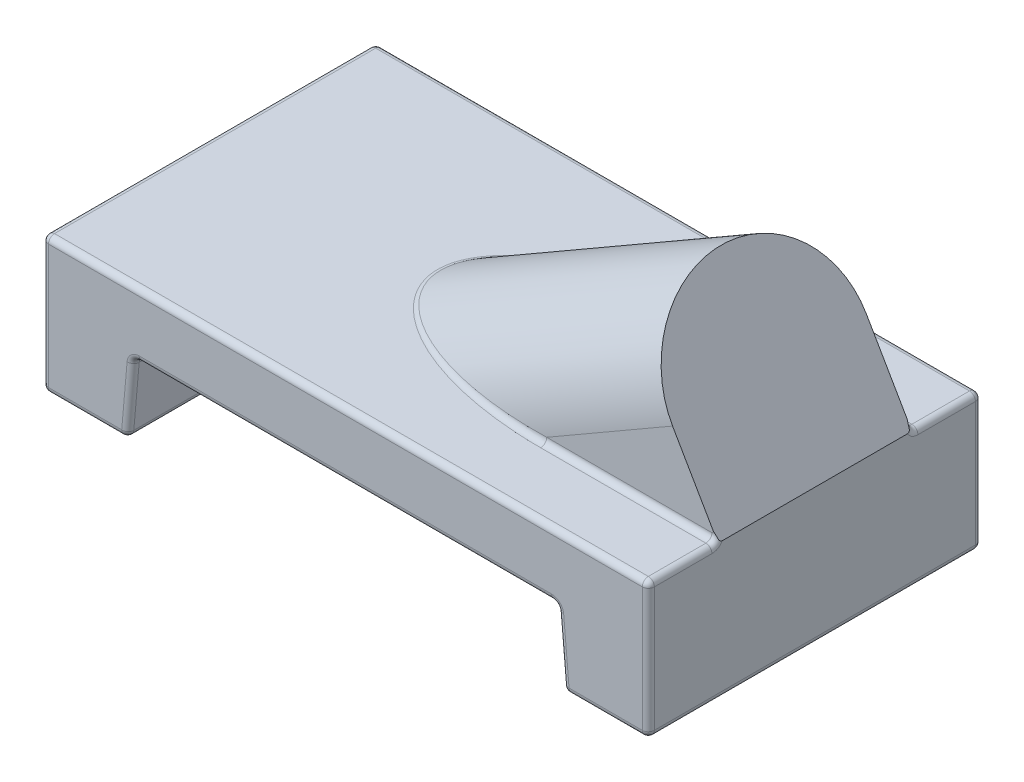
ISO-10303-21;
HEADER;
FILE_DESCRIPTION(('STEP AP214'),'2;1');
FILE_NAME('part.step','',(''),(''),'','','');
FILE_SCHEMA(('AUTOMOTIVE_DESIGN { 1 0 10303 214 1 1 1 1 }'));
ENDSEC;
DATA;
#1=APPLICATION_CONTEXT('core data for automotive mechanical design processes');
#2=APPLICATION_PROTOCOL_DEFINITION('international standard','automotive_design',2000,#1);
#3=PRODUCT_CONTEXT('',#1,'mechanical');
#4=PRODUCT('Part','Part','',(#3));
#5=PRODUCT_RELATED_PRODUCT_CATEGORY('part','',(#4));
#6=PRODUCT_DEFINITION_FORMATION('','',#4);
#7=PRODUCT_DEFINITION_CONTEXT('part definition',#1,'design');
#8=PRODUCT_DEFINITION('design','',#6,#7);
#9=PRODUCT_DEFINITION_SHAPE('','',#8);
#10=(LENGTH_UNIT() NAMED_UNIT(*) SI_UNIT(.MILLI.,.METRE.));
#11=(NAMED_UNIT(*) PLANE_ANGLE_UNIT() SI_UNIT($,.RADIAN.));
#12=(NAMED_UNIT(*) SI_UNIT($,.STERADIAN.) SOLID_ANGLE_UNIT());
#13=UNCERTAINTY_MEASURE_WITH_UNIT(LENGTH_MEASURE(1.E-05),#10,'distance_accuracy_value','');
#14=(GEOMETRIC_REPRESENTATION_CONTEXT(3) GLOBAL_UNCERTAINTY_ASSIGNED_CONTEXT((#13)) GLOBAL_UNIT_ASSIGNED_CONTEXT((#10,
#11,#12)) REPRESENTATION_CONTEXT('',''));
#15=CARTESIAN_POINT('',(0.,0.,0.));
#16=DIRECTION('',(0.,0.,1.));
#17=DIRECTION('',(1.,0.,0.));
#18=AXIS2_PLACEMENT_3D('',#15,#16,#17);
#19=CARTESIAN_POINT('',(-63.5,0.,34.925));
#20=DIRECTION('',(0.,1.,0.));
#21=DIRECTION('',(0.,0.,1.));
#22=AXIS2_PLACEMENT_3D('',#19,#20,#21);
#23=PLANE('',#22);
#24=DIRECTION('',(0.,0.,1.));
#25=VECTOR('',#24,1.);
#26=CARTESIAN_POINT('',(-62.23,0.,34.925));
#27=LINE('',#26,#25);
#28=CARTESIAN_POINT('',(-62.23,0.,33.655));
#29=VERTEX_POINT('',#28);
#30=CARTESIAN_POINT('',(-62.23,0.,-33.655));
#31=VERTEX_POINT('',#30);
#32=EDGE_CURVE('E334',#29,#31,#27,.F.);
#33=ORIENTED_EDGE('',*,*,#32,.T.);
#34=DIRECTION('',(-1.,0.,0.));
#35=VECTOR('',#34,1.);
#36=CARTESIAN_POINT('',(-63.5,0.,-33.655));
#37=LINE('',#36,#35);
#38=CARTESIAN_POINT('',(-46.8837405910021,0.,-33.655));
#39=VERTEX_POINT('',#38);
#40=EDGE_CURVE('E401',#31,#39,#37,.F.);
#41=ORIENTED_EDGE('',*,*,#40,.T.);
#42=DIRECTION('',(0.,0.,1.));
#43=VECTOR('',#42,1.);
#44=CARTESIAN_POINT('',(-46.8837405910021,0.,34.925));
#45=LINE('',#44,#43);
#46=CARTESIAN_POINT('',(-46.8837405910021,0.,33.655));
#47=VERTEX_POINT('',#46);
#48=EDGE_CURVE('E337',#39,#47,#45,.T.);
#49=ORIENTED_EDGE('',*,*,#48,.T.);
#50=DIRECTION('',(1.,0.,0.));
#51=VECTOR('',#50,1.);
#52=CARTESIAN_POINT('',(-63.5,0.,33.655));
#53=LINE('',#52,#51);
#54=EDGE_CURVE('E399',#47,#29,#53,.F.);
#55=ORIENTED_EDGE('',*,*,#54,.T.);
#56=EDGE_LOOP('',(#33,#41,#49,#55));
#57=FACE_BOUND('',#56,.T.);
#58=ADVANCED_FACE('F26',(#57),#23,.F.);
#59=CARTESIAN_POINT('',(-63.5,28.575,34.925));
#60=DIRECTION('',(0.,1.,0.));
#61=DIRECTION('',(0.,0.,1.));
#62=AXIS2_PLACEMENT_3D('',#59,#60,#61);
#63=PLANE('',#62);
#64=DIRECTION('',(1.,0.,0.));
#65=VECTOR('',#64,1.);
#66=CARTESIAN_POINT('',(63.4999999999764,28.575,-21.59));
#67=LINE('',#66,#65);
#68=CARTESIAN_POINT('',(27.5997045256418,28.575,-21.59));
#69=VERTEX_POINT('',#68);
#70=CARTESIAN_POINT('',(62.23,28.575,-21.59));
#71=VERTEX_POINT('',#70);
#72=EDGE_CURVE('E439',#69,#71,#67,.T.);
#73=ORIENTED_EDGE('',*,*,#72,.T.);
#74=DIRECTION('',(0.,0.,-1.));
#75=VECTOR('',#74,1.);
#76=CARTESIAN_POINT('',(62.23,28.575,-33.655));
#77=LINE('',#76,#75);
#78=CARTESIAN_POINT('',(62.23,28.575,-33.655));
#79=VERTEX_POINT('',#78);
#80=EDGE_CURVE('E287',#71,#79,#77,.T.);
#81=ORIENTED_EDGE('',*,*,#80,.T.);
#82=DIRECTION('',(-1.,0.,0.));
#83=VECTOR('',#82,1.);
#84=CARTESIAN_POINT('',(-62.23,28.575,-33.655));
#85=LINE('',#84,#83);
#86=CARTESIAN_POINT('',(-62.23,28.575,-33.655));
#87=VERTEX_POINT('',#86);
#88=EDGE_CURVE('E456',#79,#87,#85,.T.);
#89=ORIENTED_EDGE('',*,*,#88,.T.);
#90=DIRECTION('',(0.,0.,1.));
#91=VECTOR('',#90,1.);
#92=CARTESIAN_POINT('',(-62.23,28.575,33.655));
#93=LINE('',#92,#91);
#94=CARTESIAN_POINT('',(-62.23,28.575,33.655));
#95=VERTEX_POINT('',#94);
#96=EDGE_CURVE('E454',#87,#95,#93,.T.);
#97=ORIENTED_EDGE('',*,*,#96,.T.);
#98=DIRECTION('',(1.,0.,0.));
#99=VECTOR('',#98,1.);
#100=CARTESIAN_POINT('',(62.23,28.575,33.655));
#101=LINE('',#100,#99);
#102=CARTESIAN_POINT('',(62.23,28.575,33.655));
#103=VERTEX_POINT('',#102);
#104=EDGE_CURVE('E452',#95,#103,#101,.T.);
#105=ORIENTED_EDGE('',*,*,#104,.T.);
#106=DIRECTION('',(0.,0.,-1.));
#107=VECTOR('',#106,1.);
#108=CARTESIAN_POINT('',(62.23,28.575,21.59));
#109=LINE('',#108,#107);
#110=CARTESIAN_POINT('',(62.23,28.575,21.59));
#111=VERTEX_POINT('',#110);
#112=EDGE_CURVE('E457',#103,#111,#109,.T.);
#113=ORIENTED_EDGE('',*,*,#112,.T.);
#114=DIRECTION('',(-1.,0.,0.));
#115=VECTOR('',#114,1.);
#116=CARTESIAN_POINT('',(25.3999999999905,28.575,21.59));
#117=LINE('',#116,#115);
#118=CARTESIAN_POINT('',(27.5997045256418,28.575,21.59));
#119=VERTEX_POINT('',#118);
#120=EDGE_CURVE('E435',#111,#119,#117,.T.);
#121=ORIENTED_EDGE('',*,*,#120,.T.);
#122=CARTESIAN_POINT('',(27.5997045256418,28.575000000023,0.));
#123=DIRECTION('',(0.,1.,0.));
#124=DIRECTION('',(1.,0.,0.));
#125=AXIS2_PLACEMENT_3D('',#122,#123,#124);
#126=ELLIPSE('',#125,43.1799999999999,21.59);
#127=EDGE_CURVE('E437',#119,#69,#126,.F.);
#128=ORIENTED_EDGE('',*,*,#127,.T.);
#129=EDGE_LOOP('',(#73,#81,#89,#97,#105,#113,#121,#128));
#130=FACE_BOUND('',#129,.T.);
#131=ADVANCED_FACE('F463',(#130),#63,.T.);
#132=CARTESIAN_POINT('',(-63.5,28.575,-34.925));
#133=DIRECTION('',(1.,0.,0.));
#134=DIRECTION('',(0.,0.,-1.));
#135=AXIS2_PLACEMENT_3D('',#132,#133,#134);
#136=PLANE('',#135);
#137=DIRECTION('',(0.,-1.,0.));
#138=VECTOR('',#137,1.);
#139=CARTESIAN_POINT('',(-63.5,28.575,33.655));
#140=LINE('',#139,#138);
#141=CARTESIAN_POINT('',(-63.5,1.27,33.655));
#142=VERTEX_POINT('',#141);
#143=CARTESIAN_POINT('',(-63.5,27.305,33.655));
#144=VERTEX_POINT('',#143);
#145=EDGE_CURVE('E431',#142,#144,#140,.F.);
#146=ORIENTED_EDGE('',*,*,#145,.T.);
#147=DIRECTION('',(0.,0.,1.));
#148=VECTOR('',#147,1.);
#149=CARTESIAN_POINT('',(-63.5,27.305,-33.655));
#150=LINE('',#149,#148);
#151=CARTESIAN_POINT('',(-63.5,27.305,-33.655));
#152=VERTEX_POINT('',#151);
#153=EDGE_CURVE('E34',#144,#152,#150,.F.);
#154=ORIENTED_EDGE('',*,*,#153,.T.);
#155=DIRECTION('',(0.,-1.,0.));
#156=VECTOR('',#155,1.);
#157=CARTESIAN_POINT('',(-63.5,28.575,-33.655));
#158=LINE('',#157,#156);
#159=CARTESIAN_POINT('',(-63.5,1.27,-33.655));
#160=VERTEX_POINT('',#159);
#161=EDGE_CURVE('E433',#152,#160,#158,.T.);
#162=ORIENTED_EDGE('',*,*,#161,.T.);
#163=DIRECTION('',(0.,0.,1.));
#164=VECTOR('',#163,1.);
#165=CARTESIAN_POINT('',(-63.5,1.27,-34.925));
#166=LINE('',#165,#164);
#167=EDGE_CURVE('E340',#160,#142,#166,.T.);
#168=ORIENTED_EDGE('',*,*,#167,.T.);
#169=EDGE_LOOP('',(#146,#154,#162,#168));
#170=FACE_BOUND('',#169,.T.);
#171=ADVANCED_FACE('F28',(#170),#136,.F.);
#172=CARTESIAN_POINT('',(-63.5,28.575,34.925));
#173=DIRECTION('',(0.,0.,-1.));
#174=DIRECTION('',(-1.,0.,0.));
#175=AXIS2_PLACEMENT_3D('',#172,#173,#174);
#176=PLANE('',#175);
#177=DIRECTION('',(0.,-1.,0.));
#178=VECTOR('',#177,1.);
#179=CARTESIAN_POINT('',(62.23,28.575,34.925));
#180=LINE('',#179,#178);
#181=CARTESIAN_POINT('',(62.23,1.27,34.925));
#182=VERTEX_POINT('',#181);
#183=CARTESIAN_POINT('',(62.23,27.305,34.925));
#184=VERTEX_POINT('',#183);
#185=EDGE_CURVE('E423',#182,#184,#180,.F.);
#186=ORIENTED_EDGE('',*,*,#185,.T.);
#187=DIRECTION('',(1.,0.,0.));
#188=VECTOR('',#187,1.);
#189=CARTESIAN_POINT('',(-62.23,27.305,34.925));
#190=LINE('',#189,#188);
#191=CARTESIAN_POINT('',(-62.23,27.305,34.925));
#192=VERTEX_POINT('',#191);
#193=EDGE_CURVE('E11',#184,#192,#190,.F.);
#194=ORIENTED_EDGE('',*,*,#193,.T.);
#195=DIRECTION('',(0.,-1.,0.));
#196=VECTOR('',#195,1.);
#197=CARTESIAN_POINT('',(-62.23,28.575,34.925));
#198=LINE('',#197,#196);
#199=CARTESIAN_POINT('',(-62.23,1.27,34.925));
#200=VERTEX_POINT('',#199);
#201=EDGE_CURVE('E407',#192,#200,#198,.T.);
#202=ORIENTED_EDGE('',*,*,#201,.T.);
#203=DIRECTION('',(1.,0.,0.));
#204=VECTOR('',#203,1.);
#205=CARTESIAN_POINT('',(-63.5,1.27,34.925));
#206=LINE('',#205,#204);
#207=CARTESIAN_POINT('',(-46.8837405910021,1.27,34.925));
#208=VERTEX_POINT('',#207);
#209=EDGE_CURVE('E409',#200,#208,#206,.T.);
#210=ORIENTED_EDGE('',*,*,#209,.T.);
#211=DIRECTION('',(0.087155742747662,0.996194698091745,0.));
#212=VECTOR('',#211,1.);
#213=CARTESIAN_POINT('',(-44.6392280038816,26.9248962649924,34.925));
#214=LINE('',#213,#212);
#215=CARTESIAN_POINT('',(-45.7532667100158,14.191375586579,34.925));
#216=VERTEX_POINT('',#215);
#217=EDGE_CURVE('E411',#208,#216,#214,.T.);
#218=ORIENTED_EDGE('',*,*,#217,.T.);
#219=CARTESIAN_POINT('',(-43.2229321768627,13.97,34.925));
#220=DIRECTION('',(0.,0.,-1.));
#221=DIRECTION('',(-1.,0.,0.));
#222=AXIS2_PLACEMENT_3D('',#219,#220,#221);
#223=CIRCLE('',#222,2.54);
#224=CARTESIAN_POINT('',(-43.2229321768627,16.51,34.925));
#225=VERTEX_POINT('',#224);
#226=EDGE_CURVE('E413',#216,#225,#223,.T.);
#227=ORIENTED_EDGE('',*,*,#226,.T.);
#228=DIRECTION('',(1.,0.,0.));
#229=VECTOR('',#228,1.);
#230=CARTESIAN_POINT('',(-63.5,16.51,34.925));
#231=LINE('',#230,#229);
#232=CARTESIAN_POINT('',(43.2229321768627,16.51,34.925));
#233=VERTEX_POINT('',#232);
#234=EDGE_CURVE('E415',#225,#233,#231,.T.);
#235=ORIENTED_EDGE('',*,*,#234,.T.);
#236=CARTESIAN_POINT('',(43.2229321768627,13.97,34.925));
#237=DIRECTION('',(0.,0.,-1.));
#238=DIRECTION('',(-1.,0.,0.));
#239=AXIS2_PLACEMENT_3D('',#236,#237,#238);
#240=CIRCLE('',#239,2.54);
#241=CARTESIAN_POINT('',(45.7532667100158,14.191375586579,34.925));
#242=VERTEX_POINT('',#241);
#243=EDGE_CURVE('E417',#233,#242,#240,.T.);
#244=ORIENTED_EDGE('',*,*,#243,.T.);
#245=DIRECTION('',(0.087155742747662,-0.996194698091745,0.));
#246=VECTOR('',#245,1.);
#247=CARTESIAN_POINT('',(43.6745203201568,37.9515555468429,34.925));
#248=LINE('',#247,#246);
#249=CARTESIAN_POINT('',(46.8837405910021,1.27,34.925));
#250=VERTEX_POINT('',#249);
#251=EDGE_CURVE('E419',#242,#250,#248,.T.);
#252=ORIENTED_EDGE('',*,*,#251,.T.);
#253=DIRECTION('',(1.,0.,0.));
#254=VECTOR('',#253,1.);
#255=CARTESIAN_POINT('',(-63.5,1.27,34.925));
#256=LINE('',#255,#254);
#257=EDGE_CURVE('E421',#250,#182,#256,.T.);
#258=ORIENTED_EDGE('',*,*,#257,.T.);
#259=EDGE_LOOP('',(#186,#194,#202,#210,#218,#227,#235,#244,#252,#258));
#260=FACE_BOUND('',#259,.T.);
#261=ADVANCED_FACE('F897',(#260),#176,.F.);
#262=CARTESIAN_POINT('',(63.5,28.575,-34.925));
#263=DIRECTION('',(-1.,0.,0.));
#264=DIRECTION('',(0.,0.,1.));
#265=AXIS2_PLACEMENT_3D('',#262,#263,#264);
#266=PLANE('',#265);
#267=DIRECTION('',(0.,-1.,0.));
#268=VECTOR('',#267,1.);
#269=CARTESIAN_POINT('',(63.5,28.575,-33.655));
#270=LINE('',#269,#268);
#271=CARTESIAN_POINT('',(63.5,1.27,-33.655));
#272=VERTEX_POINT('',#271);
#273=CARTESIAN_POINT('',(63.5,27.305,-33.655));
#274=VERTEX_POINT('',#273);
#275=EDGE_CURVE('E426',#272,#274,#270,.F.);
#276=ORIENTED_EDGE('',*,*,#275,.T.);
#277=DIRECTION('',(0.,0.,-1.));
#278=VECTOR('',#277,1.);
#279=CARTESIAN_POINT('',(63.5,27.305,-21.59));
#280=LINE('',#279,#278);
#281=CARTESIAN_POINT('',(63.5,27.305,-21.59));
#282=VERTEX_POINT('',#281);
#283=EDGE_CURVE('E295',#274,#282,#280,.F.);
#284=ORIENTED_EDGE('',*,*,#283,.T.);
#285=CARTESIAN_POINT('',(63.5,29.845,-21.59));
#286=DIRECTION('',(-1.,0.,0.));
#287=DIRECTION('',(0.,0.,1.));
#288=AXIS2_PLACEMENT_3D('',#285,#286,#287);
#289=CIRCLE('',#288,2.54);
#290=CARTESIAN_POINT('',(63.5,28.575,-19.3902954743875));
#291=VERTEX_POINT('',#290);
#292=EDGE_CURVE('E293',#282,#291,#289,.T.);
#293=ORIENTED_EDGE('',*,*,#292,.T.);
#294=DIRECTION('',(0.,0.,-1.));
#295=VECTOR('',#294,1.);
#296=CARTESIAN_POINT('',(63.5,28.575,20.32));
#297=LINE('',#296,#295);
#298=CARTESIAN_POINT('',(63.5,28.575,19.3902954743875));
#299=VERTEX_POINT('',#298);
#300=EDGE_CURVE('E274',#299,#291,#297,.T.);
#301=ORIENTED_EDGE('',*,*,#300,.F.);
#302=CARTESIAN_POINT('',(63.5,29.845,21.59));
#303=DIRECTION('',(-1.,0.,0.));
#304=DIRECTION('',(0.,0.,1.));
#305=AXIS2_PLACEMENT_3D('',#302,#303,#304);
#306=CIRCLE('',#305,2.54);
#307=CARTESIAN_POINT('',(63.5,27.305,21.59));
#308=VERTEX_POINT('',#307);
#309=EDGE_CURVE('E291',#299,#308,#306,.T.);
#310=ORIENTED_EDGE('',*,*,#309,.T.);
#311=DIRECTION('',(0.,0.,-1.));
#312=VECTOR('',#311,1.);
#313=CARTESIAN_POINT('',(63.5,27.305,33.655));
#314=LINE('',#313,#312);
#315=CARTESIAN_POINT('',(63.5,27.305,33.655));
#316=VERTEX_POINT('',#315);
#317=EDGE_CURVE('E289',#308,#316,#314,.F.);
#318=ORIENTED_EDGE('',*,*,#317,.T.);
#319=DIRECTION('',(0.,-1.,0.));
#320=VECTOR('',#319,1.);
#321=CARTESIAN_POINT('',(63.5,28.575,33.655));
#322=LINE('',#321,#320);
#323=CARTESIAN_POINT('',(63.5,1.27,33.655));
#324=VERTEX_POINT('',#323);
#325=EDGE_CURVE('E429',#316,#324,#322,.T.);
#326=ORIENTED_EDGE('',*,*,#325,.T.);
#327=DIRECTION('',(0.,0.,-1.));
#328=VECTOR('',#327,1.);
#329=CARTESIAN_POINT('',(63.5,1.27,-34.925));
#330=LINE('',#329,#328);
#331=EDGE_CURVE('E280',#324,#272,#330,.T.);
#332=ORIENTED_EDGE('',*,*,#331,.T.);
#333=EDGE_LOOP('',(#276,#284,#293,#301,#310,#318,#326,#332));
#334=FACE_BOUND('',#333,.T.);
#335=ADVANCED_FACE('F679',(#334),#266,.F.);
#336=CARTESIAN_POINT('',(-63.5,28.575,-34.925));
#337=DIRECTION('',(0.,0.,1.));
#338=DIRECTION('',(1.,0.,0.));
#339=AXIS2_PLACEMENT_3D('',#336,#337,#338);
#340=PLANE('',#339);
#341=DIRECTION('',(0.,-1.,0.));
#342=VECTOR('',#341,1.);
#343=CARTESIAN_POINT('',(-62.23,28.575,-34.925));
#344=LINE('',#343,#342);
#345=CARTESIAN_POINT('',(-62.23,1.27,-34.925));
#346=VERTEX_POINT('',#345);
#347=CARTESIAN_POINT('',(-62.23,27.305,-34.925));
#348=VERTEX_POINT('',#347);
#349=EDGE_CURVE('E349',#346,#348,#344,.F.);
#350=ORIENTED_EDGE('',*,*,#349,.T.);
#351=DIRECTION('',(-1.,0.,0.));
#352=VECTOR('',#351,1.);
#353=CARTESIAN_POINT('',(62.23,27.305,-34.925));
#354=LINE('',#353,#352);
#355=CARTESIAN_POINT('',(62.23,27.305,-34.925));
#356=VERTEX_POINT('',#355);
#357=EDGE_CURVE('E598',#348,#356,#354,.F.);
#358=ORIENTED_EDGE('',*,*,#357,.T.);
#359=DIRECTION('',(0.,-1.,0.));
#360=VECTOR('',#359,1.);
#361=CARTESIAN_POINT('',(62.23,28.575,-34.925));
#362=LINE('',#361,#360);
#363=CARTESIAN_POINT('',(62.23,1.27,-34.925));
#364=VERTEX_POINT('',#363);
#365=EDGE_CURVE('E365',#356,#364,#362,.T.);
#366=ORIENTED_EDGE('',*,*,#365,.T.);
#367=DIRECTION('',(-1.,0.,0.));
#368=VECTOR('',#367,1.);
#369=CARTESIAN_POINT('',(-63.5,1.27,-34.925));
#370=LINE('',#369,#368);
#371=CARTESIAN_POINT('',(46.8837405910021,1.27,-34.925));
#372=VERTEX_POINT('',#371);
#373=EDGE_CURVE('E363',#364,#372,#370,.T.);
#374=ORIENTED_EDGE('',*,*,#373,.T.);
#375=DIRECTION('',(-0.087155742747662,0.996194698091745,0.));
#376=VECTOR('',#375,1.);
#377=CARTESIAN_POINT('',(43.6745203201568,37.9515555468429,-34.925));
#378=LINE('',#377,#376);
#379=CARTESIAN_POINT('',(45.7532667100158,14.191375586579,-34.925));
#380=VERTEX_POINT('',#379);
#381=EDGE_CURVE('E361',#372,#380,#378,.T.);
#382=ORIENTED_EDGE('',*,*,#381,.T.);
#383=CARTESIAN_POINT('',(43.2229321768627,13.97,-34.925));
#384=DIRECTION('',(0.,0.,1.));
#385=DIRECTION('',(1.,0.,0.));
#386=AXIS2_PLACEMENT_3D('',#383,#384,#385);
#387=CIRCLE('',#386,2.54);
#388=CARTESIAN_POINT('',(43.2229321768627,16.51,-34.925));
#389=VERTEX_POINT('',#388);
#390=EDGE_CURVE('E359',#380,#389,#387,.T.);
#391=ORIENTED_EDGE('',*,*,#390,.T.);
#392=DIRECTION('',(-1.,0.,0.));
#393=VECTOR('',#392,1.);
#394=CARTESIAN_POINT('',(-63.5,16.51,-34.925));
#395=LINE('',#394,#393);
#396=CARTESIAN_POINT('',(-43.2229321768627,16.51,-34.925));
#397=VERTEX_POINT('',#396);
#398=EDGE_CURVE('E357',#389,#397,#395,.T.);
#399=ORIENTED_EDGE('',*,*,#398,.T.);
#400=CARTESIAN_POINT('',(-43.2229321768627,13.97,-34.925));
#401=DIRECTION('',(0.,0.,1.));
#402=DIRECTION('',(1.,0.,0.));
#403=AXIS2_PLACEMENT_3D('',#400,#401,#402);
#404=CIRCLE('',#403,2.54);
#405=CARTESIAN_POINT('',(-45.7532667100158,14.191375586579,-34.925));
#406=VERTEX_POINT('',#405);
#407=EDGE_CURVE('E355',#397,#406,#404,.T.);
#408=ORIENTED_EDGE('',*,*,#407,.T.);
#409=DIRECTION('',(-0.087155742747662,-0.996194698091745,0.));
#410=VECTOR('',#409,1.);
#411=CARTESIAN_POINT('',(-44.6392280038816,26.9248962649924,-34.925));
#412=LINE('',#411,#410);
#413=CARTESIAN_POINT('',(-46.8837405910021,1.27,-34.925));
#414=VERTEX_POINT('',#413);
#415=EDGE_CURVE('E353',#406,#414,#412,.T.);
#416=ORIENTED_EDGE('',*,*,#415,.T.);
#417=DIRECTION('',(-1.,0.,0.));
#418=VECTOR('',#417,1.);
#419=CARTESIAN_POINT('',(-63.5,1.27,-34.925));
#420=LINE('',#419,#418);
#421=EDGE_CURVE('E351',#414,#346,#420,.T.);
#422=ORIENTED_EDGE('',*,*,#421,.T.);
#423=EDGE_LOOP('',(#350,#358,#366,#374,#382,#391,#399,#408,#416,#422));
#424=FACE_BOUND('',#423,.T.);
#425=ADVANCED_FACE('F601',(#424),#340,.F.);
#426=DIRECTION('',(0.,0.,-1.));
#427=VECTOR('',#426,1.);
#428=CARTESIAN_POINT('',(46.8837405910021,0.,34.925));
#429=LINE('',#428,#427);
#430=CARTESIAN_POINT('',(46.8837405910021,0.,33.655));
#431=VERTEX_POINT('',#430);
#432=CARTESIAN_POINT('',(46.8837405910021,0.,-33.655));
#433=VERTEX_POINT('',#432);
#434=EDGE_CURVE('E310',#431,#433,#429,.T.);
#435=ORIENTED_EDGE('',*,*,#434,.T.);
#436=DIRECTION('',(-1.,0.,0.));
#437=VECTOR('',#436,1.);
#438=CARTESIAN_POINT('',(-63.5,0.,-33.655));
#439=LINE('',#438,#437);
#440=CARTESIAN_POINT('',(62.23,0.,-33.655));
#441=VERTEX_POINT('',#440);
#442=EDGE_CURVE('E369',#433,#441,#439,.F.);
#443=ORIENTED_EDGE('',*,*,#442,.T.);
#444=DIRECTION('',(0.,0.,-1.));
#445=VECTOR('',#444,1.);
#446=CARTESIAN_POINT('',(62.23,0.,34.925));
#447=LINE('',#446,#445);
#448=CARTESIAN_POINT('',(62.23,0.,33.655));
#449=VERTEX_POINT('',#448);
#450=EDGE_CURVE('E313',#441,#449,#447,.F.);
#451=ORIENTED_EDGE('',*,*,#450,.T.);
#452=DIRECTION('',(1.,0.,0.));
#453=VECTOR('',#452,1.);
#454=CARTESIAN_POINT('',(-63.5,0.,33.655));
#455=LINE('',#454,#453);
#456=EDGE_CURVE('E367',#449,#431,#455,.F.);
#457=ORIENTED_EDGE('',*,*,#456,.T.);
#458=EDGE_LOOP('',(#435,#443,#451,#457));
#459=FACE_BOUND('',#458,.T.);
#460=ADVANCED_FACE('F542',(#459),#23,.F.);
#461=CARTESIAN_POINT('',(-500000.,-288683.221336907,20.3200000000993));
#462=DIRECTION('',(0.,0.,1.));
#463=DIRECTION('',(1.,0.,0.));
#464=AXIS2_PLACEMENT_3D('',#461,#462,#463);
#465=PLANE('',#464);
#466=DIRECTION('',(-1.,0.,0.));
#467=VECTOR('',#466,1.);
#468=CARTESIAN_POINT('',(63.4999999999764,29.845,20.32));
#469=LINE('',#468,#467);
#470=CARTESIAN_POINT('',(27.5997045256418,29.845000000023,20.32));
#471=VERTEX_POINT('',#470);
#472=CARTESIAN_POINT('',(62.23,29.845,20.32));
#473=VERTEX_POINT('',#472);
#474=EDGE_CURVE('E445',#471,#473,#469,.F.);
#475=ORIENTED_EDGE('',*,*,#474,.T.);
#476=CARTESIAN_POINT('',(62.5680431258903,30.189196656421,20.32));
#477=CARTESIAN_POINT('',(62.5135539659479,30.1316761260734,20.32));
#478=CARTESIAN_POINT('',(62.4583097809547,30.0748938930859,20.32));
#479=CARTESIAN_POINT('',(62.3470601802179,29.9620835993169,20.32));
#480=CARTESIAN_POINT('',(62.2910548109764,29.9060554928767,20.32));
#481=CARTESIAN_POINT('',(62.2333598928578,29.8483598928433,20.32));
#482=CARTESIAN_POINT('',(62.2316799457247,29.8466799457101,20.32));
#483=CARTESIAN_POINT('',(62.23,29.845,20.32));
#484=B_SPLINE_CURVE_WITH_KNOTS('',3,(#476,#477,#478,#479,#480,#481,#482,#483),.UNSPECIFIED.,.F.,
.F.,(4,2,2,4),(0.,0.237667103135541,0.47531975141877,0.482447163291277),.UNSPECIFIED.);
#485=CARTESIAN_POINT('',(62.5680431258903,30.189196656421,20.32));
#486=VERTEX_POINT('',#485);
#487=EDGE_CURVE('E264',#473,#486,#484,.F.);
#488=ORIENTED_EDGE('',*,*,#487,.T.);
#489=DIRECTION('',(0.500000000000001,-0.866025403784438,0.));
#490=VECTOR('',#489,1.);
#491=CARTESIAN_POINT('',(63.5,28.575,20.32));
#492=LINE('',#491,#490);
#493=CARTESIAN_POINT('',(53.975,45.0727839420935,20.32));
#494=VERTEX_POINT('',#493);
#495=EDGE_CURVE('E259',#494,#486,#492,.T.);
#496=ORIENTED_EDGE('',*,*,#495,.F.);
#497=DIRECTION('',(0.866025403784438,0.500000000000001,0.));
#498=VECTOR('',#497,1.);
#499=CARTESIAN_POINT('',(-500009.525,-288666.723552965,20.3200000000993));
#500=LINE('',#499,#498);
#501=EDGE_CURVE('E247',#471,#494,#500,.T.);
#502=ORIENTED_EDGE('',*,*,#501,.F.);
#503=EDGE_LOOP('',(#475,#488,#496,#502));
#504=FACE_BOUND('',#503,.T.);
#505=ADVANCED_FACE('F262',(#504),#465,.T.);
#506=CARTESIAN_POINT('',(-500009.525,-288666.723552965,9.93407713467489E-11));
#507=DIRECTION('',(0.866025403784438,0.500000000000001,0.));
#508=DIRECTION('',(-0.500000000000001,0.866025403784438,0.));
#509=AXIS2_PLACEMENT_3D('',#506,#507,#508);
#510=CYLINDRICAL_SURFACE('',#509,20.32);
#511=DIRECTION('',(0.866025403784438,0.500000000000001,0.));
#512=VECTOR('',#511,1.);
#513=CARTESIAN_POINT('',(-500009.525,-288666.723552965,-20.3199999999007));
#514=LINE('',#513,#512);
#515=CARTESIAN_POINT('',(27.5997045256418,29.845000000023,-20.32));
#516=VERTEX_POINT('',#515);
#517=CARTESIAN_POINT('',(53.975,45.0727839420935,-20.32));
#518=VERTEX_POINT('',#517);
#519=EDGE_CURVE('E258',#516,#518,#514,.T.);
#520=ORIENTED_EDGE('',*,*,#519,.F.);
#521=CARTESIAN_POINT('',(27.5997045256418,29.845000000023,0.));
#522=DIRECTION('',(0.0258428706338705,-0.999666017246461,0.));
#523=DIRECTION('',(0.999666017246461,0.0258428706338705,0.));
#524=AXIS2_PLACEMENT_3D('',#521,#522,#523);
#525=ELLIPSE('',#524,42.5592140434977,20.32);
#526=EDGE_CURVE('E254',#516,#471,#525,.F.);
#527=ORIENTED_EDGE('',*,*,#526,.T.);
#528=ORIENTED_EDGE('',*,*,#501,.T.);
#529=CARTESIAN_POINT('',(53.975,45.0727839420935,0.));
#530=DIRECTION('',(0.866025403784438,0.500000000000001,0.));
#531=DIRECTION('',(0.500000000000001,-0.866025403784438,0.));
#532=AXIS2_PLACEMENT_3D('',#529,#530,#531);
#533=CIRCLE('',#532,20.32);
#534=EDGE_CURVE('E252',#518,#494,#533,.T.);
#535=ORIENTED_EDGE('',*,*,#534,.F.);
#536=EDGE_LOOP('',(#520,#527,#528,#535));
#537=FACE_BOUND('',#536,.T.);
#538=ADVANCED_FACE('F250',(#537),#510,.T.);
#539=CARTESIAN_POINT('',(-500009.525,-288666.723552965,-20.3199999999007));
#540=DIRECTION('',(0.,0.,-1.));
#541=DIRECTION('',(-1.,0.,0.));
#542=AXIS2_PLACEMENT_3D('',#539,#540,#541);
#543=PLANE('',#542);
#544=DIRECTION('',(-0.500000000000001,0.866025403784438,0.));
#545=VECTOR('',#544,1.);
#546=CARTESIAN_POINT('',(53.975,45.0727839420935,-20.32));
#547=LINE('',#546,#545);
#548=CARTESIAN_POINT('',(62.5680431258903,30.189196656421,-20.32));
#549=VERTEX_POINT('',#548);
#550=EDGE_CURVE('E271',#549,#518,#547,.T.);
#551=ORIENTED_EDGE('',*,*,#550,.F.);
#552=CARTESIAN_POINT('',(62.5680431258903,30.189196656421,-20.32));
#553=CARTESIAN_POINT('',(62.5135539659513,30.1316761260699,-20.32));
#554=CARTESIAN_POINT('',(62.4583097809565,30.0748938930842,-20.32));
#555=CARTESIAN_POINT('',(62.3470601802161,29.9620835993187,-20.32));
#556=CARTESIAN_POINT('',(62.2910548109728,29.9060554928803,-20.32));
#557=CARTESIAN_POINT('',(62.2333598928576,29.8483598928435,-20.32));
#558=CARTESIAN_POINT('',(62.2316799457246,29.8466799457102,-20.32));
#559=CARTESIAN_POINT('',(62.23,29.845,-20.32));
#560=B_SPLINE_CURVE_WITH_KNOTS('',3,(#552,#553,#554,#555,#556,#557,#558,#559),.UNSPECIFIED.,.F.,
.F.,(4,2,2,4),(0.,0.237667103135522,0.475319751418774,0.482447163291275),.UNSPECIFIED.);
#561=CARTESIAN_POINT('',(62.23,29.845,-20.32));
#562=VERTEX_POINT('',#561);
#563=EDGE_CURVE('E544',#549,#562,#560,.T.);
#564=ORIENTED_EDGE('',*,*,#563,.T.);
#565=DIRECTION('',(1.,0.,0.));
#566=VECTOR('',#565,1.);
#567=CARTESIAN_POINT('',(25.3999999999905,29.845,-20.32));
#568=LINE('',#567,#566);
#569=EDGE_CURVE('E442',#562,#516,#568,.F.);
#570=ORIENTED_EDGE('',*,*,#569,.T.);
#571=ORIENTED_EDGE('',*,*,#519,.T.);
#572=EDGE_LOOP('',(#551,#564,#570,#571));
#573=FACE_BOUND('',#572,.T.);
#574=ADVANCED_FACE('F537',(#573),#543,.T.);
#575=CARTESIAN_POINT('',(53.975,45.0727839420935,0.));
#576=DIRECTION('',(-0.866025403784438,-0.500000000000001,0.));
#577=DIRECTION('',(0.500000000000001,-0.866025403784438,0.));
#578=AXIS2_PLACEMENT_3D('',#575,#576,#577);
#579=PLANE('',#578);
#580=ORIENTED_EDGE('',*,*,#300,.T.);
#581=CARTESIAN_POINT('',(63.5,28.575,-19.3902954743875));
#582=CARTESIAN_POINT('',(63.5000080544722,28.5749860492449,-19.4269551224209));
#583=CARTESIAN_POINT('',(63.4988089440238,28.5770629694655,-19.4637778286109));
#584=CARTESIAN_POINT('',(63.4936061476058,28.5860744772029,-19.5368703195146));
#585=CARTESIAN_POINT('',(63.4895822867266,28.5930440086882,-19.5731341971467));
#586=CARTESIAN_POINT('',(63.4791947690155,28.6110357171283,-19.6382395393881));
#587=CARTESIAN_POINT('',(63.4732865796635,28.6212690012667,-19.6673643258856));
#588=CARTESIAN_POINT('',(63.4591087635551,28.6458256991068,-19.7231141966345));
#589=CARTESIAN_POINT('',(63.450847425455,28.6601347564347,-19.7497476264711));
#590=CARTESIAN_POINT('',(63.4320862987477,28.6926299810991,-19.7997589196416));
#591=CARTESIAN_POINT('',(63.4215807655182,28.710826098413,-19.8231281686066));
#592=CARTESIAN_POINT('',(63.3987667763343,28.750341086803,-19.8659990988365));
#593=CARTESIAN_POINT('',(63.3864574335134,28.7716614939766,-19.8854988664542));
#594=CARTESIAN_POINT('',(63.354818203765,28.8264622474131,-19.9285074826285));
#595=CARTESIAN_POINT('',(63.3347955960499,28.8611424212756,-19.9499597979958));
#596=CARTESIAN_POINT('',(63.3037438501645,28.914925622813,-19.9774787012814));
#597=CARTESIAN_POINT('',(63.2931884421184,28.9332081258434,-19.9858943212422));
#598=CARTESIAN_POINT('',(63.2718441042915,28.9701776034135,-20.0014251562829));
#599=CARTESIAN_POINT('',(63.2610553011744,28.9888643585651,-20.0085410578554));
#600=CARTESIAN_POINT('',(63.2264608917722,29.0487836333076,-20.0295378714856));
#601=CARTESIAN_POINT('',(63.2023636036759,29.090521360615,-20.0414564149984));
#602=CARTESIAN_POINT('',(63.1538609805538,29.1745303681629,-20.0625138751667));
#603=CARTESIAN_POINT('',(63.1294552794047,29.2168022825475,-20.0716490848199));
#604=CARTESIAN_POINT('',(63.0804512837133,29.3016796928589,-20.0886804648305));
#605=CARTESIAN_POINT('',(63.0558526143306,29.3442858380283,-20.096572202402));
#606=CARTESIAN_POINT('',(63.006639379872,29.4295256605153,-20.1121642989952));
#607=CARTESIAN_POINT('',(62.9820248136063,29.4721593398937,-20.119864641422));
#608=CARTESIAN_POINT('',(62.9328902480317,29.5572629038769,-20.1358406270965));
#609=CARTESIAN_POINT('',(62.9083701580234,29.5997329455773,-20.1441150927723));
#610=CARTESIAN_POINT('',(62.8594362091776,29.6844890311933,-20.1618281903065));
#611=CARTESIAN_POINT('',(62.8350223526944,29.7267750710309,-20.171266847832));
#612=CARTESIAN_POINT('',(62.762133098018,29.8530229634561,-20.2019862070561));
#613=CARTESIAN_POINT('',(62.7138909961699,29.9365807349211,-20.2257040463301));
#614=CARTESIAN_POINT('',(62.6497978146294,30.0475933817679,-20.2637958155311));
#615=CARTESIAN_POINT('',(62.6333466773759,30.0760875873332,-20.2741716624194));
#616=CARTESIAN_POINT('',(62.6005719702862,30.1328550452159,-20.2961498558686));
#617=CARTESIAN_POINT('',(62.5842492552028,30.1611268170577,-20.3077572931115));
#618=CARTESIAN_POINT('',(62.5680431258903,30.189196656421,-20.32));
#619=B_SPLINE_CURVE_WITH_KNOTS('',3,(#581,#582,#583,#584,#585,#586,#587,#588,#589,#590,#591,
#592,#593,#594,#595,#596,#597,#598,#599,#600,#601,#602,#603,#604,#605,#606,#607,#608,#609,#610,
#611,#612,#613,#614,#615,#616,#617,#618),.UNSPECIFIED.,.F.,.F.,(4,2,2,2,2,2,2,2,2,2,2,2,2,2,2,2,
2,2,4),(0.,0.110157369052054,0.221109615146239,0.314984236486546,0.408532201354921,
0.502322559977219,0.596159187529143,0.73160605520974,0.799764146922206,0.867886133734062,
1.01664206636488,1.16559526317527,1.31506799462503,1.4645536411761,1.61374126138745,
1.76293217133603,2.06059359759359,2.16407275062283,2.26799764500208),.UNSPECIFIED.);
#620=EDGE_CURVE('E551',#291,#549,#619,.T.);
#621=ORIENTED_EDGE('',*,*,#620,.T.);
#622=ORIENTED_EDGE('',*,*,#550,.T.);
#623=ORIENTED_EDGE('',*,*,#534,.T.);
#624=ORIENTED_EDGE('',*,*,#495,.T.);
#625=CARTESIAN_POINT('',(62.5680431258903,30.189196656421,20.32));
#626=CARTESIAN_POINT('',(62.5970888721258,30.1388879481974,20.2980421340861));
#627=CARTESIAN_POINT('',(62.6265035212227,30.0879402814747,20.2781584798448));
#628=CARTESIAN_POINT('',(62.6858332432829,29.9851781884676,20.2420145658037));
#629=CARTESIAN_POINT('',(62.715747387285,29.9333653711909,20.2257482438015));
#630=CARTESIAN_POINT('',(62.7755370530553,29.8298066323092,20.1964401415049));
#631=CARTESIAN_POINT('',(62.8054077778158,29.7780690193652,20.1833582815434));
#632=CARTESIAN_POINT('',(62.8653797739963,29.6741944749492,20.1594288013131));
#633=CARTESIAN_POINT('',(62.8954811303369,29.6220573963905,20.1485820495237));
#634=CARTESIAN_POINT('',(62.9602194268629,29.5099273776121,20.1267029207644));
#635=CARTESIAN_POINT('',(62.9948730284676,29.4499055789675,20.1158773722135));
#636=CARTESIAN_POINT('',(63.0643600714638,29.3295504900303,20.0938914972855));
#637=CARTESIAN_POINT('',(63.0991934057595,29.2692173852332,20.0827296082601));
#638=CARTESIAN_POINT('',(63.1513793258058,29.1788287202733,20.0632085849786));
#639=CARTESIAN_POINT('',(63.1688475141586,29.14857293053,20.0561981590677));
#640=CARTESIAN_POINT('',(63.2036054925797,29.0883703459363,20.0406106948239));
#641=CARTESIAN_POINT('',(63.2208951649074,29.0584237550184,20.0320326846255));
#642=CARTESIAN_POINT('',(63.2720929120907,28.9697466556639,20.0028975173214));
#643=CARTESIAN_POINT('',(63.3056313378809,28.9116563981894,19.9788533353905));
#644=CARTESIAN_POINT('',(63.3519169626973,28.8314873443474,19.9309438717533));
#645=CARTESIAN_POINT('',(63.3663182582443,28.8065435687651,19.913641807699));
#646=CARTESIAN_POINT('',(63.3935522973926,28.759372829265,19.8746242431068));
#647=CARTESIAN_POINT('',(63.4063867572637,28.7371428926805,19.8529136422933));
#648=CARTESIAN_POINT('',(63.4299513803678,28.696327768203,19.8049383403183));
#649=CARTESIAN_POINT('',(63.4406638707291,28.6777731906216,19.7786385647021));
#650=CARTESIAN_POINT('',(63.4594075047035,28.6453082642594,19.7224439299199));
#651=CARTESIAN_POINT('',(63.4674366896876,28.6314013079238,19.6925464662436));
#652=CARTESIAN_POINT('',(63.4800767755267,28.6095080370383,19.6334865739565));
#653=CARTESIAN_POINT('',(63.4849459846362,28.6010743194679,19.6045404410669));
#654=CARTESIAN_POINT('',(63.492588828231,28.5878365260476,19.5455828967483));
#655=CARTESIAN_POINT('',(63.4953616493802,28.5830338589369,19.5155710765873));
#656=CARTESIAN_POINT('',(63.4991086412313,28.5765438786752,19.4537925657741));
#657=CARTESIAN_POINT('',(63.5000013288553,28.574997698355,19.4220055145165));
#658=CARTESIAN_POINT('',(63.5000000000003,28.5749999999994,19.3902954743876));
#659=B_SPLINE_CURVE_WITH_KNOTS('',3,(#625,#626,#627,#628,#629,#630,#631,#632,#633,#634,#635,
#636,#637,#638,#639,#640,#641,#642,#643,#644,#645,#646,#647,#648,#649,#650,#651,#652,#653,#654,
#655,#656,#657,#658),.UNSPECIFIED.,.F.,.F.,(4,2,2,2,2,2,2,2,2,2,2,2,2,2,2,2,4),(0.,
0.186207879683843,0.372101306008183,0.555517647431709,0.739005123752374,0.949448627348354,
1.16109777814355,1.26795160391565,1.37487190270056,1.58688696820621,1.68734099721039,
1.78768398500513,1.88883045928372,1.99005060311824,2.08132762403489,2.17264003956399,
2.26783467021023),.UNSPECIFIED.);
#660=EDGE_CURVE('E296',#486,#299,#659,.T.);
#661=ORIENTED_EDGE('',*,*,#660,.T.);
#662=EDGE_LOOP('',(#580,#621,#622,#623,#624,#661));
#663=FACE_BOUND('',#662,.T.);
#664=ADVANCED_FACE('F269',(#663),#579,.F.);
#665=CARTESIAN_POINT('',(-44.3866727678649,15.24,-34.925025));
#666=DIRECTION('',(0.,1.,0.));
#667=DIRECTION('',(0.,0.,1.));
#668=AXIS2_PLACEMENT_3D('',#665,#666,#667);
#669=PLANE('',#668);
#670=DIRECTION('',(0.,0.,1.));
#671=VECTOR('',#670,1.);
#672=CARTESIAN_POINT('',(-43.2229321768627,15.24,-34.925));
#673=LINE('',#672,#671);
#674=CARTESIAN_POINT('',(-43.2229321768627,15.24,33.655));
#675=VERTEX_POINT('',#674);
#676=CARTESIAN_POINT('',(-43.2229321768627,15.24,-33.655));
#677=VERTEX_POINT('',#676);
#678=EDGE_CURVE('E322',#675,#677,#673,.F.);
#679=ORIENTED_EDGE('',*,*,#678,.T.);
#680=DIRECTION('',(-1.,0.,0.));
#681=VECTOR('',#680,1.);
#682=CARTESIAN_POINT('',(-44.3866727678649,15.24,-33.655));
#683=LINE('',#682,#681);
#684=CARTESIAN_POINT('',(43.2229321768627,15.24,-33.655));
#685=VERTEX_POINT('',#684);
#686=EDGE_CURVE('E385',#677,#685,#683,.F.);
#687=ORIENTED_EDGE('',*,*,#686,.T.);
#688=DIRECTION('',(0.,0.,1.));
#689=VECTOR('',#688,1.);
#690=CARTESIAN_POINT('',(43.2229321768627,15.24,34.925));
#691=LINE('',#690,#689);
#692=CARTESIAN_POINT('',(43.2229321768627,15.24,33.655));
#693=VERTEX_POINT('',#692);
#694=EDGE_CURVE('E325',#685,#693,#691,.T.);
#695=ORIENTED_EDGE('',*,*,#694,.T.);
#696=DIRECTION('',(1.,0.,0.));
#697=VECTOR('',#696,1.);
#698=CARTESIAN_POINT('',(-44.3866727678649,15.24,33.655));
#699=LINE('',#698,#697);
#700=EDGE_CURVE('E383',#693,#675,#699,.F.);
#701=ORIENTED_EDGE('',*,*,#700,.T.);
#702=EDGE_LOOP('',(#679,#687,#695,#701));
#703=FACE_BOUND('',#702,.T.);
#704=ADVANCED_FACE('F677',(#703),#669,.F.);
#705=CARTESIAN_POINT('',(-45.72,0.,-34.925025));
#706=DIRECTION('',(-0.996194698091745,0.087155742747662,0.));
#707=DIRECTION('',(-0.087155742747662,-0.996194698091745,0.));
#708=AXIS2_PLACEMENT_3D('',#705,#706,#707);
#709=PLANE('',#708);
#710=DIRECTION('',(0.,0.,1.));
#711=VECTOR('',#710,1.);
#712=CARTESIAN_POINT('',(-45.6185733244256,1.15931220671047,-34.925025));
#713=LINE('',#712,#711);
#714=CARTESIAN_POINT('',(-45.6185733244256,1.15931220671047,33.655));
#715=VERTEX_POINT('',#714);
#716=CARTESIAN_POINT('',(-45.6185733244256,1.15931220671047,-33.655));
#717=VERTEX_POINT('',#716);
#718=EDGE_CURVE('E328',#715,#717,#713,.F.);
#719=ORIENTED_EDGE('',*,*,#718,.T.);
#720=DIRECTION('',(-0.087155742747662,-0.996194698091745,0.));
#721=VECTOR('',#720,1.);
#722=CARTESIAN_POINT('',(-45.72,0.,-33.655));
#723=LINE('',#722,#721);
#724=CARTESIAN_POINT('',(-44.4880994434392,14.0806877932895,-33.655));
#725=VERTEX_POINT('',#724);
#726=EDGE_CURVE('E393',#717,#725,#723,.F.);
#727=ORIENTED_EDGE('',*,*,#726,.T.);
#728=DIRECTION('',(0.,0.,1.));
#729=VECTOR('',#728,1.);
#730=CARTESIAN_POINT('',(-44.4880994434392,14.0806877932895,34.925));
#731=LINE('',#730,#729);
#732=CARTESIAN_POINT('',(-44.4880994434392,14.0806877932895,33.655));
#733=VERTEX_POINT('',#732);
#734=EDGE_CURVE('E331',#725,#733,#731,.T.);
#735=ORIENTED_EDGE('',*,*,#734,.T.);
#736=DIRECTION('',(0.087155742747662,0.996194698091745,0.));
#737=VECTOR('',#736,1.);
#738=CARTESIAN_POINT('',(-45.72,0.,33.655));
#739=LINE('',#738,#737);
#740=EDGE_CURVE('E391',#733,#715,#739,.F.);
#741=ORIENTED_EDGE('',*,*,#740,.T.);
#742=EDGE_LOOP('',(#719,#727,#735,#741));
#743=FACE_BOUND('',#742,.T.);
#744=ADVANCED_FACE('F684',(#743),#709,.F.);
#745=CARTESIAN_POINT('',(44.3866727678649,15.24,-34.925025));
#746=DIRECTION('',(0.996194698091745,0.087155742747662,0.));
#747=DIRECTION('',(-0.087155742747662,0.996194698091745,0.));
#748=AXIS2_PLACEMENT_3D('',#745,#746,#747);
#749=PLANE('',#748);
#750=DIRECTION('',(0.,0.,1.));
#751=VECTOR('',#750,1.);
#752=CARTESIAN_POINT('',(44.4880994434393,14.0806877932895,-34.925));
#753=LINE('',#752,#751);
#754=CARTESIAN_POINT('',(44.4880994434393,14.0806877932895,33.655));
#755=VERTEX_POINT('',#754);
#756=CARTESIAN_POINT('',(44.4880994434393,14.0806877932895,-33.655));
#757=VERTEX_POINT('',#756);
#758=EDGE_CURVE('E316',#755,#757,#753,.F.);
#759=ORIENTED_EDGE('',*,*,#758,.T.);
#760=DIRECTION('',(-0.087155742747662,0.996194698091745,0.));
#761=VECTOR('',#760,1.);
#762=CARTESIAN_POINT('',(44.3866727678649,15.24,-33.655));
#763=LINE('',#762,#761);
#764=CARTESIAN_POINT('',(45.6185733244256,1.15931220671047,-33.655));
#765=VERTEX_POINT('',#764);
#766=EDGE_CURVE('E377',#757,#765,#763,.F.);
#767=ORIENTED_EDGE('',*,*,#766,.T.);
#768=DIRECTION('',(0.,0.,-1.));
#769=VECTOR('',#768,1.);
#770=CARTESIAN_POINT('',(45.6185733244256,1.15931220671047,-34.925025));
#771=LINE('',#770,#769);
#772=CARTESIAN_POINT('',(45.6185733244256,1.15931220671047,33.655));
#773=VERTEX_POINT('',#772);
#774=EDGE_CURVE('E319',#765,#773,#771,.F.);
#775=ORIENTED_EDGE('',*,*,#774,.T.);
#776=DIRECTION('',(0.087155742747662,-0.996194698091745,0.));
#777=VECTOR('',#776,1.);
#778=CARTESIAN_POINT('',(44.3866727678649,15.24,33.655));
#779=LINE('',#778,#777);
#780=EDGE_CURVE('E375',#773,#755,#779,.F.);
#781=ORIENTED_EDGE('',*,*,#780,.T.);
#782=EDGE_LOOP('',(#759,#767,#775,#781));
#783=FACE_BOUND('',#782,.T.);
#784=ADVANCED_FACE('F689',(#783),#749,.F.);
#785=CARTESIAN_POINT('',(62.23,1.27,-34.925));
#786=DIRECTION('',(0.,0.,-1.));
#787=DIRECTION('',(-1.,0.,0.));
#788=AXIS2_PLACEMENT_3D('',#785,#786,#787);
#789=CYLINDRICAL_SURFACE('',#788,1.27);
#790=ORIENTED_EDGE('',*,*,#450,.F.);
#791=CARTESIAN_POINT('',(62.23,1.27,-33.655));
#792=DIRECTION('',(0.,0.,-1.));
#793=DIRECTION('',(-1.,0.,0.));
#794=AXIS2_PLACEMENT_3D('',#791,#792,#793);
#795=CIRCLE('',#794,1.27);
#796=EDGE_CURVE('E346',#441,#272,#795,.F.);
#797=ORIENTED_EDGE('',*,*,#796,.T.);
#798=ORIENTED_EDGE('',*,*,#331,.F.);
#799=CARTESIAN_POINT('',(62.23,1.27,33.655));
#800=DIRECTION('',(0.,0.,-1.));
#801=DIRECTION('',(-1.,0.,0.));
#802=AXIS2_PLACEMENT_3D('',#799,#800,#801);
#803=CIRCLE('',#802,1.27);
#804=EDGE_CURVE('E343',#324,#449,#803,.T.);
#805=ORIENTED_EDGE('',*,*,#804,.T.);
#806=EDGE_LOOP('',(#790,#797,#798,#805));
#807=FACE_BOUND('',#806,.T.);
#808=ADVANCED_FACE('F692',(#807),#789,.T.);
#809=CARTESIAN_POINT('',(46.8837405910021,1.27,34.925));
#810=DIRECTION('',(0.,0.,-1.));
#811=DIRECTION('',(-1.,0.,0.));
#812=AXIS2_PLACEMENT_3D('',#809,#810,#811);
#813=CYLINDRICAL_SURFACE('',#812,1.27);
#814=ORIENTED_EDGE('',*,*,#774,.F.);
#815=CARTESIAN_POINT('',(46.8837405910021,1.27,-33.655));
#816=DIRECTION('',(0.,0.,-1.));
#817=DIRECTION('',(-1.,0.,0.));
#818=AXIS2_PLACEMENT_3D('',#815,#816,#817);
#819=CIRCLE('',#818,1.27);
#820=EDGE_CURVE('E373',#765,#433,#819,.F.);
#821=ORIENTED_EDGE('',*,*,#820,.T.);
#822=ORIENTED_EDGE('',*,*,#434,.F.);
#823=CARTESIAN_POINT('',(46.8837405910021,1.27,33.655));
#824=DIRECTION('',(0.,0.,-1.));
#825=DIRECTION('',(-1.,0.,0.));
#826=AXIS2_PLACEMENT_3D('',#823,#824,#825);
#827=CIRCLE('',#826,1.27);
#828=EDGE_CURVE('E371',#431,#773,#827,.T.);
#829=ORIENTED_EDGE('',*,*,#828,.T.);
#830=EDGE_LOOP('',(#814,#821,#822,#829));
#831=FACE_BOUND('',#830,.T.);
#832=ADVANCED_FACE('F700',(#831),#813,.T.);
#833=CARTESIAN_POINT('',(43.2229321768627,13.97,-34.925025));
#834=DIRECTION('',(0.,0.,-1.));
#835=DIRECTION('',(-1.,0.,0.));
#836=AXIS2_PLACEMENT_3D('',#833,#834,#835);
#837=CYLINDRICAL_SURFACE('',#836,1.27);
#838=ORIENTED_EDGE('',*,*,#694,.F.);
#839=CARTESIAN_POINT('',(43.2229321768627,13.97,-33.655));
#840=DIRECTION('',(0.,0.,1.));
#841=DIRECTION('',(1.,0.,0.));
#842=AXIS2_PLACEMENT_3D('',#839,#840,#841);
#843=CIRCLE('',#842,1.27);
#844=EDGE_CURVE('E381',#685,#757,#843,.F.);
#845=ORIENTED_EDGE('',*,*,#844,.T.);
#846=ORIENTED_EDGE('',*,*,#758,.F.);
#847=CARTESIAN_POINT('',(43.2229321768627,13.97,33.655));
#848=DIRECTION('',(0.,0.,-1.));
#849=DIRECTION('',(-1.,0.,0.));
#850=AXIS2_PLACEMENT_3D('',#847,#848,#849);
#851=CIRCLE('',#850,1.27);
#852=EDGE_CURVE('E379',#755,#693,#851,.F.);
#853=ORIENTED_EDGE('',*,*,#852,.T.);
#854=EDGE_LOOP('',(#838,#845,#846,#853));
#855=FACE_BOUND('',#854,.T.);
#856=ADVANCED_FACE('F704',(#855),#837,.F.);
#857=CARTESIAN_POINT('',(-43.2229321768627,13.97,-34.925025));
#858=DIRECTION('',(0.,0.,-1.));
#859=DIRECTION('',(-1.,0.,0.));
#860=AXIS2_PLACEMENT_3D('',#857,#858,#859);
#861=CYLINDRICAL_SURFACE('',#860,1.27);
#862=ORIENTED_EDGE('',*,*,#734,.F.);
#863=CARTESIAN_POINT('',(-43.2229321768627,13.97,-33.655));
#864=DIRECTION('',(0.,0.,1.));
#865=DIRECTION('',(1.,0.,0.));
#866=AXIS2_PLACEMENT_3D('',#863,#864,#865);
#867=CIRCLE('',#866,1.27);
#868=EDGE_CURVE('E389',#725,#677,#867,.F.);
#869=ORIENTED_EDGE('',*,*,#868,.T.);
#870=ORIENTED_EDGE('',*,*,#678,.F.);
#871=CARTESIAN_POINT('',(-43.2229321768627,13.97,33.655));
#872=DIRECTION('',(0.,0.,-1.));
#873=DIRECTION('',(-1.,0.,0.));
#874=AXIS2_PLACEMENT_3D('',#871,#872,#873);
#875=CIRCLE('',#874,1.27);
#876=EDGE_CURVE('E387',#675,#733,#875,.F.);
#877=ORIENTED_EDGE('',*,*,#876,.T.);
#878=EDGE_LOOP('',(#862,#869,#870,#877));
#879=FACE_BOUND('',#878,.T.);
#880=ADVANCED_FACE('F708',(#879),#861,.F.);
#881=CARTESIAN_POINT('',(-46.8837405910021,1.27,34.925));
#882=DIRECTION('',(0.,0.,1.));
#883=DIRECTION('',(1.,0.,0.));
#884=AXIS2_PLACEMENT_3D('',#881,#882,#883);
#885=CYLINDRICAL_SURFACE('',#884,1.27);
#886=ORIENTED_EDGE('',*,*,#48,.F.);
#887=CARTESIAN_POINT('',(-46.8837405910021,1.27,-33.655));
#888=DIRECTION('',(0.,0.,1.));
#889=DIRECTION('',(1.,0.,0.));
#890=AXIS2_PLACEMENT_3D('',#887,#888,#889);
#891=CIRCLE('',#890,1.27);
#892=EDGE_CURVE('E397',#39,#717,#891,.T.);
#893=ORIENTED_EDGE('',*,*,#892,.T.);
#894=ORIENTED_EDGE('',*,*,#718,.F.);
#895=CARTESIAN_POINT('',(-46.8837405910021,1.27,33.655));
#896=DIRECTION('',(0.,0.,1.));
#897=DIRECTION('',(1.,0.,0.));
#898=AXIS2_PLACEMENT_3D('',#895,#896,#897);
#899=CIRCLE('',#898,1.27);
#900=EDGE_CURVE('E395',#715,#47,#899,.F.);
#901=ORIENTED_EDGE('',*,*,#900,.T.);
#902=EDGE_LOOP('',(#886,#893,#894,#901));
#903=FACE_BOUND('',#902,.T.);
#904=ADVANCED_FACE('F712',(#903),#885,.T.);
#905=CARTESIAN_POINT('',(-62.23,1.27,-34.925));
#906=DIRECTION('',(0.,0.,1.));
#907=DIRECTION('',(1.,0.,0.));
#908=AXIS2_PLACEMENT_3D('',#905,#906,#907);
#909=CYLINDRICAL_SURFACE('',#908,1.27);
#910=ORIENTED_EDGE('',*,*,#167,.F.);
#911=CARTESIAN_POINT('',(-62.23,1.27,-33.655));
#912=DIRECTION('',(0.,0.,1.));
#913=DIRECTION('',(1.,0.,0.));
#914=AXIS2_PLACEMENT_3D('',#911,#912,#913);
#915=CIRCLE('',#914,1.27);
#916=EDGE_CURVE('E405',#160,#31,#915,.T.);
#917=ORIENTED_EDGE('',*,*,#916,.T.);
#918=ORIENTED_EDGE('',*,*,#32,.F.);
#919=CARTESIAN_POINT('',(-62.23,1.27,33.655));
#920=DIRECTION('',(0.,0.,1.));
#921=DIRECTION('',(1.,0.,0.));
#922=AXIS2_PLACEMENT_3D('',#919,#920,#921);
#923=CIRCLE('',#922,1.27);
#924=EDGE_CURVE('E403',#29,#142,#923,.F.);
#925=ORIENTED_EDGE('',*,*,#924,.T.);
#926=EDGE_LOOP('',(#910,#917,#918,#925));
#927=FACE_BOUND('',#926,.T.);
#928=ADVANCED_FACE('F716',(#927),#909,.T.);
#929=CARTESIAN_POINT('',(-62.23,28.575,-33.655));
#930=DIRECTION('',(0.,-1.,0.));
#931=DIRECTION('',(0.,0.,-1.));
#932=AXIS2_PLACEMENT_3D('',#929,#930,#931);
#933=CYLINDRICAL_SURFACE('',#932,1.27);
#934=ORIENTED_EDGE('',*,*,#161,.F.);
#935=CARTESIAN_POINT('',(-62.23,27.305,-33.655));
#936=DIRECTION('',(0.,-1.,0.));
#937=DIRECTION('',(0.,0.,-1.));
#938=AXIS2_PLACEMENT_3D('',#935,#936,#937);
#939=CIRCLE('',#938,1.27);
#940=EDGE_CURVE('E41',#152,#348,#939,.T.);
#941=ORIENTED_EDGE('',*,*,#940,.T.);
#942=ORIENTED_EDGE('',*,*,#349,.F.);
#943=CARTESIAN_POINT('',(-62.23,1.27,-33.655));
#944=DIRECTION('',(0.,-1.,0.));
#945=DIRECTION('',(0.,0.,-1.));
#946=AXIS2_PLACEMENT_3D('',#943,#944,#945);
#947=CIRCLE('',#946,1.27);
#948=EDGE_CURVE('E278',#160,#346,#947,.T.);
#949=ORIENTED_EDGE('',*,*,#948,.F.);
#950=EDGE_LOOP('',(#934,#941,#942,#949));
#951=FACE_BOUND('',#950,.T.);
#952=ADVANCED_FACE('F658',(#951),#933,.T.);
#953=CARTESIAN_POINT('',(-62.23,1.27,-33.655));
#954=DIRECTION('',(0.,0.,1.));
#955=DIRECTION('',(1.,0.,0.));
#956=AXIS2_PLACEMENT_3D('',#953,#954,#955);
#957=SPHERICAL_SURFACE('',#956,1.27);
#958=ORIENTED_EDGE('',*,*,#916,.F.);
#959=ORIENTED_EDGE('',*,*,#948,.T.);
#960=CARTESIAN_POINT('',(-62.23,1.27,-33.655));
#961=DIRECTION('',(1.,0.,0.));
#962=DIRECTION('',(0.,0.,-1.));
#963=AXIS2_PLACEMENT_3D('',#960,#961,#962);
#964=CIRCLE('',#963,1.27);
#965=EDGE_CURVE('E647',#31,#346,#964,.T.);
#966=ORIENTED_EDGE('',*,*,#965,.F.);
#967=EDGE_LOOP('',(#958,#959,#966));
#968=FACE_BOUND('',#967,.T.);
#969=ADVANCED_FACE('F657',(#968),#957,.T.);
#970=CARTESIAN_POINT('',(-63.5,1.27,-33.655));
#971=DIRECTION('',(-1.,0.,0.));
#972=DIRECTION('',(0.,0.,1.));
#973=AXIS2_PLACEMENT_3D('',#970,#971,#972);
#974=CYLINDRICAL_SURFACE('',#973,1.27);
#975=CARTESIAN_POINT('',(-46.8837405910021,1.27,-33.655));
#976=DIRECTION('',(1.,0.,0.));
#977=DIRECTION('',(0.,0.,-1.));
#978=AXIS2_PLACEMENT_3D('',#975,#976,#977);
#979=CIRCLE('',#978,1.27);
#980=EDGE_CURVE('E645',#39,#414,#979,.T.);
#981=ORIENTED_EDGE('',*,*,#980,.F.);
#982=ORIENTED_EDGE('',*,*,#40,.F.);
#983=ORIENTED_EDGE('',*,*,#965,.T.);
#984=ORIENTED_EDGE('',*,*,#421,.F.);
#985=EDGE_LOOP('',(#981,#982,#983,#984));
#986=FACE_BOUND('',#985,.T.);
#987=ADVANCED_FACE('F724',(#986),#974,.T.);
#988=CARTESIAN_POINT('',(-46.8837405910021,1.27,-33.655));
#989=DIRECTION('',(0.,0.,1.));
#990=DIRECTION('',(1.,0.,0.));
#991=AXIS2_PLACEMENT_3D('',#988,#989,#990);
#992=SPHERICAL_SURFACE('',#991,1.27);
#993=ORIENTED_EDGE('',*,*,#892,.F.);
#994=ORIENTED_EDGE('',*,*,#980,.T.);
#995=CARTESIAN_POINT('',(-46.8837405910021,1.27,-33.655));
#996=DIRECTION('',(0.0871557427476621,0.996194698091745,0.));
#997=DIRECTION('',(-0.996194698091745,0.0871557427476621,0.));
#998=AXIS2_PLACEMENT_3D('',#995,#996,#997);
#999=CIRCLE('',#998,1.27);
#1000=EDGE_CURVE('E642',#717,#414,#999,.T.);
#1001=ORIENTED_EDGE('',*,*,#1000,.F.);
#1002=EDGE_LOOP('',(#993,#994,#1001));
#1003=FACE_BOUND('',#1002,.T.);
#1004=ADVANCED_FACE('F727',(#1003),#992,.T.);
#1005=CARTESIAN_POINT('',(-44.6392280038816,26.9248962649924,-33.655));
#1006=DIRECTION('',(-0.087155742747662,-0.996194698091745,0.));
#1007=DIRECTION('',(0.996194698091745,-0.087155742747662,0.));
#1008=AXIS2_PLACEMENT_3D('',#1005,#1006,#1007);
#1009=CYLINDRICAL_SURFACE('',#1008,1.27);
#1010=ORIENTED_EDGE('',*,*,#1000,.T.);
#1011=ORIENTED_EDGE('',*,*,#415,.F.);
#1012=CARTESIAN_POINT('',(-45.7532667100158,14.191375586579,-33.655));
#1013=DIRECTION('',(0.0871557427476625,0.996194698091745,0.));
#1014=DIRECTION('',(-0.996194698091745,0.0871557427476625,0.));
#1015=AXIS2_PLACEMENT_3D('',#1012,#1013,#1014);
#1016=CIRCLE('',#1015,1.27);
#1017=EDGE_CURVE('E639',#725,#406,#1016,.T.);
#1018=ORIENTED_EDGE('',*,*,#1017,.F.);
#1019=ORIENTED_EDGE('',*,*,#726,.F.);
#1020=EDGE_LOOP('',(#1010,#1011,#1018,#1019));
#1021=FACE_BOUND('',#1020,.T.);
#1022=ADVANCED_FACE('F730',(#1021),#1009,.T.);
#1023=CARTESIAN_POINT('',(-43.2229321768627,13.97,-33.655));
#1024=DIRECTION('',(0.,0.,1.));
#1025=DIRECTION('',(1.,0.,0.));
#1026=AXIS2_PLACEMENT_3D('',#1023,#1024,#1025);
#1027=TOROIDAL_SURFACE('',#1026,2.54,1.27);
#1028=ORIENTED_EDGE('',*,*,#1017,.T.);
#1029=ORIENTED_EDGE('',*,*,#407,.F.);
#1030=CARTESIAN_POINT('',(-43.2229321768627,16.51,-33.655));
#1031=DIRECTION('',(1.,0.,0.));
#1032=DIRECTION('',(0.,0.,-1.));
#1033=AXIS2_PLACEMENT_3D('',#1030,#1031,#1032);
#1034=CIRCLE('',#1033,1.27);
#1035=EDGE_CURVE('E636',#677,#397,#1034,.T.);
#1036=ORIENTED_EDGE('',*,*,#1035,.F.);
#1037=ORIENTED_EDGE('',*,*,#868,.F.);
#1038=EDGE_LOOP('',(#1028,#1029,#1036,#1037));
#1039=FACE_BOUND('',#1038,.T.);
#1040=ADVANCED_FACE('F734',(#1039),#1027,.T.);
#1041=CARTESIAN_POINT('',(-63.5,16.51,-33.655));
#1042=DIRECTION('',(-1.,0.,0.));
#1043=DIRECTION('',(0.,0.,1.));
#1044=AXIS2_PLACEMENT_3D('',#1041,#1042,#1043);
#1045=CYLINDRICAL_SURFACE('',#1044,1.27);
#1046=ORIENTED_EDGE('',*,*,#1035,.T.);
#1047=ORIENTED_EDGE('',*,*,#398,.F.);
#1048=CARTESIAN_POINT('',(43.2229321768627,16.51,-33.655));
#1049=DIRECTION('',(1.,0.,0.));
#1050=DIRECTION('',(0.,0.,-1.));
#1051=AXIS2_PLACEMENT_3D('',#1048,#1049,#1050);
#1052=CIRCLE('',#1051,1.27);
#1053=EDGE_CURVE('E633',#685,#389,#1052,.T.);
#1054=ORIENTED_EDGE('',*,*,#1053,.F.);
#1055=ORIENTED_EDGE('',*,*,#686,.F.);
#1056=EDGE_LOOP('',(#1046,#1047,#1054,#1055));
#1057=FACE_BOUND('',#1056,.T.);
#1058=ADVANCED_FACE('F738',(#1057),#1045,.T.);
#1059=CARTESIAN_POINT('',(43.2229321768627,13.97,-33.655));
#1060=DIRECTION('',(0.,0.,1.));
#1061=DIRECTION('',(1.,0.,0.));
#1062=AXIS2_PLACEMENT_3D('',#1059,#1060,#1061);
#1063=TOROIDAL_SURFACE('',#1062,2.54,1.27);
#1064=ORIENTED_EDGE('',*,*,#1053,.T.);
#1065=ORIENTED_EDGE('',*,*,#390,.F.);
#1066=CARTESIAN_POINT('',(45.7532667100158,14.191375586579,-33.655));
#1067=DIRECTION('',(0.0871557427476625,-0.996194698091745,0.));
#1068=DIRECTION('',(0.996194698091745,0.0871557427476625,0.));
#1069=AXIS2_PLACEMENT_3D('',#1066,#1067,#1068);
#1070=CIRCLE('',#1069,1.27);
#1071=EDGE_CURVE('E630',#757,#380,#1070,.T.);
#1072=ORIENTED_EDGE('',*,*,#1071,.F.);
#1073=ORIENTED_EDGE('',*,*,#844,.F.);
#1074=EDGE_LOOP('',(#1064,#1065,#1072,#1073));
#1075=FACE_BOUND('',#1074,.T.);
#1076=ADVANCED_FACE('F742',(#1075),#1063,.T.);
#1077=CARTESIAN_POINT('',(43.6745203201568,37.9515555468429,-33.655));
#1078=DIRECTION('',(-0.087155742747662,0.996194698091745,0.));
#1079=DIRECTION('',(-0.996194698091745,-0.087155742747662,0.));
#1080=AXIS2_PLACEMENT_3D('',#1077,#1078,#1079);
#1081=CYLINDRICAL_SURFACE('',#1080,1.27);
#1082=CARTESIAN_POINT('',(46.8837405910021,1.27,-33.655));
#1083=DIRECTION('',(0.0871557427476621,-0.996194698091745,0.));
#1084=DIRECTION('',(0.996194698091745,0.0871557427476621,0.));
#1085=AXIS2_PLACEMENT_3D('',#1082,#1083,#1084);
#1086=CIRCLE('',#1085,1.27);
#1087=EDGE_CURVE('E627',#765,#372,#1086,.T.);
#1088=ORIENTED_EDGE('',*,*,#1087,.F.);
#1089=ORIENTED_EDGE('',*,*,#766,.F.);
#1090=ORIENTED_EDGE('',*,*,#1071,.T.);
#1091=ORIENTED_EDGE('',*,*,#381,.F.);
#1092=EDGE_LOOP('',(#1088,#1089,#1090,#1091));
#1093=FACE_BOUND('',#1092,.T.);
#1094=ADVANCED_FACE('F746',(#1093),#1081,.T.);
#1095=CARTESIAN_POINT('',(46.8837405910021,1.27,-33.655));
#1096=DIRECTION('',(0.,0.,1.));
#1097=DIRECTION('',(1.,0.,0.));
#1098=AXIS2_PLACEMENT_3D('',#1095,#1096,#1097);
#1099=SPHERICAL_SURFACE('',#1098,1.27);
#1100=ORIENTED_EDGE('',*,*,#820,.F.);
#1101=ORIENTED_EDGE('',*,*,#1087,.T.);
#1102=CARTESIAN_POINT('',(46.8837405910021,1.27,-33.655));
#1103=DIRECTION('',(1.,0.,0.));
#1104=DIRECTION('',(0.,0.,-1.));
#1105=AXIS2_PLACEMENT_3D('',#1102,#1103,#1104);
#1106=CIRCLE('',#1105,1.27);
#1107=EDGE_CURVE('E611',#433,#372,#1106,.T.);
#1108=ORIENTED_EDGE('',*,*,#1107,.F.);
#1109=EDGE_LOOP('',(#1100,#1101,#1108));
#1110=FACE_BOUND('',#1109,.T.);
#1111=ADVANCED_FACE('F750',(#1110),#1099,.T.);
#1112=CARTESIAN_POINT('',(62.23,28.575,-33.655));
#1113=DIRECTION('',(0.,-1.,0.));
#1114=DIRECTION('',(0.,0.,-1.));
#1115=AXIS2_PLACEMENT_3D('',#1112,#1113,#1114);
#1116=CYLINDRICAL_SURFACE('',#1115,1.27);
#1117=ORIENTED_EDGE('',*,*,#365,.F.);
#1118=CARTESIAN_POINT('',(62.23,27.305,-33.655));
#1119=DIRECTION('',(0.,-1.,0.));
#1120=DIRECTION('',(0.,0.,-1.));
#1121=AXIS2_PLACEMENT_3D('',#1118,#1119,#1120);
#1122=CIRCLE('',#1121,1.27);
#1123=EDGE_CURVE('E447',#356,#274,#1122,.T.);
#1124=ORIENTED_EDGE('',*,*,#1123,.T.);
#1125=ORIENTED_EDGE('',*,*,#275,.F.);
#1126=CARTESIAN_POINT('',(62.23,1.27,-33.655));
#1127=DIRECTION('',(0.,-1.,0.));
#1128=DIRECTION('',(0.,0.,-1.));
#1129=AXIS2_PLACEMENT_3D('',#1126,#1127,#1128);
#1130=CIRCLE('',#1129,1.27);
#1131=EDGE_CURVE('E607',#364,#272,#1130,.T.);
#1132=ORIENTED_EDGE('',*,*,#1131,.F.);
#1133=EDGE_LOOP('',(#1117,#1124,#1125,#1132));
#1134=FACE_BOUND('',#1133,.T.);
#1135=ADVANCED_FACE('F605',(#1134),#1116,.T.);
#1136=CARTESIAN_POINT('',(-63.5,1.27,-33.655));
#1137=DIRECTION('',(-1.,0.,0.));
#1138=DIRECTION('',(0.,0.,1.));
#1139=AXIS2_PLACEMENT_3D('',#1136,#1137,#1138);
#1140=CYLINDRICAL_SURFACE('',#1139,1.27);
#1141=ORIENTED_EDGE('',*,*,#1107,.T.);
#1142=ORIENTED_EDGE('',*,*,#373,.F.);
#1143=CARTESIAN_POINT('',(62.23,1.27,-33.655));
#1144=DIRECTION('',(1.,0.,0.));
#1145=DIRECTION('',(0.,0.,-1.));
#1146=AXIS2_PLACEMENT_3D('',#1143,#1144,#1145);
#1147=CIRCLE('',#1146,1.27);
#1148=EDGE_CURVE('E612',#441,#364,#1147,.T.);
#1149=ORIENTED_EDGE('',*,*,#1148,.F.);
#1150=ORIENTED_EDGE('',*,*,#442,.F.);
#1151=EDGE_LOOP('',(#1141,#1142,#1149,#1150));
#1152=FACE_BOUND('',#1151,.T.);
#1153=ADVANCED_FACE('F757',(#1152),#1140,.T.);
#1154=CARTESIAN_POINT('',(62.23,1.27,-33.655));
#1155=DIRECTION('',(0.,0.,1.));
#1156=DIRECTION('',(1.,0.,0.));
#1157=AXIS2_PLACEMENT_3D('',#1154,#1155,#1156);
#1158=SPHERICAL_SURFACE('',#1157,1.27);
#1159=ORIENTED_EDGE('',*,*,#1131,.T.);
#1160=ORIENTED_EDGE('',*,*,#796,.F.);
#1161=ORIENTED_EDGE('',*,*,#1148,.T.);
#1162=EDGE_LOOP('',(#1159,#1160,#1161));
#1163=FACE_BOUND('',#1162,.T.);
#1164=ADVANCED_FACE('F615',(#1163),#1158,.T.);
#1165=CARTESIAN_POINT('',(-62.23,28.575,33.655));
#1166=DIRECTION('',(0.,-1.,0.));
#1167=DIRECTION('',(0.,0.,-1.));
#1168=AXIS2_PLACEMENT_3D('',#1165,#1166,#1167);
#1169=CYLINDRICAL_SURFACE('',#1168,1.27);
#1170=ORIENTED_EDGE('',*,*,#201,.F.);
#1171=CARTESIAN_POINT('',(-62.23,27.305,33.655));
#1172=DIRECTION('',(0.,-1.,0.));
#1173=DIRECTION('',(0.,0.,-1.));
#1174=AXIS2_PLACEMENT_3D('',#1171,#1172,#1173);
#1175=CIRCLE('',#1174,1.27);
#1176=EDGE_CURVE('E595',#192,#144,#1175,.T.);
#1177=ORIENTED_EDGE('',*,*,#1176,.T.);
#1178=ORIENTED_EDGE('',*,*,#145,.F.);
#1179=CARTESIAN_POINT('',(-62.23,1.27,33.655));
#1180=DIRECTION('',(0.,-1.,0.));
#1181=DIRECTION('',(0.,0.,-1.));
#1182=AXIS2_PLACEMENT_3D('',#1179,#1180,#1181);
#1183=CIRCLE('',#1182,1.27);
#1184=EDGE_CURVE('E618',#200,#142,#1183,.T.);
#1185=ORIENTED_EDGE('',*,*,#1184,.F.);
#1186=EDGE_LOOP('',(#1170,#1177,#1178,#1185));
#1187=FACE_BOUND('',#1186,.T.);
#1188=ADVANCED_FACE('F762',(#1187),#1169,.T.);
#1189=CARTESIAN_POINT('',(-62.23,1.27,33.655));
#1190=DIRECTION('',(0.,0.,1.));
#1191=DIRECTION('',(1.,0.,0.));
#1192=AXIS2_PLACEMENT_3D('',#1189,#1190,#1191);
#1193=SPHERICAL_SURFACE('',#1192,1.27);
#1194=ORIENTED_EDGE('',*,*,#1184,.T.);
#1195=ORIENTED_EDGE('',*,*,#924,.F.);
#1196=CARTESIAN_POINT('',(-62.23,1.27,33.655));
#1197=DIRECTION('',(1.,0.,0.));
#1198=DIRECTION('',(0.,0.,-1.));
#1199=AXIS2_PLACEMENT_3D('',#1196,#1197,#1198);
#1200=CIRCLE('',#1199,1.27);
#1201=EDGE_CURVE('E621',#200,#29,#1200,.T.);
#1202=ORIENTED_EDGE('',*,*,#1201,.F.);
#1203=EDGE_LOOP('',(#1194,#1195,#1202));
#1204=FACE_BOUND('',#1203,.T.);
#1205=ADVANCED_FACE('F765',(#1204),#1193,.T.);
#1206=CARTESIAN_POINT('',(-63.5,1.27,33.655));
#1207=DIRECTION('',(1.,0.,0.));
#1208=DIRECTION('',(0.,0.,-1.));
#1209=AXIS2_PLACEMENT_3D('',#1206,#1207,#1208);
#1210=CYLINDRICAL_SURFACE('',#1209,1.27);
#1211=ORIENTED_EDGE('',*,*,#1201,.T.);
#1212=ORIENTED_EDGE('',*,*,#54,.F.);
#1213=CARTESIAN_POINT('',(-46.8837405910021,1.27,33.655));
#1214=DIRECTION('',(1.,0.,0.));
#1215=DIRECTION('',(0.,0.,-1.));
#1216=AXIS2_PLACEMENT_3D('',#1213,#1214,#1215);
#1217=CIRCLE('',#1216,1.27);
#1218=EDGE_CURVE('E867',#208,#47,#1217,.T.);
#1219=ORIENTED_EDGE('',*,*,#1218,.F.);
#1220=ORIENTED_EDGE('',*,*,#209,.F.);
#1221=EDGE_LOOP('',(#1211,#1212,#1219,#1220));
#1222=FACE_BOUND('',#1221,.T.);
#1223=ADVANCED_FACE('F769',(#1222),#1210,.T.);
#1224=CARTESIAN_POINT('',(-46.8837405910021,1.27,33.655));
#1225=DIRECTION('',(0.,0.,1.));
#1226=DIRECTION('',(1.,0.,0.));
#1227=AXIS2_PLACEMENT_3D('',#1224,#1225,#1226);
#1228=SPHERICAL_SURFACE('',#1227,1.27);
#1229=ORIENTED_EDGE('',*,*,#1218,.T.);
#1230=ORIENTED_EDGE('',*,*,#900,.F.);
#1231=CARTESIAN_POINT('',(-46.8837405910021,1.27,33.655));
#1232=DIRECTION('',(0.0871557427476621,0.996194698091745,0.));
#1233=DIRECTION('',(-0.996194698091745,0.0871557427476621,0.));
#1234=AXIS2_PLACEMENT_3D('',#1231,#1232,#1233);
#1235=CIRCLE('',#1234,1.27);
#1236=EDGE_CURVE('E861',#208,#715,#1235,.T.);
#1237=ORIENTED_EDGE('',*,*,#1236,.F.);
#1238=EDGE_LOOP('',(#1229,#1230,#1237));
#1239=FACE_BOUND('',#1238,.T.);
#1240=ADVANCED_FACE('F773',(#1239),#1228,.T.);
#1241=CARTESIAN_POINT('',(-44.6392280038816,26.9248962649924,33.655));
#1242=DIRECTION('',(0.087155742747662,0.996194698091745,0.));
#1243=DIRECTION('',(-0.996194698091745,0.087155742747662,0.));
#1244=AXIS2_PLACEMENT_3D('',#1241,#1242,#1243);
#1245=CYLINDRICAL_SURFACE('',#1244,1.27);
#1246=ORIENTED_EDGE('',*,*,#1236,.T.);
#1247=ORIENTED_EDGE('',*,*,#740,.F.);
#1248=CARTESIAN_POINT('',(-45.7532667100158,14.191375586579,33.655));
#1249=DIRECTION('',(0.0871557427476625,0.996194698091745,0.));
#1250=DIRECTION('',(-0.996194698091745,0.0871557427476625,0.));
#1251=AXIS2_PLACEMENT_3D('',#1248,#1249,#1250);
#1252=CIRCLE('',#1251,1.27);
#1253=EDGE_CURVE('E858',#216,#733,#1252,.T.);
#1254=ORIENTED_EDGE('',*,*,#1253,.F.);
#1255=ORIENTED_EDGE('',*,*,#217,.F.);
#1256=EDGE_LOOP('',(#1246,#1247,#1254,#1255));
#1257=FACE_BOUND('',#1256,.T.);
#1258=ADVANCED_FACE('F777',(#1257),#1245,.T.);
#1259=CARTESIAN_POINT('',(-43.2229321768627,13.97,33.655));
#1260=DIRECTION('',(0.,0.,-1.));
#1261=DIRECTION('',(-1.,0.,0.));
#1262=AXIS2_PLACEMENT_3D('',#1259,#1260,#1261);
#1263=TOROIDAL_SURFACE('',#1262,2.54,1.27);
#1264=ORIENTED_EDGE('',*,*,#1253,.T.);
#1265=ORIENTED_EDGE('',*,*,#876,.F.);
#1266=CARTESIAN_POINT('',(-43.2229321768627,16.51,33.655));
#1267=DIRECTION('',(1.,0.,0.));
#1268=DIRECTION('',(0.,0.,-1.));
#1269=AXIS2_PLACEMENT_3D('',#1266,#1267,#1268);
#1270=CIRCLE('',#1269,1.27);
#1271=EDGE_CURVE('E865',#225,#675,#1270,.T.);
#1272=ORIENTED_EDGE('',*,*,#1271,.F.);
#1273=ORIENTED_EDGE('',*,*,#226,.F.);
#1274=EDGE_LOOP('',(#1264,#1265,#1272,#1273));
#1275=FACE_BOUND('',#1274,.T.);
#1276=ADVANCED_FACE('F781',(#1275),#1263,.T.);
#1277=CARTESIAN_POINT('',(-63.5,16.51,33.655));
#1278=DIRECTION('',(1.,0.,0.));
#1279=DIRECTION('',(0.,0.,-1.));
#1280=AXIS2_PLACEMENT_3D('',#1277,#1278,#1279);
#1281=CYLINDRICAL_SURFACE('',#1280,1.27);
#1282=ORIENTED_EDGE('',*,*,#1271,.T.);
#1283=ORIENTED_EDGE('',*,*,#700,.F.);
#1284=CARTESIAN_POINT('',(43.2229321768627,16.51,33.655));
#1285=DIRECTION('',(1.,0.,0.));
#1286=DIRECTION('',(0.,0.,-1.));
#1287=AXIS2_PLACEMENT_3D('',#1284,#1285,#1286);
#1288=CIRCLE('',#1287,1.27);
#1289=EDGE_CURVE('E869',#233,#693,#1288,.T.);
#1290=ORIENTED_EDGE('',*,*,#1289,.F.);
#1291=ORIENTED_EDGE('',*,*,#234,.F.);
#1292=EDGE_LOOP('',(#1282,#1283,#1290,#1291));
#1293=FACE_BOUND('',#1292,.T.);
#1294=ADVANCED_FACE('F785',(#1293),#1281,.T.);
#1295=CARTESIAN_POINT('',(43.2229321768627,13.97,33.655));
#1296=DIRECTION('',(0.,0.,-1.));
#1297=DIRECTION('',(-1.,0.,0.));
#1298=AXIS2_PLACEMENT_3D('',#1295,#1296,#1297);
#1299=TOROIDAL_SURFACE('',#1298,2.54,1.27);
#1300=ORIENTED_EDGE('',*,*,#1289,.T.);
#1301=ORIENTED_EDGE('',*,*,#852,.F.);
#1302=CARTESIAN_POINT('',(45.7532667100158,14.191375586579,33.655));
#1303=DIRECTION('',(0.0871557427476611,-0.996194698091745,0.));
#1304=DIRECTION('',(0.996194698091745,0.0871557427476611,0.));
#1305=AXIS2_PLACEMENT_3D('',#1302,#1303,#1304);
#1306=CIRCLE('',#1305,1.27);
#1307=EDGE_CURVE('E907',#242,#755,#1306,.T.);
#1308=ORIENTED_EDGE('',*,*,#1307,.F.);
#1309=ORIENTED_EDGE('',*,*,#243,.F.);
#1310=EDGE_LOOP('',(#1300,#1301,#1308,#1309));
#1311=FACE_BOUND('',#1310,.T.);
#1312=ADVANCED_FACE('F789',(#1311),#1299,.T.);
#1313=CARTESIAN_POINT('',(43.6745203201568,37.9515555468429,33.655));
#1314=DIRECTION('',(0.087155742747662,-0.996194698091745,0.));
#1315=DIRECTION('',(0.996194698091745,0.087155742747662,0.));
#1316=AXIS2_PLACEMENT_3D('',#1313,#1314,#1315);
#1317=CYLINDRICAL_SURFACE('',#1316,1.27);
#1318=ORIENTED_EDGE('',*,*,#1307,.T.);
#1319=ORIENTED_EDGE('',*,*,#780,.F.);
#1320=CARTESIAN_POINT('',(46.8837405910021,1.27,33.655));
#1321=DIRECTION('',(0.0871557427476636,-0.996194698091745,0.));
#1322=DIRECTION('',(0.996194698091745,0.0871557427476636,0.));
#1323=AXIS2_PLACEMENT_3D('',#1320,#1321,#1322);
#1324=CIRCLE('',#1323,1.27);
#1325=EDGE_CURVE('E905',#250,#773,#1324,.T.);
#1326=ORIENTED_EDGE('',*,*,#1325,.F.);
#1327=ORIENTED_EDGE('',*,*,#251,.F.);
#1328=EDGE_LOOP('',(#1318,#1319,#1326,#1327));
#1329=FACE_BOUND('',#1328,.T.);
#1330=ADVANCED_FACE('F793',(#1329),#1317,.T.);
#1331=CARTESIAN_POINT('',(46.8837405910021,1.27,33.655));
#1332=DIRECTION('',(0.,0.,1.));
#1333=DIRECTION('',(1.,0.,0.));
#1334=AXIS2_PLACEMENT_3D('',#1331,#1332,#1333);
#1335=SPHERICAL_SURFACE('',#1334,1.27);
#1336=ORIENTED_EDGE('',*,*,#1325,.T.);
#1337=ORIENTED_EDGE('',*,*,#828,.F.);
#1338=CARTESIAN_POINT('',(46.8837405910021,1.27,33.655));
#1339=DIRECTION('',(1.,0.,0.));
#1340=DIRECTION('',(0.,0.,-1.));
#1341=AXIS2_PLACEMENT_3D('',#1338,#1339,#1340);
#1342=CIRCLE('',#1341,1.27);
#1343=EDGE_CURVE('E823',#250,#431,#1342,.T.);
#1344=ORIENTED_EDGE('',*,*,#1343,.F.);
#1345=EDGE_LOOP('',(#1336,#1337,#1344));
#1346=FACE_BOUND('',#1345,.T.);
#1347=ADVANCED_FACE('F797',(#1346),#1335,.T.);
#1348=CARTESIAN_POINT('',(-63.5,1.27,33.655));
#1349=DIRECTION('',(1.,0.,0.));
#1350=DIRECTION('',(0.,0.,-1.));
#1351=AXIS2_PLACEMENT_3D('',#1348,#1349,#1350);
#1352=CYLINDRICAL_SURFACE('',#1351,1.27);
#1353=ORIENTED_EDGE('',*,*,#1343,.T.);
#1354=ORIENTED_EDGE('',*,*,#456,.F.);
#1355=CARTESIAN_POINT('',(62.23,1.27,33.655));
#1356=DIRECTION('',(1.,0.,0.));
#1357=DIRECTION('',(0.,1.,0.));
#1358=AXIS2_PLACEMENT_3D('',#1355,#1356,#1357);
#1359=CIRCLE('',#1358,1.27);
#1360=EDGE_CURVE('E819',#182,#449,#1359,.T.);
#1361=ORIENTED_EDGE('',*,*,#1360,.F.);
#1362=ORIENTED_EDGE('',*,*,#257,.F.);
#1363=EDGE_LOOP('',(#1353,#1354,#1361,#1362));
#1364=FACE_BOUND('',#1363,.T.);
#1365=ADVANCED_FACE('F801',(#1364),#1352,.T.);
#1366=CARTESIAN_POINT('',(62.23,28.575,33.655));
#1367=DIRECTION('',(0.,-1.,0.));
#1368=DIRECTION('',(0.,0.,-1.));
#1369=AXIS2_PLACEMENT_3D('',#1366,#1367,#1368);
#1370=CYLINDRICAL_SURFACE('',#1369,1.27);
#1371=ORIENTED_EDGE('',*,*,#325,.F.);
#1372=CARTESIAN_POINT('',(62.23,27.305,33.655));
#1373=DIRECTION('',(0.,-1.,0.));
#1374=DIRECTION('',(0.,0.,-1.));
#1375=AXIS2_PLACEMENT_3D('',#1372,#1373,#1374);
#1376=CIRCLE('',#1375,1.27);
#1377=EDGE_CURVE('E593',#316,#184,#1376,.T.);
#1378=ORIENTED_EDGE('',*,*,#1377,.T.);
#1379=ORIENTED_EDGE('',*,*,#185,.F.);
#1380=CARTESIAN_POINT('',(62.23,1.27,33.655));
#1381=DIRECTION('',(0.,-1.,0.));
#1382=DIRECTION('',(0.,0.,-1.));
#1383=AXIS2_PLACEMENT_3D('',#1380,#1381,#1382);
#1384=CIRCLE('',#1383,1.27);
#1385=EDGE_CURVE('E515',#324,#182,#1384,.T.);
#1386=ORIENTED_EDGE('',*,*,#1385,.F.);
#1387=EDGE_LOOP('',(#1371,#1378,#1379,#1386));
#1388=FACE_BOUND('',#1387,.T.);
#1389=ADVANCED_FACE('F805',(#1388),#1370,.T.);
#1390=CARTESIAN_POINT('',(62.23,1.27,33.655));
#1391=DIRECTION('',(0.,0.,1.));
#1392=DIRECTION('',(1.,0.,0.));
#1393=AXIS2_PLACEMENT_3D('',#1390,#1391,#1392);
#1394=SPHERICAL_SURFACE('',#1393,1.27);
#1395=ORIENTED_EDGE('',*,*,#1360,.T.);
#1396=ORIENTED_EDGE('',*,*,#804,.F.);
#1397=ORIENTED_EDGE('',*,*,#1385,.T.);
#1398=EDGE_LOOP('',(#1395,#1396,#1397));
#1399=FACE_BOUND('',#1398,.T.);
#1400=ADVANCED_FACE('F808',(#1399),#1394,.T.);
#1401=CARTESIAN_POINT('',(-63.5,29.845,21.59));
#1402=DIRECTION('',(1.,0.,0.));
#1403=DIRECTION('',(0.,0.,-1.));
#1404=AXIS2_PLACEMENT_3D('',#1401,#1402,#1403);
#1405=CYLINDRICAL_SURFACE('',#1404,1.27);
#1406=ORIENTED_EDGE('',*,*,#120,.F.);
#1407=CARTESIAN_POINT('',(62.23,29.845,21.59));
#1408=DIRECTION('',(-1.,0.,0.));
#1409=DIRECTION('',(0.,0.,1.));
#1410=AXIS2_PLACEMENT_3D('',#1407,#1408,#1409);
#1411=CIRCLE('',#1410,1.27);
#1412=EDGE_CURVE('E550',#111,#473,#1411,.F.);
#1413=ORIENTED_EDGE('',*,*,#1412,.T.);
#1414=ORIENTED_EDGE('',*,*,#474,.F.);
#1415=CARTESIAN_POINT('',(27.5997045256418,29.845,21.59));
#1416=DIRECTION('',(1.,0.,4.48023070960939E-13));
#1417=DIRECTION('',(4.48023070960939E-13,0.,-1.));
#1418=AXIS2_PLACEMENT_3D('',#1415,#1416,#1417);
#1419=CIRCLE('',#1418,1.27);
#1420=EDGE_CURVE('E512',#119,#471,#1419,.T.);
#1421=ORIENTED_EDGE('',*,*,#1420,.F.);
#1422=EDGE_LOOP('',(#1406,#1413,#1414,#1421));
#1423=FACE_BOUND('',#1422,.T.);
#1424=ADVANCED_FACE('F527',(#1423),#1405,.F.);
#1425=CARTESIAN_POINT('',(70.1447045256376,30.9448522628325,0.));
#1426=CARTESIAN_POINT('',(69.3007582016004,30.4575996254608,0.));
#1427=CARTESIAN_POINT('',(69.5529787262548,29.5162998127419,0.));
#1428=CARTESIAN_POINT('',(69.8051992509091,28.575000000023,0.));
#1429=CARTESIAN_POINT('',(70.7797045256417,28.575,0.));
#1430=CARTESIAN_POINT('',(70.1447045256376,30.9448522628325,-0.447042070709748));
#1431=CARTESIAN_POINT('',(69.3007582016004,30.4575996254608,-0.409916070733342));
#1432=CARTESIAN_POINT('',(69.5529787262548,29.5162998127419,-0.421011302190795));
#1433=CARTESIAN_POINT('',(69.8051992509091,28.575000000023,-0.432111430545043));
#1434=CARTESIAN_POINT('',(70.7797045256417,28.575,-0.474982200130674));
#1435=CARTESIAN_POINT('',(70.1136663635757,30.9440498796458,-0.894084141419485));
#1436=CARTESIAN_POINT('',(69.2734152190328,30.4560455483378,-0.819632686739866));
#1437=CARTESIAN_POINT('',(69.5253019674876,29.5155220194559,-0.842022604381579));
#1438=CARTESIAN_POINT('',(69.7772425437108,28.5750000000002,-0.864012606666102));
#1439=CARTESIAN_POINT('',(70.7482031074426,28.575,-0.949964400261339));
#1440=CARTESIAN_POINT('',(69.9912683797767,30.9408857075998,-1.78053450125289));
#1441=CARTESIAN_POINT('',(69.1650351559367,30.4499757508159,-1.63476541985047));
#1442=CARTESIAN_POINT('',(69.4157228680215,29.5124871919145,-1.67906361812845));
#1443=CARTESIAN_POINT('',(69.6664606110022,28.5749999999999,-1.72296839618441));
#1444=CARTESIAN_POINT('',(70.6239782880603,28.575,-1.89181790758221));
#1445=CARTESIAN_POINT('',(69.899898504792,30.9385236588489,-2.2199415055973));
#1446=CARTESIAN_POINT('',(69.0840899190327,30.4454651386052,-2.0398092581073));
#1447=CARTESIAN_POINT('',(69.333811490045,29.5102299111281,-2.09509248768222));
#1448=CARTESIAN_POINT('',(69.5837292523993,28.5750000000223,-2.14963096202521));
#1449=CARTESIAN_POINT('',(70.5312446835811,28.575,-2.35868784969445));
#1450=CARTESIAN_POINT('',(69.6558069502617,30.9322135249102,-3.10549220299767));
#1451=CARTESIAN_POINT('',(68.8663660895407,30.4335997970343,-2.86045309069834));
#1452=CARTESIAN_POINT('',(69.1137242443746,29.5042970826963,-2.93738738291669));
#1453=CARTESIAN_POINT('',(69.3612923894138,28.5750000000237,-3.01351165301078));
#1454=CARTESIAN_POINT('',(70.2835099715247,28.575,-3.299585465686));
#1455=CARTESIAN_POINT('',(69.5003391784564,30.9281944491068,-3.55093893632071));
#1456=CARTESIAN_POINT('',(68.7272708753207,30.4261282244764,-3.27531968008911));
#1457=CARTESIAN_POINT('',(68.9730256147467,29.5005583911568,-3.36317961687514));
#1458=CARTESIAN_POINT('',(69.2192233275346,28.5750000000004,-3.44993136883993));
#1459=CARTESIAN_POINT('',(70.1257217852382,28.575,-3.7728726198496));
#1460=CARTESIAN_POINT('',(69.1358362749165,30.9187715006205,-4.42123437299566));
#1461=CARTESIAN_POINT('',(68.3985489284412,30.4089705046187,-4.09129726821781));
#1462=CARTESIAN_POINT('',(68.6408779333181,29.4919796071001,-4.19997748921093));
#1463=CARTESIAN_POINT('',(68.8836441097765,28.5749999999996,-4.30754851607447));
#1464=CARTESIAN_POINT('',(69.7557785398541,28.575,-4.69756152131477));
#1465=CARTESIAN_POINT('',(68.9267859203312,30.9133672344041,-4.84607718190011));
#1466=CARTESIAN_POINT('',(68.209150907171,30.3992952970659,-4.49216895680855));
#1467=CARTESIAN_POINT('',(68.4494144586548,29.4871392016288,-4.610978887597));
#1468=CARTESIAN_POINT('',(68.6903670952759,28.5750000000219,-4.72849622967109));
#1469=CARTESIAN_POINT('',(69.5436080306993,28.575,-5.1489570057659));
#1470=CARTESIAN_POINT('',(68.4438910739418,30.9008836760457,-5.70683918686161));
#1471=CARTESIAN_POINT('',(67.7683499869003,30.3774669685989,-5.30975298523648));
#1472=CARTESIAN_POINT('',(68.0041617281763,29.4762236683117,-5.44873343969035));
#1473=CARTESIAN_POINT('',(68.2407743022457,28.5750000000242,-5.58620284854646));
#1474=CARTESIAN_POINT('',(69.053505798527,28.575,-6.06351663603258));
#1475=CARTESIAN_POINT('',(68.1660927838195,30.8937021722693,-6.14071906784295));
#1476=CARTESIAN_POINT('',(67.5133210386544,30.3651835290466,-5.72495004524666));
#1477=CARTESIAN_POINT('',(67.7465021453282,29.4700791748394,-5.87393442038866));
#1478=CARTESIAN_POINT('',(67.9807770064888,28.5750000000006,-6.02130506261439));
#1479=CARTESIAN_POINT('',(68.771561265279,28.575,-6.52451400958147));
#1480=CARTESIAN_POINT('',(67.5668254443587,30.8782102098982,-6.97981208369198));
#1481=CARTESIAN_POINT('',(66.9590913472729,30.3393881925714,-6.53331190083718));
#1482=CARTESIAN_POINT('',(67.1870294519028,29.4571815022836,-6.70123269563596));
#1483=CARTESIAN_POINT('',(67.4160586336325,28.5749999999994,-6.86753650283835));
#1484=CARTESIAN_POINT('',(68.163349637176,28.575,-7.41605033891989));
#1485=CARTESIAN_POINT('',(67.245348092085,30.8698995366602,-7.38501974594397));
#1486=CARTESIAN_POINT('',(66.6601488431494,30.3258852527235,-6.92642000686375));
#1487=CARTESIAN_POINT('',(66.8852079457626,29.4504282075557,-7.10332557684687));
#1488=CARTESIAN_POINT('',(67.1115996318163,28.5750000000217,-7.27860974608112));
#1489=CARTESIAN_POINT('',(67.8370741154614,28.575,-7.84658348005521));
#1490=CARTESIAN_POINT('',(66.5330438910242,30.8514854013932,-8.20635447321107));
#1491=CARTESIAN_POINT('',(65.9937916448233,30.2967684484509,-7.7277202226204));
#1492=CARTESIAN_POINT('',(66.2127368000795,29.4358668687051,-7.92268175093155));
#1493=CARTESIAN_POINT('',(66.43328409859,28.5750000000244,-8.11568871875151));
#1494=CARTESIAN_POINT('',(67.1141385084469,28.575,-8.71925162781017));
#1495=CARTESIAN_POINT('',(66.1384967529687,30.8412857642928,-8.61951982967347));
#1496=CARTESIAN_POINT('',(65.6226367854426,30.281079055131,-8.1336997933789));
#1497=CARTESIAN_POINT('',(65.8382223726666,29.4280208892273,-8.33743969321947));
#1498=CARTESIAN_POINT('',(66.0556505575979,28.5750000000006,-8.53930080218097));
#1499=CARTESIAN_POINT('',(66.713702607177,28.575,-9.15823981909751));
#1500=CARTESIAN_POINT('',(65.3154120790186,30.8200077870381,-9.41347379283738));
#1501=CARTESIAN_POINT('',(64.8440476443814,30.2492811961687,-8.91801972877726));
#1502=CARTESIAN_POINT('',(65.0530320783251,29.4121219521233,-9.13836962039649));
#1503=CARTESIAN_POINT('',(65.2638565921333,28.5749999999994,-9.35684180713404));
#1504=CARTESIAN_POINT('',(65.8783330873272,28.575,-10.0018159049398));
#1505=CARTESIAN_POINT('',(64.8868709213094,30.8089293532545,-9.79425894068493));
#1506=CARTESIAN_POINT('',(64.4368127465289,30.2331760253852,-9.29645208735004));
#1507=CARTESIAN_POINT('',(64.6423523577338,29.4040689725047,-9.52453855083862));
#1508=CARTESIAN_POINT('',(64.8498972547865,28.5750000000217,-9.75087060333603));
#1509=CARTESIAN_POINT('',(65.4433957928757,28.575,-10.4064001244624));
#1510=CARTESIAN_POINT('',(63.9578579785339,30.7849129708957,-10.5627868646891));
#1511=CARTESIAN_POINT('',(63.5502918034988,30.199219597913,-10.0634429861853));
#1512=CARTESIAN_POINT('',(63.7484975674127,29.3870868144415,-10.307134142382));
#1513=CARTESIAN_POINT('',(63.9491218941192,28.5750000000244,-10.5487063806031));
#1514=CARTESIAN_POINT('',(64.5005169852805,28.575,-11.2229610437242));
#1515=CARTESIAN_POINT('',(63.4544970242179,30.7719003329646,-10.9473276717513));
#1516=CARTESIAN_POINT('',(63.0678293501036,30.1813485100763,-10.4495046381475));
#1517=CARTESIAN_POINT('',(63.2621928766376,29.3781515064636,-10.7006378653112));
#1518=CARTESIAN_POINT('',(63.4591138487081,28.5750000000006,-10.9498401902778));
#1519=CARTESIAN_POINT('',(63.9896431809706,28.575,-11.6315356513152));
#1520=CARTESIAN_POINT('',(62.4218512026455,30.7452048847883,-11.6830044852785));
#1521=CARTESIAN_POINT('',(62.0742666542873,30.1457170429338,-11.1910423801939));
#1522=CARTESIAN_POINT('',(62.2610693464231,29.3603358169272,-11.4562722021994));
#1523=CARTESIAN_POINT('',(62.4504229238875,28.5749999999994,-11.719577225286));
#1524=CARTESIAN_POINT('',(62.9415847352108,28.575,-12.4131922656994));
#1525=CARTESIAN_POINT('',(61.8925647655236,30.7315220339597,-12.0341384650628));
#1526=CARTESIAN_POINT('',(61.5632746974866,30.1279548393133,-11.5466983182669));
#1527=CARTESIAN_POINT('',(61.7462487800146,29.3514554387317,-11.8184009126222));
#1528=CARTESIAN_POINT('',(61.9318479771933,28.5750000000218,-12.0883710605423));
#1529=CARTESIAN_POINT('',(62.4043985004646,28.575,-12.7862721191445));
#1530=CARTESIAN_POINT('',(60.762795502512,30.7023157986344,-12.7373494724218));
#1531=CARTESIAN_POINT('',(60.46952441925,30.0910455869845,-12.2611893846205));
#1532=CARTESIAN_POINT('',(60.6443304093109,29.3329966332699,-12.5459157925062));
#1533=CARTESIAN_POINT('',(60.8222588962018,28.5750000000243,-12.828579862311));
#1534=CARTESIAN_POINT('',(61.2577670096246,28.575,-13.5334338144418));
#1535=CARTESIAN_POINT('',(60.1602844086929,30.6867399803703,-13.0864416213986));
#1536=CARTESIAN_POINT('',(59.8843185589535,30.0719110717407,-12.6176142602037));
#1537=CARTESIAN_POINT('',(60.0549766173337,29.3234306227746,-12.9084373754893));
#1538=CARTESIAN_POINT('',(60.2287953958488,28.5750000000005,-13.1974361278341));
#1539=CARTESIAN_POINT('',(60.6462632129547,28.575,-13.9043442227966));
#1540=CARTESIAN_POINT('',(58.9356630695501,30.6550816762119,-13.7515268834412));
#1541=CARTESIAN_POINT('',(58.6918055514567,30.0340542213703,-13.298765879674));
#1542=CARTESIAN_POINT('',(58.8542581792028,29.3045022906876,-13.6011327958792));
#1543=CARTESIAN_POINT('',(59.0198597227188,28.5749999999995,-13.9016840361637));
#1544=CARTESIAN_POINT('',(59.4033639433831,28.575,-14.6109973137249));
#1545=CARTESIAN_POINT('',(58.3135521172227,30.6389991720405,-14.0675188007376));
#1546=CARTESIAN_POINT('',(58.0845211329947,30.0153268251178,-13.6237097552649));
#1547=CARTESIAN_POINT('',(58.242892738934,29.2951399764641,-13.9313054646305));
#1548=CARTESIAN_POINT('',(58.4044085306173,28.5750000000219,-14.2373037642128));
#1549=CARTESIAN_POINT('',(58.7719677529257,28.575,-14.9467387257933));
#1550=CARTESIAN_POINT('',(57.0022358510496,30.6050996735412,-14.6938200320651));
#1551=CARTESIAN_POINT('',(56.8021105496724,29.9768335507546,-14.2693771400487));
#1552=CARTESIAN_POINT('',(56.9517915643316,29.2758894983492,-14.5874100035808));
#1553=CARTESIAN_POINT('',(57.105130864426,28.5750000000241,-14.9035834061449));
#1554=CARTESIAN_POINT('',(57.4410796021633,28.575,-15.6121837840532));
#1555=CARTESIAN_POINT('',(56.3116941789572,30.5872481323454,-15.0015679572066));
#1556=CARTESIAN_POINT('',(56.1251908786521,29.9570923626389,-14.5879836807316));
#1557=CARTESIAN_POINT('',(56.2705441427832,29.2660206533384,-14.9108038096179));
#1558=CARTESIAN_POINT('',(56.4195155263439,28.5750000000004,-15.2320111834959));
#1559=CARTESIAN_POINT('',(56.7402313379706,28.575,-15.9391659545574));
#1560=CARTESIAN_POINT('',(54.9159040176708,30.5511648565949,-15.5848070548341));
#1561=CARTESIAN_POINT('',(54.7545515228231,29.9181715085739,-15.1934070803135));
#1562=CARTESIAN_POINT('',(54.8912999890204,29.2465603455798,-15.5252574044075));
#1563=CARTESIAN_POINT('',(55.0316505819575,28.5749999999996,-15.8555038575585));
#1564=CARTESIAN_POINT('',(55.3236084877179,28.575,-16.5588574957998));
#1565=CARTESIAN_POINT('',(54.2106551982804,30.5329331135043,-15.8602975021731));
#1566=CARTESIAN_POINT('',(54.0607889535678,29.8989852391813,-15.4804462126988));
#1567=CARTESIAN_POINT('',(54.1933028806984,29.2369688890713,-15.8163164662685));
#1568=CARTESIAN_POINT('',(54.3293555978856,28.5750000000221,-16.1508008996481));
#1569=CARTESIAN_POINT('',(54.6078335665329,28.575,-16.8515660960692));
#1570=CARTESIAN_POINT('',(52.7400739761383,30.4949163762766,-16.3992431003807));
#1571=CARTESIAN_POINT('',(52.6123821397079,29.8598964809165,-16.0433235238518));
#1572=CARTESIAN_POINT('',(52.7359287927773,29.2174213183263,-16.3871074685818));
#1573=CARTESIAN_POINT('',(52.8634894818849,28.5750000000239,-16.7293191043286));
#1574=CARTESIAN_POINT('',(53.1153033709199,28.575,-17.4241957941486));
#1575=CARTESIAN_POINT('',(51.9739083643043,30.4751098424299,-16.6606178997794));
#1576=CARTESIAN_POINT('',(51.8564646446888,29.8400191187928,-16.3174189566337));
#1577=CARTESIAN_POINT('',(51.9755974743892,29.2074845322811,-16.6647355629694));
#1578=CARTESIAN_POINT('',(52.0986515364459,28.5750000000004,-17.0107129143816));
#1579=CARTESIAN_POINT('',(52.3377024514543,28.575,-17.7019065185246));
#1580=CARTESIAN_POINT('',(50.4306968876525,30.43521550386,-17.1520729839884));
#1581=CARTESIAN_POINT('',(50.3320724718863,29.8008825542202,-16.8341966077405));
#1582=CARTESIAN_POINT('',(50.4423952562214,29.1879163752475,-17.1881106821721));
#1583=CARTESIAN_POINT('',(50.556620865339,28.5749999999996,-17.5406931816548));
#1584=CARTESIAN_POINT('',(50.7714579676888,28.575,-18.2240775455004));
#1585=CARTESIAN_POINT('',(49.6536508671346,30.4151276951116,-17.3821528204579));
#1586=CARTESIAN_POINT('',(49.5635108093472,29.7816163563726,-17.0770889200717));
#1587=CARTESIAN_POINT('',(49.6695241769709,29.1782850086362,-17.4338572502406));
#1588=CARTESIAN_POINT('',(49.7793383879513,28.5750000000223,-17.7894980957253));
#1589=CARTESIAN_POINT('',(49.9828142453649,28.575,-18.4685373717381));
#1590=CARTESIAN_POINT('',(48.0488270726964,30.3736405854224,-17.824682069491));
#1591=CARTESIAN_POINT('',(47.974866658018,29.7426618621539,-17.5455661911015));
#1592=CARTESIAN_POINT('',(48.0718300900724,29.1588053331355,-17.9078253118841));
#1593=CARTESIAN_POINT('',(48.1729923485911,28.5750000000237,-18.2688387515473));
#1594=CARTESIAN_POINT('',(48.3540378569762,28.575,-18.9387246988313));
#1595=CARTESIAN_POINT('',(47.2205644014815,30.3522287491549,-18.0355230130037));
#1596=CARTESIAN_POINT('',(47.1539071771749,29.7229937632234,-17.7697986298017));
#1597=CARTESIAN_POINT('',(47.2464446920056,29.1489731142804,-18.1343988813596));
#1598=CARTESIAN_POINT('',(47.3430575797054,28.5750000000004,-18.4979628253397));
#1599=CARTESIAN_POINT('',(47.5134130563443,28.575,-19.162743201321));
#1600=CARTESIAN_POINT('',(45.5562316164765,30.3092032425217,-18.4267879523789));
#1601=CARTESIAN_POINT('',(45.5028642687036,29.6842788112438,-18.1873687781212));
#1602=CARTESIAN_POINT('',(45.5865442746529,29.1296157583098,-18.5562374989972));
#1603=CARTESIAN_POINT('',(45.6742805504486,28.5749999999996,-18.9240759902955));
#1604=CARTESIAN_POINT('',(45.8242394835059,28.575,-19.5784621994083));
#1605=CARTESIAN_POINT('',(44.7201614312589,30.2875895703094,-18.6072116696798));
#1606=CARTESIAN_POINT('',(44.6726678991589,29.6652252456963,-18.3808966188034));
#1607=CARTESIAN_POINT('',(44.7520291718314,29.1200906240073,-18.7515022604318));
#1608=CARTESIAN_POINT('',(44.8353226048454,28.5750000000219,-19.1212620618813));
#1609=CARTESIAN_POINT('',(44.9756906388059,28.575,-19.7701623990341));
#1610=CARTESIAN_POINT('',(43.0084722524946,30.2433398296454,-18.9458421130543));
#1611=CARTESIAN_POINT('',(42.9719771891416,29.6269622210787,-18.7456389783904));
#1612=CARTESIAN_POINT('',(43.0423612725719,29.1009574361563,-19.1194335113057));
#1613=CARTESIAN_POINT('',(43.1169755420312,28.5750000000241,-19.4923172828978));
#1614=CARTESIAN_POINT('',(43.2384538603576,28.575,-20.1299572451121));
#1615=CARTESIAN_POINT('',(42.1326006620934,30.2206972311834,-19.1028827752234));
#1616=CARTESIAN_POINT('',(42.1009026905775,29.6077662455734,-18.9158837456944));
#1617=CARTESIAN_POINT('',(42.1669102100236,29.0913610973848,-19.2908954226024));
#1618=CARTESIAN_POINT('',(42.2370103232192,28.5750000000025,-19.6651780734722));
#1619=CARTESIAN_POINT('',(42.3495095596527,28.575,-20.2968129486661));
#1620=CARTESIAN_POINT('',(40.3755606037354,30.1752751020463,-19.3872472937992));
#1621=CARTESIAN_POINT('',(40.352433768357,29.5699683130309,-19.2259657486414));
#1622=CARTESIAN_POINT('',(40.4096677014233,29.0724622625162,-19.6030326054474));
#1623=CARTESIAN_POINT('',(40.4709764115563,28.5749999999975,-19.9793777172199));
#1624=CARTESIAN_POINT('',(40.5662450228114,28.575,-20.5989502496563));
#1625=CARTESIAN_POINT('',(39.4943916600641,30.1524955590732,-19.5145684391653));
#1626=CARTESIAN_POINT('',(39.4749129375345,29.551360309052,-19.3659684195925));
#1627=CARTESIAN_POINT('',(39.5278756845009,29.063159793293,-19.7437050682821));
#1628=CARTESIAN_POINT('',(39.5847787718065,28.5750000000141,-20.1208874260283));
#1629=CARTESIAN_POINT('',(39.6719243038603,28.575,-20.734228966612));
#1630=CARTESIAN_POINT('',(36.7988092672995,30.0828106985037,-19.8595749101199));
#1631=CARTESIAN_POINT('',(36.7953884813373,29.4955485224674,-19.7476362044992));
#1632=CARTESIAN_POINT('',(36.8290269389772,29.0351887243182,-20.1277860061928));
#1633=CARTESIAN_POINT('',(36.8791491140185,28.5750000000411,-20.5055767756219));
#1634=CARTESIAN_POINT('',(36.9361093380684,28.575,-21.1007983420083));
#1635=CARTESIAN_POINT('',(34.9777759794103,30.0357342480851,-20.0314242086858));
#1636=CARTESIAN_POINT('',(34.9783126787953,29.4590721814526,-19.9441006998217));
#1637=CARTESIAN_POINT('',(35.0039147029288,29.0169615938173,-20.3235983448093));
#1638=CARTESIAN_POINT('',(35.0449005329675,28.5750000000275,-20.7019403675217));
#1639=CARTESIAN_POINT('',(35.0878964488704,28.575,-21.2833882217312));
#1640=CARTESIAN_POINT('',(31.3044627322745,29.9407735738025,-20.262381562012));
#1641=CARTESIAN_POINT('',(31.3109666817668,29.3877771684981,-20.2205403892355));
#1642=CARTESIAN_POINT('',(31.3195599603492,28.9813129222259,-20.5980030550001));
#1643=CARTESIAN_POINT('',(31.3438078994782,28.5750000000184,-20.9743096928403));
#1644=CARTESIAN_POINT('',(31.3597576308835,28.575,-21.5287804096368));
#1645=CARTESIAN_POINT('',(29.4520836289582,29.8928867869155,-20.3200000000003));
#1646=CARTESIAN_POINT('',(29.4593458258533,29.3529425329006,-20.300085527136));
#1647=CARTESIAN_POINT('',(29.4601816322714,28.9639048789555,-20.6750437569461));
#1648=CARTESIAN_POINT('',(29.4756047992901,28.5750000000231,-21.0498667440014));
#1649=CARTESIAN_POINT('',(29.4797310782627,28.575,-21.5899999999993));
#1650=CARTESIAN_POINT('',(25.7473254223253,29.7971132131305,-20.3199999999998));
#1651=CARTESIAN_POINT('',(25.7545289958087,29.2852194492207,-20.3397595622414));
#1652=CARTESIAN_POINT('',(25.7392274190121,28.9300438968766,-20.7089050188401));
#1653=CARTESIAN_POINT('',(25.73839649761,28.5750000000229,-21.0779212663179));
#1654=CARTESIAN_POINT('',(25.7196779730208,28.575,-21.5900000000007));
#1655=CARTESIAN_POINT('',(23.8949463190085,29.7492264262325,-20.262381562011));
#1656=CARTESIAN_POINT('',(23.9003678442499,29.2522980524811,-20.3008243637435));
#1657=CARTESIAN_POINT('',(23.8776515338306,28.9135909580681,-20.6657255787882));
#1658=CARTESIAN_POINT('',(23.868411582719,28.5750000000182,-21.0313798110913));
#1659=CARTESIAN_POINT('',(23.8396514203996,28.575,-21.5287804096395));
#1660=CARTESIAN_POINT('',(20.2216330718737,29.6542657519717,-20.0314242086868));
#1661=CARTESIAN_POINT('',(20.2222453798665,29.1886480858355,-20.1027540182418));
#1662=CARTESIAN_POINT('',(20.1843923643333,28.8817679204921,-20.4583551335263));
#1663=CARTESIAN_POINT('',(20.1595679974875,28.5750000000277,-20.8146913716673));
#1664=CARTESIAN_POINT('',(20.1115126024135,28.575,-21.2833882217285));
#1665=CARTESIAN_POINT('',(18.400599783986,29.6071893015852,-19.8595749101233));
#1666=CARTESIAN_POINT('',(18.3974788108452,29.1578727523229,-19.9459700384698));
#1667=CARTESIAN_POINT('',(18.3526312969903,28.8663866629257,-20.2957190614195));
#1668=CARTESIAN_POINT('',(18.3198840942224,28.5750000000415,-20.6469614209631));
#1669=CARTESIAN_POINT('',(18.2632997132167,28.575,-21.1007983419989));
#1670=CARTESIAN_POINT('',(15.7050173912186,29.5375044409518,-19.5145684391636));
#1671=CARTESIAN_POINT('',(15.6912534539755,29.1132613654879,-19.6196332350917));
#1672=CARTESIAN_POINT('',(15.6401743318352,28.8441189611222,-19.9605011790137));
#1673=CARTESIAN_POINT('',(15.5919561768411,28.575000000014,-20.3017237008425));
#1674=CARTESIAN_POINT('',(15.5274847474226,28.575,-20.7342289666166));
#1675=CARTESIAN_POINT('',(14.8238484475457,29.51472489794,-19.3872472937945));
#1676=CARTESIAN_POINT('',(14.8078639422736,29.0988622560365,-19.4982318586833));
#1677=CARTESIAN_POINT('',(14.7533295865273,28.8369200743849,-19.835762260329));
#1678=CARTESIAN_POINT('',(14.7015490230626,28.5749999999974,-20.1737295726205));
#1679=CARTESIAN_POINT('',(14.6331640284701,28.575,-20.5989502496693));
#1680=CARTESIAN_POINT('',(13.0668083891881,29.4693027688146,-19.1028827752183));
#1681=CARTESIAN_POINT('',(13.0461492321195,29.0704505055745,-19.2247550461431));
#1682=CARTESIAN_POINT('',(12.9846848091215,28.822714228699,-19.5552700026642));
#1683=CARTESIAN_POINT('',(12.9259640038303,28.5750000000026,-19.8862198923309));
#1684=CARTESIAN_POINT('',(12.8498994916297,28.575,-20.2968129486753));
#1685=CARTESIAN_POINT('',(12.1909367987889,29.4466601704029,-18.9458421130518));
#1686=CARTESIAN_POINT('',(12.1677221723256,29.0564352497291,-19.0727641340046));
#1687=CARTESIAN_POINT('',(12.1028843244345,28.8157072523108,-19.3995194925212));
#1688=CARTESIAN_POINT('',(12.04068307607,28.5750000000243,-19.7267908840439));
#1689=CARTESIAN_POINT('',(11.9609551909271,28.575,-20.1299572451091));
#1690=CARTESIAN_POINT('',(10.4792476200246,29.4024104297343,-18.6072116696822));
#1691=CARTESIAN_POINT('',(10.450731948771,29.0293167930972,-18.7430548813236));
#1692=CARTESIAN_POINT('',(10.379354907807,28.8021488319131,-19.062102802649));
#1693=CARTESIAN_POINT('',(10.3104100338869,28.5750000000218,-19.3816270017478));
#1694=CARTESIAN_POINT('',(10.2237184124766,28.575,-19.770162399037));
#1695=CARTESIAN_POINT('',(9.6431774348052,29.3807967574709,-18.4267879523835));
#1696=CARTESIAN_POINT('',(9.61192737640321,29.0161984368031,-18.5666308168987));
#1697=CARTESIAN_POINT('',(9.53738134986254,28.7955902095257,-18.8816529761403));
#1698=CARTESIAN_POINT('',(9.46516996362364,28.5749999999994,-19.1972218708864));
#1699=CARTESIAN_POINT('',(9.37516956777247,28.575,-19.5784621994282));
#1700=CARTESIAN_POINT('',(7.97884464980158,29.3377712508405,-18.0355230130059));
#1701=CARTESIAN_POINT('',(7.94197899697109,28.9903230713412,-18.1824208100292));
#1702=CARTESIAN_POINT('',(7.86108045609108,28.7826525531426,-18.4890369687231));
#1703=CARTESIAN_POINT('',(7.78250948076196,28.5750000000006,-18.7961983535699));
#1704=CARTESIAN_POINT('',(7.68599599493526,28.575,-19.1627432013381));
#1705=CARTESIAN_POINT('',(7.15058197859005,29.3163594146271,-17.8246820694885));
#1706=CARTESIAN_POINT('',(7.11073998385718,28.9775639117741,-17.9747051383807));
#1707=CARTESIAN_POINT('',(7.02675305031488,28.776273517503,-18.2768710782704));
#1708=CARTESIAN_POINT('',(6.94499285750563,28.5750000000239,-18.5796518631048));
#1709=CARTESIAN_POINT('',(6.84537119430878,28.575,-18.9387246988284));
#1710=CARTESIAN_POINT('',(5.54575818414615,29.2748723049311,-17.3821528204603));
#1711=CARTESIAN_POINT('',(5.49989865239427,28.9530561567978,-17.5372752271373));
#1712=CARTESIAN_POINT('',(5.40998759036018,28.7640204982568,-17.8304260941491));
#1713=CARTESIAN_POINT('',(5.32207702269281,28.5750000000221,-18.1241294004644));
#1714=CARTESIAN_POINT('',(5.21659480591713,28.575,-18.4685373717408));
#1715=CARTESIAN_POINT('',(4.76871216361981,29.2547844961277,-17.1520729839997));
#1716=CARTESIAN_POINT('',(4.7198392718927,28.9412889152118,-17.3093091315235));
#1717=CARTESIAN_POINT('',(4.62707080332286,28.7581373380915,-17.5978233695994));
#1718=CARTESIAN_POINT('',(4.53621245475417,28.5749999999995,-17.8869489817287));
#1719=CARTESIAN_POINT('',(4.42795108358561,28.575,-18.2240775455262));
#1720=CARTESIAN_POINT('',(3.22550068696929,29.2148901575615,-16.6606178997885));
#1721=CARTESIAN_POINT('',(3.1705316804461,28.9181042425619,-16.8211515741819));
#1722=CARTESIAN_POINT('',(3.07203997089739,28.7465450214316,-17.1000177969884));
#1723=CARTESIAN_POINT('',(2.97545300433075,28.5750000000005,-17.3794938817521));
#1724=CARTESIAN_POINT('',(2.86170659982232,28.575,-17.7019065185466));
#1725=CARTESIAN_POINT('',(2.45933507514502,29.1950836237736,-16.3992431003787));
#1726=CARTESIAN_POINT('',(2.40119305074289,28.9066849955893,-16.5610193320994));
#1727=CARTESIAN_POINT('',(2.29992577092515,28.7408358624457,-16.8348154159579));
#1728=CARTESIAN_POINT('',(2.20046684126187,28.5750000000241,-17.1092797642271));
#1729=CARTESIAN_POINT('',(2.0841056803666,28.575,-17.4241957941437));
#1730=CARTESIAN_POINT('',(0.988753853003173,29.1570668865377,-15.8602975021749));
#1731=CARTESIAN_POINT('',(0.924326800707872,28.8849307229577,-16.0234889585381));
#1732=CARTESIAN_POINT('',(0.817786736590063,28.7299595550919,-16.2871093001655));
#1733=CARTESIAN_POINT('',(0.712829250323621,28.575000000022,-16.5513144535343));
#1734=CARTESIAN_POINT('',(0.591575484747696,28.575,-16.8515660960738));
#1735=CARTESIAN_POINT('',(0.283505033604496,29.138835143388,-15.5848070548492));
#1736=CARTESIAN_POINT('',(0.215995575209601,28.8745728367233,-15.7483211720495));
#1737=CARTESIAN_POINT('',(0.106931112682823,28.7247810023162,-16.0067714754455));
#1738=CARTESIAN_POINT('',(-0.00063626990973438,28.5749999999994,-16.2658539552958));
#1739=CARTESIAN_POINT('',(-0.124199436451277,28.575,-16.5588574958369));
#1740=CARTESIAN_POINT('',(-1.11228512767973,29.1027518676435,-15.0015679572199));
#1741=CARTESIAN_POINT('',(-1.1859565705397,28.8542114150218,-15.1648187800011));
#1742=CARTESIAN_POINT('',(-1.30007064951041,28.7146003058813,-15.4125292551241));
#1743=CARTESIAN_POINT('',(-1.41269174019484,28.5750000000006,-15.6608703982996));
#1744=CARTESIAN_POINT('',(-1.54082228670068,28.575,-15.93916595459));
#1745=CARTESIAN_POINT('',(-1.80282679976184,29.0849003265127,-14.6938200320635));
#1746=CARTESIAN_POINT('',(-1.87966517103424,28.8442063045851,-14.8565318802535));
#1747=CARTESIAN_POINT('',(-1.99621711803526,28.7095981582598,-15.0986256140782));
#1748=CARTESIAN_POINT('',(-2.11137012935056,28.5750000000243,-15.3413961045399));
#1749=CARTESIAN_POINT('',(-2.24167055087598,28.575,-15.612183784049));
#1750=CARTESIAN_POINT('',(-3.11414306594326,29.0510008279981,-14.067518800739));
#1751=CARTESIAN_POINT('',(-3.19713318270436,28.8253272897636,-14.2282143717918));
#1752=CARTESIAN_POINT('',(-3.31827600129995,28.7001593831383,-14.4591178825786));
#1753=CARTESIAN_POINT('',(-3.43822490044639,28.5750000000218,-14.6905988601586));
#1754=CARTESIAN_POINT('',(-3.57255870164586,28.575,-14.9467387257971));
#1755=CARTESIAN_POINT('',(-3.73625401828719,29.0349183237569,-13.751526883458));
#1756=CARTESIAN_POINT('',(-3.82221141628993,28.8164249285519,-13.9109006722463));
#1757=CARTESIAN_POINT('',(-3.94552813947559,28.6957085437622,-14.1361775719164));
#1758=CARTESIAN_POINT('',(-4.0677335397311,28.5749999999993,-14.3620666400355));
#1759=CARTESIAN_POINT('',(-4.20395489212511,28.575,-14.6109973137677));
#1760=CARTESIAN_POINT('',(-4.96087535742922,29.0032600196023,-13.0864416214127));
#1761=CARTESIAN_POINT('',(-5.05269408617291,28.7989993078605,-13.2422941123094));
#1762=CARTESIAN_POINT('',(-5.18034898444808,28.6869957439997,-13.4558910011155));
#1763=CARTESIAN_POINT('',(-5.30689566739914,28.5750000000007,-13.6700985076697));
#1764=CARTESIAN_POINT('',(-5.44685416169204,28.575,-13.9043442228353));
#1765=CARTESIAN_POINT('',(-5.56338645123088,28.9876842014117,-12.7373494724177));
#1766=CARTESIAN_POINT('',(-5.65818524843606,28.790474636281,-12.8910358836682));
#1767=CARTESIAN_POINT('',(-5.78791840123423,28.6827337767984,-13.0985459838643));
#1768=CARTESIAN_POINT('',(-5.91663657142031,28.5750000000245,-13.3066979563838));
#1769=CARTESIAN_POINT('',(-6.05835795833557,28.575,-13.5334338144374));
#1770=CARTESIAN_POINT('',(-6.69315571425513,28.9584779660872,-12.0341384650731));
#1771=CARTESIAN_POINT('',(-6.79362317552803,28.7745735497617,-12.1827298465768));
#1772=CARTESIAN_POINT('',(-6.92723933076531,28.6747838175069,-12.3781797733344));
#1773=CARTESIAN_POINT('',(-7.06000778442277,28.5750000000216,-12.5741655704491));
#1774=CARTESIAN_POINT('',(-7.20498944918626,28.575,-12.7862721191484));
#1775=CARTESIAN_POINT('',(-7.22244215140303,28.9447951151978,-11.6830044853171));
#1776=CARTESIAN_POINT('',(-7.32560420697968,28.7671611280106,-11.828818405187));
#1777=CARTESIAN_POINT('',(-7.46103042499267,28.6710779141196,-12.0182594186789));
#1778=CARTESIAN_POINT('',(-7.59568976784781,28.5749999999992,-12.2082560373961));
#1779=CARTESIAN_POINT('',(-7.74217568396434,28.575,-12.4131922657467));
#1780=CARTESIAN_POINT('',(-8.25508797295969,28.9180996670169,-10.9473276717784));
#1781=CARTESIAN_POINT('',(-8.36349464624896,28.752765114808,-11.0867564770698));
#1782=CARTESIAN_POINT('',(-8.50251602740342,28.6638799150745,-11.2637294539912));
#1783=CARTESIAN_POINT('',(-8.64077281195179,28.5750000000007,-11.4412563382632));
#1784=CARTESIAN_POINT('',(-8.79023412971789,28.575,-11.6315356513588));
#1785=CARTESIAN_POINT('',(-8.75844892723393,28.905087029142,-10.5627868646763));
#1786=CARTESIAN_POINT('',(-8.86949071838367,28.7457802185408,-10.6986248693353));
#1787=CARTESIAN_POINT('',(-9.01021211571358,28.6603878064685,-10.8691219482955));
#1788=CARTESIAN_POINT('',(-9.15026118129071,28.5750000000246,-11.0401853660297));
#1789=CARTESIAN_POINT('',(-9.3011079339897,28.575,-11.2229610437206));
#1790=CARTESIAN_POINT('',(-9.68746187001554,28.8810706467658,-9.79425894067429));
#1791=CARTESIAN_POINT('',(-9.80339387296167,28.7329421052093,-9.92236077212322));
#1792=CARTESIAN_POINT('',(-9.94726750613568,28.6539691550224,-10.0800696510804));
#1793=CARTESIAN_POINT('',(-10.090587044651,28.5750000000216,-10.2382449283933));
#1794=CARTESIAN_POINT('',(-10.2439867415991,28.575,-10.4064001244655));
#1795=CARTESIAN_POINT('',(-10.1160030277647,28.8699922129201,-9.41347379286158));
#1796=CARTESIAN_POINT('',(-10.2342262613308,28.7270435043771,-9.53756203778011));
#1797=CARTESIAN_POINT('',(-10.3795370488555,28.6510201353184,-9.68894794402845));
#1798=CARTESIAN_POINT('',(-10.5243721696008,28.5749999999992,-9.84080150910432));
#1799=CARTESIAN_POINT('',(-10.6789240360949,28.575,-10.0018159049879));
#1800=CARTESIAN_POINT('',(-10.9390877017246,28.8487142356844,-8.61951982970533));
#1801=CARTESIAN_POINT('',(-11.061675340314,28.7157538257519,-8.73482930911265));
#1802=CARTESIAN_POINT('',(-11.2098125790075,28.6453753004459,-8.87311056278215));
#1803=CARTESIAN_POINT('',(-11.3574755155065,28.5750000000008,-9.01185760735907));
#1804=CARTESIAN_POINT('',(-11.5142935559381,28.575,-9.15823981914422));
#1805=CARTESIAN_POINT('',(-11.33363483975,28.8385145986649,-8.20635447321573));
#1806=CARTESIAN_POINT('',(-11.4583778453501,28.7103615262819,-8.31689492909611));
#1807=CARTESIAN_POINT('',(-11.6078222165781,28.6426794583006,-8.44839847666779));
#1808=CARTESIAN_POINT('',(-11.7568801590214,28.5750000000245,-8.58035652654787));
#1809=CARTESIAN_POINT('',(-11.9147294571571,28.575,-8.71925162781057));
#1810=CARTESIAN_POINT('',(-12.0459390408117,28.8201004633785,-7.38501974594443));
#1811=CARTESIAN_POINT('',(-12.1745561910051,28.7006562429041,-7.48568938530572));
#1812=CARTESIAN_POINT('',(-12.326399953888,28.6378270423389,-7.60381622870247));
#1813=CARTESIAN_POINT('',(-12.4779240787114,28.5750000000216,-7.72231847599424));
#1814=CARTESIAN_POINT('',(-12.6376650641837,28.575,-7.8465834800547));
#1815=CARTESIAN_POINT('',(-12.3674163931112,28.8117897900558,-6.97981208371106));
#1816=CARTESIAN_POINT('',(-12.4978161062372,28.6962891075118,-7.07546994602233));
#1817=CARTESIAN_POINT('',(-12.6507189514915,28.6356437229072,-7.18701725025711));
#1818=CARTESIAN_POINT('',(-12.8033743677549,28.5749999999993,-7.29891857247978));
#1819=CARTESIAN_POINT('',(-12.9639405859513,28.575,-7.41605033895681));
#1820=CARTESIAN_POINT('',(-12.9666837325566,28.7962978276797,-6.14071906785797));
#1821=CARTESIAN_POINT('',(-13.1003580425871,28.6881683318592,-6.22573570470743));
#1822=CARTESIAN_POINT('',(-13.2552980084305,28.6315833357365,-6.32369164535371));
#1823=CARTESIAN_POINT('',(-13.4099907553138,28.5750000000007,-6.42199991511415));
#1824=CARTESIAN_POINT('',(-13.5721522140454,28.575,-6.52451400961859));
#1825=CARTESIAN_POINT('',(-13.2444820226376,28.7891163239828,-5.70683918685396));
#1826=CARTESIAN_POINT('',(-13.3797216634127,28.6844135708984,-5.78619782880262));
#1827=CARTESIAN_POINT('',(-13.5355664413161,28.6297062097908,-5.87717069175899));
#1828=CARTESIAN_POINT('',(-13.6912390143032,28.5750000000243,-5.9684572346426));
#1829=CARTESIAN_POINT('',(-13.8540967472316,28.575,-6.06351663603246));
#1830=CARTESIAN_POINT('',(-13.7273768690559,28.7766327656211,-4.84607718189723));
#1831=CARTESIAN_POINT('',(-13.8652969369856,28.6778997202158,-4.91399098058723));
#1832=CARTESIAN_POINT('',(-14.0227644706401,28.626449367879,-4.99114061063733));
#1833=CARTESIAN_POINT('',(-14.1800847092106,28.5750000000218,-5.06855765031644));
#1834=CARTESIAN_POINT('',(-14.344198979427,28.575,-5.14895700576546));
#1835=CARTESIAN_POINT('',(-13.9364272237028,28.771228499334,-4.42123437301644));
#1836=CARTESIAN_POINT('',(-14.0755367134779,28.6750855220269,-4.48338671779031));
#1837=CARTESIAN_POINT('',(-14.2336823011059,28.6250424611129,-4.55374484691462));
#1838=CARTESIAN_POINT('',(-14.391737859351,28.5749999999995,-4.62432363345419));
#1839=CARTESIAN_POINT('',(-14.5563694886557,28.575,-4.6975615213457));
#1840=CARTESIAN_POINT('',(-14.3009301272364,28.7618055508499,-3.55093893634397));
#1841=CARTESIAN_POINT('',(-14.4420695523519,28.6701856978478,-3.60116856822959));
#1842=CARTESIAN_POINT('',(-14.6014461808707,28.6225925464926,-3.65759974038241));
#1843=CARTESIAN_POINT('',(-14.7607320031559,28.5750000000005,-3.71425090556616));
#1844=CARTESIAN_POINT('',(-14.9263127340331,28.575,-3.77287261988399));
#1845=CARTESIAN_POINT('',(-14.4563978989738,28.7577864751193,-3.10549220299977));
#1846=CARTESIAN_POINT('',(-14.5984311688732,28.6680991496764,-3.14950666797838));
#1847=CARTESIAN_POINT('',(-14.7583075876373,28.6215494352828,-3.19885650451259));
#1848=CARTESIAN_POINT('',(-14.9181420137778,28.5750000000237,-3.24836261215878));
#1849=CARTESIAN_POINT('',(-15.0841009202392,28.575,-3.2995854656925));
#1850=CARTESIAN_POINT('',(-14.7004894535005,28.7514763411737,-2.21994150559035));
#1851=CARTESIAN_POINT('',(-14.8438919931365,28.6648262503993,-2.25154226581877));
#1852=CARTESIAN_POINT('',(-15.004589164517,28.6199129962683,-2.28678058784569));
#1853=CARTESIAN_POINT('',(-15.1652475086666,28.5750000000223,-2.32216198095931));
#1854=CARTESIAN_POINT('',(-15.3318356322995,28.575,-2.35868784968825));
#1855=CARTESIAN_POINT('',(-14.7918593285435,28.7491142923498,-1.78053450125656));
#1856=CARTESIAN_POINT('',(-14.935789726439,28.6636024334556,-1.80589304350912));
#1857=CARTESIAN_POINT('',(-15.0967799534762,28.6193011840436,-1.83416988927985));
#1858=CARTESIAN_POINT('',(-15.257760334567,28.5749999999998,-1.8625212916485));
#1859=CARTESIAN_POINT('',(-15.4245692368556,28.575,-1.89181790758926));
#1860=CARTESIAN_POINT('',(-14.9142573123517,28.7459501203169,-0.894084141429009));
#1861=CARTESIAN_POINT('',(-15.0588755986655,28.661963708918,-0.906863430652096));
#1862=CARTESIAN_POINT('',(-15.2202779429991,28.618481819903,-0.921038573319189));
#1863=CARTESIAN_POINT('',(-15.3816698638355,28.5750000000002,-0.93528903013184));
#1864=CARTESIAN_POINT('',(-15.5487940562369,28.575,-0.949964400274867));
#1865=CARTESIAN_POINT('',(-14.9452954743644,28.7451477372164,-0.447042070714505));
#1866=CARTESIAN_POINT('',(-15.0900937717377,28.6615484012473,-0.453412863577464));
#1867=CARTESIAN_POINT('',(-15.2515952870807,28.6182742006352,-0.460519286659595));
#1868=CARTESIAN_POINT('',(-15.4130968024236,28.575000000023,-0.467625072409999));
#1869=CARTESIAN_POINT('',(-15.5802954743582,28.575,-0.474982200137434));
#1870=CARTESIAN_POINT('',(-14.9452954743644,28.7451477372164,0.447042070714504));
#1871=CARTESIAN_POINT('',(-15.0900937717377,28.6615484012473,0.453412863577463));
#1872=CARTESIAN_POINT('',(-15.2515952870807,28.6182742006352,0.460519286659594));
#1873=CARTESIAN_POINT('',(-15.4130968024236,28.575000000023,0.467625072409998));
#1874=CARTESIAN_POINT('',(-15.5802954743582,28.575,0.474982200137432));
#1875=CARTESIAN_POINT('',(-14.9142573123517,28.7459501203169,0.894084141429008));
#1876=CARTESIAN_POINT('',(-15.0588755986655,28.661963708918,0.906863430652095));
#1877=CARTESIAN_POINT('',(-15.2202779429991,28.618481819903,0.921038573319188));
#1878=CARTESIAN_POINT('',(-15.3816698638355,28.5750000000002,0.935289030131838));
#1879=CARTESIAN_POINT('',(-15.5487940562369,28.575,0.949964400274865));
#1880=CARTESIAN_POINT('',(-14.7918593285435,28.7491142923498,1.78053450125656));
#1881=CARTESIAN_POINT('',(-14.935789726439,28.6636024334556,1.80589304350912));
#1882=CARTESIAN_POINT('',(-15.0967799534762,28.6193011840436,1.83416988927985));
#1883=CARTESIAN_POINT('',(-15.257760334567,28.5749999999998,1.8625212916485));
#1884=CARTESIAN_POINT('',(-15.4245692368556,28.575,1.89181790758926));
#1885=CARTESIAN_POINT('',(-14.7004894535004,28.7514763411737,2.21994150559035));
#1886=CARTESIAN_POINT('',(-14.8438919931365,28.6648262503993,2.25154226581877));
#1887=CARTESIAN_POINT('',(-15.004589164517,28.6199129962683,2.28678058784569));
#1888=CARTESIAN_POINT('',(-15.1652475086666,28.5750000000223,2.32216198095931));
#1889=CARTESIAN_POINT('',(-15.3318356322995,28.575,2.35868784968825));
#1890=CARTESIAN_POINT('',(-14.4563978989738,28.7577864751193,3.10549220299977));
#1891=CARTESIAN_POINT('',(-14.5984311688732,28.6680991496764,3.14950666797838));
#1892=CARTESIAN_POINT('',(-14.7583075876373,28.6215494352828,3.19885650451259));
#1893=CARTESIAN_POINT('',(-14.9181420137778,28.5750000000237,3.24836261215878));
#1894=CARTESIAN_POINT('',(-15.0841009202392,28.575,3.2995854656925));
#1895=CARTESIAN_POINT('',(-14.3009301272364,28.7618055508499,3.55093893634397));
#1896=CARTESIAN_POINT('',(-14.4420695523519,28.6701856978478,3.60116856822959));
#1897=CARTESIAN_POINT('',(-14.6014461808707,28.6225925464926,3.65759974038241));
#1898=CARTESIAN_POINT('',(-14.7607320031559,28.5750000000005,3.71425090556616));
#1899=CARTESIAN_POINT('',(-14.9263127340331,28.575,3.77287261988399));
#1900=CARTESIAN_POINT('',(-13.9364272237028,28.771228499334,4.42123437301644));
#1901=CARTESIAN_POINT('',(-14.0755367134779,28.6750855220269,4.48338671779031));
#1902=CARTESIAN_POINT('',(-14.2336823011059,28.6250424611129,4.55374484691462));
#1903=CARTESIAN_POINT('',(-14.391737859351,28.5749999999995,4.62432363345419));
#1904=CARTESIAN_POINT('',(-14.5563694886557,28.575,4.69756152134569));
#1905=CARTESIAN_POINT('',(-13.7273768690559,28.7766327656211,4.84607718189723));
#1906=CARTESIAN_POINT('',(-13.8652969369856,28.6778997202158,4.91399098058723));
#1907=CARTESIAN_POINT('',(-14.0227644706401,28.626449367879,4.99114061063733));
#1908=CARTESIAN_POINT('',(-14.1800847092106,28.5750000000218,5.06855765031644));
#1909=CARTESIAN_POINT('',(-14.344198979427,28.575,5.14895700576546));
#1910=CARTESIAN_POINT('',(-13.2444820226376,28.7891163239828,5.70683918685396));
#1911=CARTESIAN_POINT('',(-13.3797216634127,28.6844135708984,5.78619782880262));
#1912=CARTESIAN_POINT('',(-13.5355664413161,28.6297062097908,5.87717069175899));
#1913=CARTESIAN_POINT('',(-13.6912390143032,28.5750000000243,5.9684572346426));
#1914=CARTESIAN_POINT('',(-13.8540967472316,28.575,6.06351663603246));
#1915=CARTESIAN_POINT('',(-12.9666837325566,28.7962978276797,6.14071906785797));
#1916=CARTESIAN_POINT('',(-13.1003580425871,28.6881683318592,6.22573570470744));
#1917=CARTESIAN_POINT('',(-13.2552980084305,28.6315833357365,6.32369164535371));
#1918=CARTESIAN_POINT('',(-13.4099907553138,28.5750000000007,6.42199991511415));
#1919=CARTESIAN_POINT('',(-13.5721522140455,28.575,6.52451400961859));
#1920=CARTESIAN_POINT('',(-12.3674163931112,28.8117897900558,6.97981208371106));
#1921=CARTESIAN_POINT('',(-12.4978161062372,28.6962891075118,7.07546994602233));
#1922=CARTESIAN_POINT('',(-12.6507189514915,28.6356437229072,7.18701725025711));
#1923=CARTESIAN_POINT('',(-12.8033743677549,28.5749999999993,7.29891857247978));
#1924=CARTESIAN_POINT('',(-12.9639405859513,28.575,7.41605033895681));
#1925=CARTESIAN_POINT('',(-12.0459390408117,28.8201004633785,7.38501974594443));
#1926=CARTESIAN_POINT('',(-12.1745561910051,28.7006562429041,7.48568938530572));
#1927=CARTESIAN_POINT('',(-12.326399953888,28.6378270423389,7.60381622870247));
#1928=CARTESIAN_POINT('',(-12.4779240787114,28.5750000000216,7.72231847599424));
#1929=CARTESIAN_POINT('',(-12.6376650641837,28.575,7.84658348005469));
#1930=CARTESIAN_POINT('',(-11.33363483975,28.8385145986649,8.20635447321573));
#1931=CARTESIAN_POINT('',(-11.4583778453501,28.7103615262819,8.31689492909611));
#1932=CARTESIAN_POINT('',(-11.6078222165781,28.6426794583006,8.44839847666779));
#1933=CARTESIAN_POINT('',(-11.7568801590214,28.5750000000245,8.58035652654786));
#1934=CARTESIAN_POINT('',(-11.9147294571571,28.575,8.71925162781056));
#1935=CARTESIAN_POINT('',(-10.9390877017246,28.8487142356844,8.61951982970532));
#1936=CARTESIAN_POINT('',(-11.061675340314,28.7157538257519,8.73482930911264));
#1937=CARTESIAN_POINT('',(-11.2098125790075,28.6453753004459,8.87311056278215));
#1938=CARTESIAN_POINT('',(-11.3574755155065,28.5750000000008,9.01185760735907));
#1939=CARTESIAN_POINT('',(-11.5142935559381,28.575,9.15823981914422));
#1940=CARTESIAN_POINT('',(-10.1160030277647,28.8699922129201,9.41347379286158));
#1941=CARTESIAN_POINT('',(-10.2342262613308,28.7270435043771,9.53756203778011));
#1942=CARTESIAN_POINT('',(-10.3795370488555,28.6510201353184,9.68894794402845));
#1943=CARTESIAN_POINT('',(-10.5243721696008,28.5749999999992,9.84080150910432));
#1944=CARTESIAN_POINT('',(-10.6789240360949,28.575,10.0018159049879));
#1945=CARTESIAN_POINT('',(-9.68746187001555,28.8810706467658,9.79425894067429));
#1946=CARTESIAN_POINT('',(-9.80339387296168,28.7329421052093,9.92236077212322));
#1947=CARTESIAN_POINT('',(-9.94726750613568,28.6539691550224,10.0800696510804));
#1948=CARTESIAN_POINT('',(-10.090587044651,28.5750000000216,10.2382449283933));
#1949=CARTESIAN_POINT('',(-10.2439867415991,28.575,10.4064001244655));
#1950=CARTESIAN_POINT('',(-8.75844892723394,28.905087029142,10.5627868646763));
#1951=CARTESIAN_POINT('',(-8.86949071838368,28.7457802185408,10.6986248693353));
#1952=CARTESIAN_POINT('',(-9.01021211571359,28.6603878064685,10.8691219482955));
#1953=CARTESIAN_POINT('',(-9.15026118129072,28.5750000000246,11.0401853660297));
#1954=CARTESIAN_POINT('',(-9.30110793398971,28.575,11.2229610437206));
#1955=CARTESIAN_POINT('',(-8.2550879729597,28.9180996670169,10.9473276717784));
#1956=CARTESIAN_POINT('',(-8.36349464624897,28.752765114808,11.0867564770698));
#1957=CARTESIAN_POINT('',(-8.50251602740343,28.6638799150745,11.2637294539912));
#1958=CARTESIAN_POINT('',(-8.64077281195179,28.5750000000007,11.4412563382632));
#1959=CARTESIAN_POINT('',(-8.7902341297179,28.575,11.6315356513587));
#1960=CARTESIAN_POINT('',(-7.22244215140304,28.9447951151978,11.6830044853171));
#1961=CARTESIAN_POINT('',(-7.32560420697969,28.7671611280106,11.828818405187));
#1962=CARTESIAN_POINT('',(-7.46103042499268,28.6710779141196,12.0182594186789));
#1963=CARTESIAN_POINT('',(-7.59568976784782,28.5749999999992,12.2082560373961));
#1964=CARTESIAN_POINT('',(-7.74217568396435,28.575,12.4131922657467));
#1965=CARTESIAN_POINT('',(-6.69315571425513,28.9584779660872,12.0341384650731));
#1966=CARTESIAN_POINT('',(-6.79362317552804,28.7745735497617,12.1827298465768));
#1967=CARTESIAN_POINT('',(-6.92723933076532,28.6747838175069,12.3781797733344));
#1968=CARTESIAN_POINT('',(-7.06000778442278,28.5750000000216,12.5741655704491));
#1969=CARTESIAN_POINT('',(-7.20498944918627,28.575,12.7862721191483));
#1970=CARTESIAN_POINT('',(-5.56338645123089,28.9876842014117,12.7373494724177));
#1971=CARTESIAN_POINT('',(-5.65818524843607,28.790474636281,12.8910358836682));
#1972=CARTESIAN_POINT('',(-5.78791840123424,28.6827337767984,13.0985459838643));
#1973=CARTESIAN_POINT('',(-5.91663657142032,28.5750000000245,13.3066979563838));
#1974=CARTESIAN_POINT('',(-6.05835795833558,28.575,13.5334338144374));
#1975=CARTESIAN_POINT('',(-4.96087535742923,29.0032600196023,13.0864416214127));
#1976=CARTESIAN_POINT('',(-5.05269408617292,28.7989993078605,13.2422941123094));
#1977=CARTESIAN_POINT('',(-5.18034898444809,28.6869957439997,13.4558910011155));
#1978=CARTESIAN_POINT('',(-5.30689566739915,28.5750000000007,13.6700985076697));
#1979=CARTESIAN_POINT('',(-5.44685416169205,28.575,13.9043442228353));
#1980=CARTESIAN_POINT('',(-3.7362540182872,29.0349183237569,13.751526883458));
#1981=CARTESIAN_POINT('',(-3.82221141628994,28.8164249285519,13.9109006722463));
#1982=CARTESIAN_POINT('',(-3.94552813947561,28.6957085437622,14.1361775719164));
#1983=CARTESIAN_POINT('',(-4.06773353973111,28.5749999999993,14.3620666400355));
#1984=CARTESIAN_POINT('',(-4.20395489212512,28.575,14.6109973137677));
#1985=CARTESIAN_POINT('',(-3.11414306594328,29.0510008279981,14.0675188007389));
#1986=CARTESIAN_POINT('',(-3.19713318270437,28.8253272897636,14.2282143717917));
#1987=CARTESIAN_POINT('',(-3.31827600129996,28.7001593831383,14.4591178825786));
#1988=CARTESIAN_POINT('',(-3.4382249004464,28.5750000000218,14.6905988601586));
#1989=CARTESIAN_POINT('',(-3.57255870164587,28.575,14.9467387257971));
#1990=CARTESIAN_POINT('',(-1.80282679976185,29.0849003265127,14.6938200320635));
#1991=CARTESIAN_POINT('',(-1.87966517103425,28.8442063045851,14.8565318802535));
#1992=CARTESIAN_POINT('',(-1.99621711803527,28.7095981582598,15.0986256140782));
#1993=CARTESIAN_POINT('',(-2.11137012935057,28.5750000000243,15.3413961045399));
#1994=CARTESIAN_POINT('',(-2.24167055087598,28.575,15.6121837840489));
#1995=CARTESIAN_POINT('',(-1.11228512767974,29.1027518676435,15.0015679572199));
#1996=CARTESIAN_POINT('',(-1.18595657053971,28.8542114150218,15.1648187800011));
#1997=CARTESIAN_POINT('',(-1.30007064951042,28.7146003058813,15.4125292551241));
#1998=CARTESIAN_POINT('',(-1.41269174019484,28.5750000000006,15.6608703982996));
#1999=CARTESIAN_POINT('',(-1.54082228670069,28.575,15.93916595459));
#2000=CARTESIAN_POINT('',(0.283505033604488,29.138835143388,15.5848070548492));
#2001=CARTESIAN_POINT('',(0.215995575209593,28.8745728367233,15.7483211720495));
#2002=CARTESIAN_POINT('',(0.106931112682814,28.7247810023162,16.0067714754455));
#2003=CARTESIAN_POINT('',(-0.000636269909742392,28.5749999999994,16.2658539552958));
#2004=CARTESIAN_POINT('',(-0.124199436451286,28.575,16.5588574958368));
#2005=CARTESIAN_POINT('',(0.988753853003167,29.1570668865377,15.8602975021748));
#2006=CARTESIAN_POINT('',(0.924326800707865,28.8849307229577,16.0234889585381));
#2007=CARTESIAN_POINT('',(0.817786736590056,28.7299595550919,16.2871093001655));
#2008=CARTESIAN_POINT('',(0.712829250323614,28.575000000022,16.5513144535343));
#2009=CARTESIAN_POINT('',(0.591575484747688,28.575,16.8515660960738));
#2010=CARTESIAN_POINT('',(2.45933507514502,29.1950836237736,16.3992431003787));
#2011=CARTESIAN_POINT('',(2.40119305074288,28.9066849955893,16.5610193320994));
#2012=CARTESIAN_POINT('',(2.29992577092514,28.7408358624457,16.8348154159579));
#2013=CARTESIAN_POINT('',(2.20046684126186,28.5750000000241,17.1092797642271));
#2014=CARTESIAN_POINT('',(2.08410568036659,28.575,17.4241957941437));
#2015=CARTESIAN_POINT('',(3.22550068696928,29.2148901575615,16.6606178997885));
#2016=CARTESIAN_POINT('',(3.1705316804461,28.9181042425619,16.8211515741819));
#2017=CARTESIAN_POINT('',(3.07203997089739,28.7465450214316,17.1000177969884));
#2018=CARTESIAN_POINT('',(2.97545300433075,28.5750000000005,17.3794938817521));
#2019=CARTESIAN_POINT('',(2.86170659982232,28.575,17.7019065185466));
#2020=CARTESIAN_POINT('',(4.7687121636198,29.2547844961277,17.1520729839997));
#2021=CARTESIAN_POINT('',(4.71983927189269,28.9412889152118,17.3093091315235));
#2022=CARTESIAN_POINT('',(4.62707080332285,28.7581373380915,17.5978233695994));
#2023=CARTESIAN_POINT('',(4.53621245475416,28.5749999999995,17.8869489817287));
#2024=CARTESIAN_POINT('',(4.4279510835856,28.575,18.2240775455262));
#2025=CARTESIAN_POINT('',(5.54575818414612,29.2748723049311,17.3821528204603));
#2026=CARTESIAN_POINT('',(5.49989865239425,28.9530561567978,17.5372752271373));
#2027=CARTESIAN_POINT('',(5.40998759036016,28.7640204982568,17.8304260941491));
#2028=CARTESIAN_POINT('',(5.32207702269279,28.5750000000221,18.1241294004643));
#2029=CARTESIAN_POINT('',(5.21659480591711,28.575,18.4685373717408));
#2030=CARTESIAN_POINT('',(7.15058197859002,29.3163594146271,17.8246820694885));
#2031=CARTESIAN_POINT('',(7.11073998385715,28.9775639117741,17.9747051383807));
#2032=CARTESIAN_POINT('',(7.02675305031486,28.776273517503,18.2768710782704));
#2033=CARTESIAN_POINT('',(6.9449928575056,28.5750000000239,18.5796518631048));
#2034=CARTESIAN_POINT('',(6.84537119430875,28.575,18.9387246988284));
#2035=CARTESIAN_POINT('',(7.97884464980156,29.3377712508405,18.0355230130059));
#2036=CARTESIAN_POINT('',(7.94197899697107,28.9903230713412,18.1824208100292));
#2037=CARTESIAN_POINT('',(7.86108045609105,28.7826525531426,18.4890369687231));
#2038=CARTESIAN_POINT('',(7.78250948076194,28.5750000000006,18.7961983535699));
#2039=CARTESIAN_POINT('',(7.68599599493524,28.575,19.162743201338));
#2040=CARTESIAN_POINT('',(9.64317743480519,29.3807967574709,18.4267879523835));
#2041=CARTESIAN_POINT('',(9.6119273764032,29.0161984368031,18.5666308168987));
#2042=CARTESIAN_POINT('',(9.53738134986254,28.7955902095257,18.8816529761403));
#2043=CARTESIAN_POINT('',(9.46516996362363,28.5749999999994,19.1972218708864));
#2044=CARTESIAN_POINT('',(9.37516956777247,28.575,19.5784621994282));
#2045=CARTESIAN_POINT('',(10.4792476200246,29.4024104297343,18.6072116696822));
#2046=CARTESIAN_POINT('',(10.450731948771,29.0293167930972,18.7430548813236));
#2047=CARTESIAN_POINT('',(10.379354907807,28.8021488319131,19.062102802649));
#2048=CARTESIAN_POINT('',(10.3104100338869,28.5750000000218,19.3816270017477));
#2049=CARTESIAN_POINT('',(10.2237184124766,28.575,19.770162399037));
#2050=CARTESIAN_POINT('',(12.190936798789,29.4466601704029,18.9458421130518));
#2051=CARTESIAN_POINT('',(12.1677221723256,29.0564352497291,19.0727641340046));
#2052=CARTESIAN_POINT('',(12.1028843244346,28.8157072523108,19.3995194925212));
#2053=CARTESIAN_POINT('',(12.04068307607,28.5750000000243,19.7267908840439));
#2054=CARTESIAN_POINT('',(11.9609551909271,28.575,20.1299572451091));
#2055=CARTESIAN_POINT('',(13.0668083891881,29.4693027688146,19.1028827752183));
#2056=CARTESIAN_POINT('',(13.0461492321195,29.0704505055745,19.2247550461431));
#2057=CARTESIAN_POINT('',(12.9846848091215,28.822714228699,19.5552700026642));
#2058=CARTESIAN_POINT('',(12.9259640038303,28.5750000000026,19.8862198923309));
#2059=CARTESIAN_POINT('',(12.8498994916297,28.575,20.2968129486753));
#2060=CARTESIAN_POINT('',(14.8238484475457,29.51472489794,19.3872472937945));
#2061=CARTESIAN_POINT('',(14.8078639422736,29.0988622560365,19.4982318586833));
#2062=CARTESIAN_POINT('',(14.7533295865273,28.8369200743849,19.835762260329));
#2063=CARTESIAN_POINT('',(14.7015490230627,28.5749999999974,20.1737295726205));
#2064=CARTESIAN_POINT('',(14.6331640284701,28.575,20.5989502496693));
#2065=CARTESIAN_POINT('',(15.7050173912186,29.5375044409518,19.5145684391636));
#2066=CARTESIAN_POINT('',(15.6912534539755,29.1132613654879,19.6196332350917));
#2067=CARTESIAN_POINT('',(15.6401743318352,28.8441189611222,19.9605011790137));
#2068=CARTESIAN_POINT('',(15.5919561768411,28.575000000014,20.3017237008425));
#2069=CARTESIAN_POINT('',(15.5274847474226,28.575,20.7342289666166));
#2070=CARTESIAN_POINT('',(18.400599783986,29.6071893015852,19.8595749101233));
#2071=CARTESIAN_POINT('',(18.3974788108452,29.1578727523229,19.9459700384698));
#2072=CARTESIAN_POINT('',(18.3526312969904,28.8663866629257,20.2957190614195));
#2073=CARTESIAN_POINT('',(18.3198840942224,28.5750000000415,20.6469614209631));
#2074=CARTESIAN_POINT('',(18.2632997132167,28.575,21.1007983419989));
#2075=CARTESIAN_POINT('',(20.2216330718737,29.6542657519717,20.0314242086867));
#2076=CARTESIAN_POINT('',(20.2222453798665,29.1886480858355,20.1027540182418));
#2077=CARTESIAN_POINT('',(20.1843923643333,28.8817679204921,20.4583551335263));
#2078=CARTESIAN_POINT('',(20.1595679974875,28.5750000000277,20.8146913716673));
#2079=CARTESIAN_POINT('',(20.1115126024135,28.575,21.2833882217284));
#2080=CARTESIAN_POINT('',(23.8949463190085,29.7492264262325,20.262381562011));
#2081=CARTESIAN_POINT('',(23.9003678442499,29.2522980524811,20.3008243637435));
#2082=CARTESIAN_POINT('',(23.8776515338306,28.9135909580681,20.6657255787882));
#2083=CARTESIAN_POINT('',(23.868411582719,28.5750000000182,21.0313798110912));
#2084=CARTESIAN_POINT('',(23.8396514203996,28.575,21.5287804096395));
#2085=CARTESIAN_POINT('',(25.7473254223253,29.7971132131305,20.3199999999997));
#2086=CARTESIAN_POINT('',(25.7545289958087,29.2852194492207,20.3397595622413));
#2087=CARTESIAN_POINT('',(25.7392274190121,28.9300438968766,20.7089050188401));
#2088=CARTESIAN_POINT('',(25.73839649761,28.5750000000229,21.0779212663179));
#2089=CARTESIAN_POINT('',(25.7196779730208,28.575,21.5900000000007));
#2090=CARTESIAN_POINT('',(29.4520836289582,29.8928867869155,20.3200000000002));
#2091=CARTESIAN_POINT('',(29.4593458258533,29.3529425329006,20.300085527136));
#2092=CARTESIAN_POINT('',(29.4601816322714,28.9639048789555,20.6750437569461));
#2093=CARTESIAN_POINT('',(29.4756047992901,28.5750000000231,21.0498667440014));
#2094=CARTESIAN_POINT('',(29.4797310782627,28.575,21.5899999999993));
#2095=CARTESIAN_POINT('',(31.3044627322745,29.9407735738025,20.262381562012));
#2096=CARTESIAN_POINT('',(31.3109666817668,29.3877771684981,20.2205403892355));
#2097=CARTESIAN_POINT('',(31.3195599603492,28.9813129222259,20.5980030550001));
#2098=CARTESIAN_POINT('',(31.3438078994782,28.5750000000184,20.9743096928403));
#2099=CARTESIAN_POINT('',(31.3597576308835,28.575,21.5287804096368));
#2100=CARTESIAN_POINT('',(34.9777759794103,30.0357342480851,20.0314242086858));
#2101=CARTESIAN_POINT('',(34.9783126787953,29.4590721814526,19.9441006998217));
#2102=CARTESIAN_POINT('',(35.0039147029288,29.0169615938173,20.3235983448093));
#2103=CARTESIAN_POINT('',(35.0449005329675,28.5750000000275,20.7019403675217));
#2104=CARTESIAN_POINT('',(35.0878964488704,28.575,21.2833882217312));
#2105=CARTESIAN_POINT('',(36.7988092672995,30.0828106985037,19.8595749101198));
#2106=CARTESIAN_POINT('',(36.7953884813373,29.4955485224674,19.7476362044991));
#2107=CARTESIAN_POINT('',(36.8290269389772,29.0351887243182,20.1277860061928));
#2108=CARTESIAN_POINT('',(36.8791491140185,28.5750000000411,20.5055767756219));
#2109=CARTESIAN_POINT('',(36.9361093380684,28.575,21.1007983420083));
#2110=CARTESIAN_POINT('',(39.494391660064,30.1524955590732,19.5145684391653));
#2111=CARTESIAN_POINT('',(39.4749129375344,29.551360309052,19.3659684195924));
#2112=CARTESIAN_POINT('',(39.5278756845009,29.063159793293,19.7437050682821));
#2113=CARTESIAN_POINT('',(39.5847787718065,28.5750000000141,20.1208874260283));
#2114=CARTESIAN_POINT('',(39.6719243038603,28.575,20.734228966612));
#2115=CARTESIAN_POINT('',(40.3755606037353,30.1752751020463,19.3872472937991));
#2116=CARTESIAN_POINT('',(40.352433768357,29.5699683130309,19.2259657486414));
#2117=CARTESIAN_POINT('',(40.4096677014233,29.0724622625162,19.6030326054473));
#2118=CARTESIAN_POINT('',(40.4709764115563,28.5749999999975,19.9793777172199));
#2119=CARTESIAN_POINT('',(40.5662450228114,28.575,20.5989502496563));
#2120=CARTESIAN_POINT('',(42.1326006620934,30.2206972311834,19.1028827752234));
#2121=CARTESIAN_POINT('',(42.1009026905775,29.6077662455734,18.9158837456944));
#2122=CARTESIAN_POINT('',(42.1669102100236,29.0913610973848,19.2908954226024));
#2123=CARTESIAN_POINT('',(42.2370103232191,28.5750000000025,19.6651780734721));
#2124=CARTESIAN_POINT('',(42.3495095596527,28.575,20.2968129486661));
#2125=CARTESIAN_POINT('',(43.0084722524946,30.2433398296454,18.9458421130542));
#2126=CARTESIAN_POINT('',(42.9719771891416,29.6269622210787,18.7456389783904));
#2127=CARTESIAN_POINT('',(43.0423612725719,29.1009574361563,19.1194335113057));
#2128=CARTESIAN_POINT('',(43.1169755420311,28.5750000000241,19.4923172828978));
#2129=CARTESIAN_POINT('',(43.2384538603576,28.575,20.1299572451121));
#2130=CARTESIAN_POINT('',(44.7201614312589,30.2875895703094,18.6072116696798));
#2131=CARTESIAN_POINT('',(44.6726678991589,29.6652252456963,18.3808966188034));
#2132=CARTESIAN_POINT('',(44.7520291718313,29.1200906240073,18.7515022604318));
#2133=CARTESIAN_POINT('',(44.8353226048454,28.5750000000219,19.1212620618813));
#2134=CARTESIAN_POINT('',(44.9756906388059,28.575,19.7701623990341));
#2135=CARTESIAN_POINT('',(45.5562316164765,30.3092032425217,18.4267879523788));
#2136=CARTESIAN_POINT('',(45.5028642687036,29.6842788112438,18.1873687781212));
#2137=CARTESIAN_POINT('',(45.5865442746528,29.1296157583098,18.5562374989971));
#2138=CARTESIAN_POINT('',(45.6742805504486,28.5749999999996,18.9240759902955));
#2139=CARTESIAN_POINT('',(45.8242394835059,28.575,19.5784621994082));
#2140=CARTESIAN_POINT('',(47.2205644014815,30.3522287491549,18.0355230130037));
#2141=CARTESIAN_POINT('',(47.1539071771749,29.7229937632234,17.7697986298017));
#2142=CARTESIAN_POINT('',(47.2464446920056,29.1489731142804,18.1343988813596));
#2143=CARTESIAN_POINT('',(47.3430575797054,28.5750000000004,18.4979628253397));
#2144=CARTESIAN_POINT('',(47.5134130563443,28.575,19.162743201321));
#2145=CARTESIAN_POINT('',(48.0488270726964,30.3736405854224,17.824682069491));
#2146=CARTESIAN_POINT('',(47.974866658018,29.7426618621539,17.5455661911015));
#2147=CARTESIAN_POINT('',(48.0718300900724,29.1588053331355,17.907825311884));
#2148=CARTESIAN_POINT('',(48.1729923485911,28.5750000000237,18.2688387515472));
#2149=CARTESIAN_POINT('',(48.3540378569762,28.575,18.9387246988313));
#2150=CARTESIAN_POINT('',(49.6536508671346,30.4151276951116,17.3821528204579));
#2151=CARTESIAN_POINT('',(49.5635108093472,29.7816163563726,17.0770889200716));
#2152=CARTESIAN_POINT('',(49.6695241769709,29.1782850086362,17.4338572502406));
#2153=CARTESIAN_POINT('',(49.7793383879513,28.5750000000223,17.7894980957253));
#2154=CARTESIAN_POINT('',(49.9828142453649,28.575,18.4685373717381));
#2155=CARTESIAN_POINT('',(50.4306968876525,30.43521550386,17.1520729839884));
#2156=CARTESIAN_POINT('',(50.3320724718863,29.8008825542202,16.8341966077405));
#2157=CARTESIAN_POINT('',(50.4423952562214,29.1879163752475,17.188110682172));
#2158=CARTESIAN_POINT('',(50.556620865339,28.5749999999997,17.5406931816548));
#2159=CARTESIAN_POINT('',(50.7714579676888,28.575,18.2240775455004));
#2160=CARTESIAN_POINT('',(51.9739083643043,30.4751098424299,16.6606178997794));
#2161=CARTESIAN_POINT('',(51.8564646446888,29.8400191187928,16.3174189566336));
#2162=CARTESIAN_POINT('',(51.9755974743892,29.2074845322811,16.6647355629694));
#2163=CARTESIAN_POINT('',(52.0986515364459,28.5750000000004,17.0107129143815));
#2164=CARTESIAN_POINT('',(52.3377024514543,28.575,17.7019065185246));
#2165=CARTESIAN_POINT('',(52.7400739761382,30.4949163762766,16.3992431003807));
#2166=CARTESIAN_POINT('',(52.6123821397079,29.8598964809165,16.0433235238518));
#2167=CARTESIAN_POINT('',(52.7359287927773,29.2174213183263,16.3871074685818));
#2168=CARTESIAN_POINT('',(52.8634894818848,28.5750000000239,16.7293191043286));
#2169=CARTESIAN_POINT('',(53.1153033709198,28.575,17.4241957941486));
#2170=CARTESIAN_POINT('',(54.2106551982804,30.5329331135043,15.8602975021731));
#2171=CARTESIAN_POINT('',(54.0607889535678,29.8989852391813,15.4804462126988));
#2172=CARTESIAN_POINT('',(54.1933028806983,29.2369688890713,15.8163164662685));
#2173=CARTESIAN_POINT('',(54.3293555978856,28.5750000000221,16.1508008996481));
#2174=CARTESIAN_POINT('',(54.6078335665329,28.575,16.8515660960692));
#2175=CARTESIAN_POINT('',(54.9159040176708,30.5511648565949,15.5848070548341));
#2176=CARTESIAN_POINT('',(54.754551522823,29.9181715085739,15.1934070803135));
#2177=CARTESIAN_POINT('',(54.8912999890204,29.2465603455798,15.5252574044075));
#2178=CARTESIAN_POINT('',(55.0316505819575,28.5749999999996,15.8555038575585));
#2179=CARTESIAN_POINT('',(55.3236084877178,28.575,16.5588574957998));
#2180=CARTESIAN_POINT('',(56.3116941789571,30.5872481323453,15.0015679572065));
#2181=CARTESIAN_POINT('',(56.1251908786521,29.9570923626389,14.5879836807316));
#2182=CARTESIAN_POINT('',(56.2705441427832,29.2660206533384,14.9108038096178));
#2183=CARTESIAN_POINT('',(56.4195155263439,28.5750000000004,15.2320111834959));
#2184=CARTESIAN_POINT('',(56.7402313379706,28.575,15.9391659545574));
#2185=CARTESIAN_POINT('',(57.0022358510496,30.6050996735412,14.6938200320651));
#2186=CARTESIAN_POINT('',(56.8021105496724,29.9768335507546,14.2693771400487));
#2187=CARTESIAN_POINT('',(56.9517915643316,29.2758894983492,14.5874100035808));
#2188=CARTESIAN_POINT('',(57.1051308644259,28.5750000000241,14.9035834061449));
#2189=CARTESIAN_POINT('',(57.4410796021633,28.575,15.6121837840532));
#2190=CARTESIAN_POINT('',(58.3135521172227,30.6389991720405,14.0675188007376));
#2191=CARTESIAN_POINT('',(58.0845211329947,30.0153268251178,13.6237097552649));
#2192=CARTESIAN_POINT('',(58.242892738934,29.2951399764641,13.9313054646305));
#2193=CARTESIAN_POINT('',(58.4044085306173,28.5750000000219,14.2373037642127));
#2194=CARTESIAN_POINT('',(58.7719677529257,28.575,14.9467387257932));
#2195=CARTESIAN_POINT('',(58.9356630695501,30.655081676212,13.7515268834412));
#2196=CARTESIAN_POINT('',(58.6918055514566,30.0340542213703,13.2987658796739));
#2197=CARTESIAN_POINT('',(58.8542581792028,29.3045022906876,13.6011327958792));
#2198=CARTESIAN_POINT('',(59.0198597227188,28.5749999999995,13.9016840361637));
#2199=CARTESIAN_POINT('',(59.4033639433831,28.575,14.6109973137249));
#2200=CARTESIAN_POINT('',(60.1602844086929,30.6867399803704,13.0864416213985));
#2201=CARTESIAN_POINT('',(59.8843185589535,30.0719110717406,12.6176142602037));
#2202=CARTESIAN_POINT('',(60.0549766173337,29.3234306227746,12.9084373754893));
#2203=CARTESIAN_POINT('',(60.2287953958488,28.5750000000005,13.197436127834));
#2204=CARTESIAN_POINT('',(60.6462632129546,28.575,13.9043442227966));
#2205=CARTESIAN_POINT('',(60.7627955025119,30.7023157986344,12.7373494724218));
#2206=CARTESIAN_POINT('',(60.46952441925,30.0910455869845,12.2611893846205));
#2207=CARTESIAN_POINT('',(60.6443304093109,29.3329966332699,12.5459157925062));
#2208=CARTESIAN_POINT('',(60.8222588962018,28.5750000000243,12.828579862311));
#2209=CARTESIAN_POINT('',(61.2577670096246,28.575,13.5334338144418));
#2210=CARTESIAN_POINT('',(61.8925647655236,30.7315220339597,12.0341384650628));
#2211=CARTESIAN_POINT('',(61.5632746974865,30.1279548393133,11.5466983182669));
#2212=CARTESIAN_POINT('',(61.7462487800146,29.3514554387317,11.8184009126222));
#2213=CARTESIAN_POINT('',(61.9318479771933,28.5750000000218,12.0883710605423));
#2214=CARTESIAN_POINT('',(62.4043985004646,28.575,12.7862721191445));
#2215=CARTESIAN_POINT('',(62.4218512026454,30.7452048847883,11.6830044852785));
#2216=CARTESIAN_POINT('',(62.0742666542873,30.1457170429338,11.1910423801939));
#2217=CARTESIAN_POINT('',(62.261069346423,29.3603358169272,11.4562722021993));
#2218=CARTESIAN_POINT('',(62.4504229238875,28.5749999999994,11.719577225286));
#2219=CARTESIAN_POINT('',(62.9415847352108,28.575,12.4131922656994));
#2220=CARTESIAN_POINT('',(63.4544970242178,30.7719003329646,10.9473276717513));
#2221=CARTESIAN_POINT('',(63.0678293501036,30.1813485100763,10.4495046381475));
#2222=CARTESIAN_POINT('',(63.2621928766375,29.3781515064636,10.7006378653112));
#2223=CARTESIAN_POINT('',(63.459113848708,28.5750000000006,10.9498401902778));
#2224=CARTESIAN_POINT('',(63.9896431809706,28.575,11.6315356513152));
#2225=CARTESIAN_POINT('',(63.9578579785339,30.7849129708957,10.5627868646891));
#2226=CARTESIAN_POINT('',(63.5502918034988,30.199219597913,10.0634429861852));
#2227=CARTESIAN_POINT('',(63.7484975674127,29.3870868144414,10.307134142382));
#2228=CARTESIAN_POINT('',(63.9491218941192,28.5750000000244,10.5487063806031));
#2229=CARTESIAN_POINT('',(64.5005169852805,28.575,11.2229610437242));
#2230=CARTESIAN_POINT('',(64.8868709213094,30.8089293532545,9.79425894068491));
#2231=CARTESIAN_POINT('',(64.4368127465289,30.2331760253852,9.29645208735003));
#2232=CARTESIAN_POINT('',(64.6423523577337,29.4040689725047,9.5245385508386));
#2233=CARTESIAN_POINT('',(64.8498972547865,28.5750000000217,9.75087060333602));
#2234=CARTESIAN_POINT('',(65.4433957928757,28.575,10.4064001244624));
#2235=CARTESIAN_POINT('',(65.3154120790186,30.8200077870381,9.41347379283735));
#2236=CARTESIAN_POINT('',(64.8440476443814,30.2492811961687,8.91801972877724));
#2237=CARTESIAN_POINT('',(65.0530320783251,29.4121219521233,9.13836962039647));
#2238=CARTESIAN_POINT('',(65.2638565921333,28.5749999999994,9.35684180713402));
#2239=CARTESIAN_POINT('',(65.8783330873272,28.575,10.0018159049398));
#2240=CARTESIAN_POINT('',(66.1384967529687,30.8412857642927,8.61951982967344));
#2241=CARTESIAN_POINT('',(65.6226367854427,30.281079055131,8.13369979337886));
#2242=CARTESIAN_POINT('',(65.8382223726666,29.4280208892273,8.33743969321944));
#2243=CARTESIAN_POINT('',(66.055650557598,28.5750000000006,8.53930080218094));
#2244=CARTESIAN_POINT('',(66.713702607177,28.575,9.15823981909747));
#2245=CARTESIAN_POINT('',(66.5330438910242,30.8514854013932,8.20635447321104));
#2246=CARTESIAN_POINT('',(65.9937916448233,30.2967684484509,7.72772022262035));
#2247=CARTESIAN_POINT('',(66.2127368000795,29.4358668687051,7.92268175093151));
#2248=CARTESIAN_POINT('',(66.43328409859,28.5750000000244,8.11568871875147));
#2249=CARTESIAN_POINT('',(67.1141385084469,28.575,8.71925162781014));
#2250=CARTESIAN_POINT('',(67.245348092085,30.8698995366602,7.38501974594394));
#2251=CARTESIAN_POINT('',(66.6601488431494,30.3258852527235,6.92642000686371));
#2252=CARTESIAN_POINT('',(66.8852079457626,29.4504282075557,7.10332557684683));
#2253=CARTESIAN_POINT('',(67.1115996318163,28.5750000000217,7.27860974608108));
#2254=CARTESIAN_POINT('',(67.8370741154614,28.575,7.84658348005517));
#2255=CARTESIAN_POINT('',(67.5668254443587,30.8782102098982,6.97981208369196));
#2256=CARTESIAN_POINT('',(66.9590913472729,30.3393881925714,6.53331190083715));
#2257=CARTESIAN_POINT('',(67.1870294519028,29.4571815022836,6.70123269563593));
#2258=CARTESIAN_POINT('',(67.4160586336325,28.5749999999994,6.86753650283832));
#2259=CARTESIAN_POINT('',(68.163349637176,28.575,7.41605033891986));
#2260=CARTESIAN_POINT('',(68.1660927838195,30.8937021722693,6.14071906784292));
#2261=CARTESIAN_POINT('',(67.5133210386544,30.3651835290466,5.72495004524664));
#2262=CARTESIAN_POINT('',(67.7465021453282,29.4700791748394,5.87393442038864));
#2263=CARTESIAN_POINT('',(67.9807770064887,28.5750000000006,6.02130506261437));
#2264=CARTESIAN_POINT('',(68.771561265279,28.575,6.52451400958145));
#2265=CARTESIAN_POINT('',(68.4438910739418,30.9008836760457,5.7068391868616));
#2266=CARTESIAN_POINT('',(67.7683499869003,30.3774669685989,5.30975298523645));
#2267=CARTESIAN_POINT('',(68.0041617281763,29.4762236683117,5.44873343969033));
#2268=CARTESIAN_POINT('',(68.2407743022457,28.5750000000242,5.58620284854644));
#2269=CARTESIAN_POINT('',(69.053505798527,28.575,6.06351663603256));
#2270=CARTESIAN_POINT('',(68.9267859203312,30.9133672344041,4.84607718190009));
#2271=CARTESIAN_POINT('',(68.209150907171,30.399295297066,4.49216895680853));
#2272=CARTESIAN_POINT('',(68.4494144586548,29.4871392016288,4.61097888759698));
#2273=CARTESIAN_POINT('',(68.6903670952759,28.5750000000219,4.72849622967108));
#2274=CARTESIAN_POINT('',(69.5436080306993,28.575,5.14895700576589));
#2275=CARTESIAN_POINT('',(69.1358362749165,30.9187715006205,4.42123437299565));
#2276=CARTESIAN_POINT('',(68.3985489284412,30.4089705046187,4.0912972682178));
#2277=CARTESIAN_POINT('',(68.6408779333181,29.4919796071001,4.19997748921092));
#2278=CARTESIAN_POINT('',(68.8836441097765,28.5749999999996,4.30754851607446));
#2279=CARTESIAN_POINT('',(69.7557785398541,28.575,4.69756152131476));
#2280=CARTESIAN_POINT('',(69.5003391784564,30.9281944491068,3.55093893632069));
#2281=CARTESIAN_POINT('',(68.7272708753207,30.4261282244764,3.2753196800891));
#2282=CARTESIAN_POINT('',(68.9730256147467,29.5005583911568,3.36317961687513));
#2283=CARTESIAN_POINT('',(69.2192233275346,28.5750000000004,3.44993136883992));
#2284=CARTESIAN_POINT('',(70.1257217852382,28.575,3.77287261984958));
#2285=CARTESIAN_POINT('',(69.6558069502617,30.9322135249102,3.10549220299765));
#2286=CARTESIAN_POINT('',(68.8663660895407,30.4335997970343,2.86045309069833));
#2287=CARTESIAN_POINT('',(69.1137242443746,29.5042970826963,2.93738738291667));
#2288=CARTESIAN_POINT('',(69.3612923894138,28.5750000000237,3.01351165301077));
#2289=CARTESIAN_POINT('',(70.2835099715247,28.575,3.29958546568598));
#2290=CARTESIAN_POINT('',(69.899898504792,30.9385236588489,2.21994150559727));
#2291=CARTESIAN_POINT('',(69.0840899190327,30.4454651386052,2.03980925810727));
#2292=CARTESIAN_POINT('',(69.333811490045,29.5102299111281,2.09509248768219));
#2293=CARTESIAN_POINT('',(69.5837292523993,28.5750000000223,2.14963096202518));
#2294=CARTESIAN_POINT('',(70.5312446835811,28.575,2.35868784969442));
#2295=CARTESIAN_POINT('',(69.9912683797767,30.9408857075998,1.78053450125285));
#2296=CARTESIAN_POINT('',(69.1650351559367,30.4499757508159,1.63476541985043));
#2297=CARTESIAN_POINT('',(69.4157228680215,29.5124871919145,1.67906361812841));
#2298=CARTESIAN_POINT('',(69.6664606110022,28.5749999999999,1.72296839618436));
#2299=CARTESIAN_POINT('',(70.6239782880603,28.575,1.89181790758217));
#2300=CARTESIAN_POINT('',(70.1136663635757,30.9440498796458,0.894084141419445));
#2301=CARTESIAN_POINT('',(69.2734152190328,30.4560455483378,0.819632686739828));
#2302=CARTESIAN_POINT('',(69.5253019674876,29.5155220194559,0.84202260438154));
#2303=CARTESIAN_POINT('',(69.7772425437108,28.5750000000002,0.864012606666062));
#2304=CARTESIAN_POINT('',(70.7482031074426,28.575,0.949964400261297));
#2305=CARTESIAN_POINT('',(70.1447045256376,30.9448522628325,0.447042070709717));
#2306=CARTESIAN_POINT('',(69.3007582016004,30.4575996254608,0.409916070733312));
#2307=CARTESIAN_POINT('',(69.5529787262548,29.5162998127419,0.421011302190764));
#2308=CARTESIAN_POINT('',(69.8051992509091,28.575000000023,0.432111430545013));
#2309=CARTESIAN_POINT('',(70.7797045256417,28.575,0.474982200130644));
#2310=CARTESIAN_POINT('',(70.1447045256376,30.9448522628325,0.));
#2311=CARTESIAN_POINT('',(69.3007582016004,30.4575996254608,0.));
#2312=CARTESIAN_POINT('',(69.5529787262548,29.5162998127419,0.));
#2313=CARTESIAN_POINT('',(69.8051992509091,28.575000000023,0.));
#2314=CARTESIAN_POINT('',(70.7797045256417,28.575,0.));
#2315=(BOUNDED_SURFACE() B_SPLINE_SURFACE(3,2,((#1425,#1426,#1427,#1428,#1429),(#1430,#1431,
#1432,#1433,#1434),(#1435,#1436,#1437,#1438,#1439),(#1440,#1441,#1442,#1443,#1444),(#1445,#1446,
#1447,#1448,#1449),(#1450,#1451,#1452,#1453,#1454),(#1455,#1456,#1457,#1458,#1459),(#1460,#1461,
#1462,#1463,#1464),(#1465,#1466,#1467,#1468,#1469),(#1470,#1471,#1472,#1473,#1474),(#1475,#1476,
#1477,#1478,#1479),(#1480,#1481,#1482,#1483,#1484),(#1485,#1486,#1487,#1488,#1489),(#1490,#1491,
#1492,#1493,#1494),(#1495,#1496,#1497,#1498,#1499),(#1500,#1501,#1502,#1503,#1504),(#1505,#1506,
#1507,#1508,#1509),(#1510,#1511,#1512,#1513,#1514),(#1515,#1516,#1517,#1518,#1519),(#1520,#1521,
#1522,#1523,#1524),(#1525,#1526,#1527,#1528,#1529),(#1530,#1531,#1532,#1533,#1534),(#1535,#1536,
#1537,#1538,#1539),(#1540,#1541,#1542,#1543,#1544),(#1545,#1546,#1547,#1548,#1549),(#1550,#1551,
#1552,#1553,#1554),(#1555,#1556,#1557,#1558,#1559),(#1560,#1561,#1562,#1563,#1564),(#1565,#1566,
#1567,#1568,#1569),(#1570,#1571,#1572,#1573,#1574),(#1575,#1576,#1577,#1578,#1579),(#1580,#1581,
#1582,#1583,#1584),(#1585,#1586,#1587,#1588,#1589),(#1590,#1591,#1592,#1593,#1594),(#1595,#1596,
#1597,#1598,#1599),(#1600,#1601,#1602,#1603,#1604),(#1605,#1606,#1607,#1608,#1609),(#1610,#1611,
#1612,#1613,#1614),(#1615,#1616,#1617,#1618,#1619),(#1620,#1621,#1622,#1623,#1624),(#1625,#1626,
#1627,#1628,#1629),(#1630,#1631,#1632,#1633,#1634),(#1635,#1636,#1637,#1638,#1639),(#1640,#1641,
#1642,#1643,#1644),(#1645,#1646,#1647,#1648,#1649),(#1650,#1651,#1652,#1653,#1654),(#1655,#1656,
#1657,#1658,#1659),(#1660,#1661,#1662,#1663,#1664),(#1665,#1666,#1667,#1668,#1669),(#1670,#1671,
#1672,#1673,#1674),(#1675,#1676,#1677,#1678,#1679),(#1680,#1681,#1682,#1683,#1684),(#1685,#1686,
#1687,#1688,#1689),(#1690,#1691,#1692,#1693,#1694),(#1695,#1696,#1697,#1698,#1699),(#1700,#1701,
#1702,#1703,#1704),(#1705,#1706,#1707,#1708,#1709),(#1710,#1711,#1712,#1713,#1714),(#1715,#1716,
#1717,#1718,#1719),(#1720,#1721,#1722,#1723,#1724),(#1725,#1726,#1727,#1728,#1729),(#1730,#1731,
#1732,#1733,#1734),(#1735,#1736,#1737,#1738,#1739),(#1740,#1741,#1742,#1743,#1744),(#1745,#1746,
#1747,#1748,#1749),(#1750,#1751,#1752,#1753,#1754),(#1755,#1756,#1757,#1758,#1759),(#1760,#1761,
#1762,#1763,#1764),(#1765,#1766,#1767,#1768,#1769),(#1770,#1771,#1772,#1773,#1774),(#1775,#1776,
#1777,#1778,#1779),(#1780,#1781,#1782,#1783,#1784),(#1785,#1786,#1787,#1788,#1789),(#1790,#1791,
#1792,#1793,#1794),(#1795,#1796,#1797,#1798,#1799),(#1800,#1801,#1802,#1803,#1804),(#1805,#1806,
#1807,#1808,#1809),(#1810,#1811,#1812,#1813,#1814),(#1815,#1816,#1817,#1818,#1819),(#1820,#1821,
#1822,#1823,#1824),(#1825,#1826,#1827,#1828,#1829),(#1830,#1831,#1832,#1833,#1834),(#1835,#1836,
#1837,#1838,#1839),(#1840,#1841,#1842,#1843,#1844),(#1845,#1846,#1847,#1848,#1849),(#1850,#1851,
#1852,#1853,#1854),(#1855,#1856,#1857,#1858,#1859),(#1860,#1861,#1862,#1863,#1864),(#1865,#1866,
#1867,#1868,#1869),(#1870,#1871,#1872,#1873,#1874),(#1875,#1876,#1877,#1878,#1879),(#1880,#1881,
#1882,#1883,#1884),(#1885,#1886,#1887,#1888,#1889),(#1890,#1891,#1892,#1893,#1894),(#1895,#1896,
#1897,#1898,#1899),(#1900,#1901,#1902,#1903,#1904),(#1905,#1906,#1907,#1908,#1909),(#1910,#1911,
#1912,#1913,#1914),(#1915,#1916,#1917,#1918,#1919),(#1920,#1921,#1922,#1923,#1924),(#1925,#1926,
#1927,#1928,#1929),(#1930,#1931,#1932,#1933,#1934),(#1935,#1936,#1937,#1938,#1939),(#1940,#1941,
#1942,#1943,#1944),(#1945,#1946,#1947,#1948,#1949),(#1950,#1951,#1952,#1953,#1954),(#1955,#1956,
#1957,#1958,#1959),(#1960,#1961,#1962,#1963,#1964),(#1965,#1966,#1967,#1968,#1969),(#1970,#1971,
#1972,#1973,#1974),(#1975,#1976,#1977,#1978,#1979),(#1980,#1981,#1982,#1983,#1984),(#1985,#1986,
#1987,#1988,#1989),(#1990,#1991,#1992,#1993,#1994),(#1995,#1996,#1997,#1998,#1999),(#2000,#2001,
#2002,#2003,#2004),(#2005,#2006,#2007,#2008,#2009),(#2010,#2011,#2012,#2013,#2014),(#2015,#2016,
#2017,#2018,#2019),(#2020,#2021,#2022,#2023,#2024),(#2025,#2026,#2027,#2028,#2029),(#2030,#2031,
#2032,#2033,#2034),(#2035,#2036,#2037,#2038,#2039),(#2040,#2041,#2042,#2043,#2044),(#2045,#2046,
#2047,#2048,#2049),(#2050,#2051,#2052,#2053,#2054),(#2055,#2056,#2057,#2058,#2059),(#2060,#2061,
#2062,#2063,#2064),(#2065,#2066,#2067,#2068,#2069),(#2070,#2071,#2072,#2073,#2074),(#2075,#2076,
#2077,#2078,#2079),(#2080,#2081,#2082,#2083,#2084),(#2085,#2086,#2087,#2088,#2089),(#2090,#2091,
#2092,#2093,#2094),(#2095,#2096,#2097,#2098,#2099),(#2100,#2101,#2102,#2103,#2104),(#2105,#2106,
#2107,#2108,#2109),(#2110,#2111,#2112,#2113,#2114),(#2115,#2116,#2117,#2118,#2119),(#2120,#2121,
#2122,#2123,#2124),(#2125,#2126,#2127,#2128,#2129),(#2130,#2131,#2132,#2133,#2134),(#2135,#2136,
#2137,#2138,#2139),(#2140,#2141,#2142,#2143,#2144),(#2145,#2146,#2147,#2148,#2149),(#2150,#2151,
#2152,#2153,#2154),(#2155,#2156,#2157,#2158,#2159),(#2160,#2161,#2162,#2163,#2164),(#2165,#2166,
#2167,#2168,#2169),(#2170,#2171,#2172,#2173,#2174),(#2175,#2176,#2177,#2178,#2179),(#2180,#2181,
#2182,#2183,#2184),(#2185,#2186,#2187,#2188,#2189),(#2190,#2191,#2192,#2193,#2194),(#2195,#2196,
#2197,#2198,#2199),(#2200,#2201,#2202,#2203,#2204),(#2205,#2206,#2207,#2208,#2209),(#2210,#2211,
#2212,#2213,#2214),(#2215,#2216,#2217,#2218,#2219),(#2220,#2221,#2222,#2223,#2224),(#2225,#2226,
#2227,#2228,#2229),(#2230,#2231,#2232,#2233,#2234),(#2235,#2236,#2237,#2238,#2239),(#2240,#2241,
#2242,#2243,#2244),(#2245,#2246,#2247,#2248,#2249),(#2250,#2251,#2252,#2253,#2254),(#2255,#2256,
#2257,#2258,#2259),(#2260,#2261,#2262,#2263,#2264),(#2265,#2266,#2267,#2268,#2269),(#2270,#2271,
#2272,#2273,#2274),(#2275,#2276,#2277,#2278,#2279),(#2280,#2281,#2282,#2283,#2284),(#2285,#2286,
#2287,#2288,#2289),(#2290,#2291,#2292,#2293,#2294),(#2295,#2296,#2297,#2298,#2299),(#2300,#2301,
#2302,#2303,#2304),(#2305,#2306,#2307,#2308,#2309),(#2310,#2311,#2312,#2313,#2314)),
.UNSPECIFIED.,.T.,.F.,.F.) B_SPLINE_SURFACE_WITH_KNOTS((4,2,2,2,2,2,2,2,2,2,2,2,2,2,2,2,2,2,2,2,
2,2,2,2,2,2,2,2,2,2,2,2,2,2,2,2,2,2,2,2,2,2,2,2,2,2,2,2,2,2,2,2,2,2,2,2,2,2,2,2,2,2,2,2,2,2,2,2,
2,2,2,2,2,2,2,2,2,2,2,2,2,2,2,2,2,2,2,2,4),(3,2,3),(0.,1.42393213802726,2.84810160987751,
4.34094883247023,5.83422064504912,7.45223259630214,9.0705525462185,10.8507407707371,
12.6311189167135,14.5918310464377,16.5526620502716,18.6969322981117,20.8412799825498,
23.1603679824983,25.4795081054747,27.9557907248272,30.4321088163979,33.041302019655,
35.6505191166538,38.3632996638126,41.0763275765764,46.6433435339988,52.2824902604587,
57.9216369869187,63.488652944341,66.2016808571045,68.914461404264,71.5236785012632,
74.1328717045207,76.6091897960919,79.085472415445,81.4046125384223,83.7237005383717,
85.8680482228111,88.0123184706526,89.9731494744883,91.9338616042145,93.7142397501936,
95.4944279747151,97.1127479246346,98.730759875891,100.224031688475,101.716878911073,
103.141048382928,104.564980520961,105.988912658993,107.413082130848,108.905929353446,
110.39920116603,112.017213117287,113.635533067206,115.415721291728,117.196099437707,
119.156811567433,121.117642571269,123.26191281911,125.40626050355,127.725348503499,
130.044488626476,132.520771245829,134.997089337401,137.606282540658,140.215499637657,
142.928280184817,145.64130809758,151.208324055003,156.847470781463,162.486617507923,
168.053633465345,170.766661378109,173.479441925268,176.088659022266,178.697852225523,
181.174170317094,183.650452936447,185.969593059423,188.288681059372,190.43302874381,
192.57729899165,194.538129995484,196.498842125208,198.279220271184,200.059408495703,
201.677728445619,203.295740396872,204.789012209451,206.281859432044,207.706028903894,
209.129961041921),(0.,0.5,1.),
.UNSPECIFIED.) GEOMETRIC_REPRESENTATION_ITEM() RATIONAL_B_SPLINE_SURFACE(((1.,0.79335334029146,
1.,0.79335334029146,1.),(1.,0.79335334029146,1.,0.79335334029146,1.),(1.,0.793546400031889,1.,
0.793546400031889,1.),(1.,0.794298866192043,1.,0.794298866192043,1.),(1.,0.794858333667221,1.,
0.794858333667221,1.),(1.,0.796326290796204,1.,0.796326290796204,1.),(1.,0.797250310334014,1.,
0.797250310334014,1.),(1.,0.799365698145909,1.,0.799365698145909,1.),(1.,0.800557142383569,1.,
0.800557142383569,1.),(1.,0.803236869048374,1.,0.803236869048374,1.),(1.,0.804741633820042,1.,
0.804741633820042,1.),(1.,0.80789042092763,1.,0.80789042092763,1.),(1.,0.809534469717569,1.,
0.809534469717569,1.),(1.,0.813067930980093,1.,0.813067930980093,1.),(1.,0.814965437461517,1.,
0.814965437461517,1.),(1.,0.81879674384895,1.,0.81879674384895,1.),(1.,0.820730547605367,1.,
0.820730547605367,1.),(1.,0.8247941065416,1.,0.8247941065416,1.),(1.,0.826923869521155,1.,
0.826923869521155,1.),(1.,0.831154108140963,1.,0.831154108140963,1.),(1.,0.833254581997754,1.,
0.833254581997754,1.),(1.,0.837604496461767,1.,0.837604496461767,1.),(1.,0.839849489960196,1.,
0.839849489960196,1.),(1.,0.844274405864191,1.,0.844274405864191,1.),(1.,0.846454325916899,1.,
0.846454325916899,1.),(1.,0.850919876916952,1.,0.850919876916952,1.),(1.,0.853199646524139,1.,
0.853199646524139,1.),(1.,0.857677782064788,1.,0.857677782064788,1.),(1.,0.859876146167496,1.,
0.859876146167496,1.),(1.,0.864339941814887,1.,0.864339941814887,1.),(1.,0.866599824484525,1.,
0.866599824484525,1.),(1.,0.871033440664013,1.,0.871033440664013,1.),(1.,0.873207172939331,1.,
0.873207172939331,1.),(1.,0.877587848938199,1.,0.877587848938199,1.),(1.,0.879790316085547,1.,
0.879790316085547,1.),(1.,0.884110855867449,1.,0.884110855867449,1.),(1.,0.886228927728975,1.,
0.886228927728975,1.),(1.,0.890468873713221,1.,0.890468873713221,1.),(1.,0.892587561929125,1.,
0.892587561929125,1.),(1.,0.896745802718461,1.,0.896745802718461,1.),(1.,0.898785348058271,1.,
0.898785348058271,1.),(1.,0.904897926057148,1.,0.904897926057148,1.),(1.,0.908853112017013,1.,
0.908853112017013,1.),(1.,0.916541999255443,1.,0.916541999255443,1.),(1.,0.920272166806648,1.,
0.920272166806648,1.),(1.,0.927486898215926,1.,0.927486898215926,1.),(1.,0.930971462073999,1.,
0.930971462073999,1.),(1.,0.937676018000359,1.,0.937676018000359,1.),(1.,0.940898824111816,1.,
0.940898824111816,1.),(1.,0.945542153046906,1.,0.945542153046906,1.),(1.,0.947039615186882,1.,
0.947039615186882,1.),(1.,0.949987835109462,1.,0.949987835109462,1.),(1.,0.951438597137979,1.,
0.951438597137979,1.),(1.,0.954239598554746,1.,0.954239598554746,1.),(1.,0.955591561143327,1.,
0.955591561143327,1.),(1.,0.958252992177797,1.,0.958252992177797,1.),(1.,0.959562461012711,1.,
0.959562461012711,1.),(1.,0.9620727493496,1.,0.9620727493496,1.),(1.,0.96327570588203,1.,
0.96327570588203,1.),(1.,0.965641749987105,1.,0.965641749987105,1.),(1.,0.966804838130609,1.,
0.966804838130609,1.),(1.,0.969016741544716,1.,0.969016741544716,1.),(1.,0.970068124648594,1.,
0.970068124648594,1.),(1.,0.972131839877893,1.,0.972131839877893,1.),(1.,0.973144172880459,1.,
0.973144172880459,1.),(1.,0.975051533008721,1.,0.975051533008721,1.),(1.,0.97594965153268,1.,
0.97594965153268,1.),(1.,0.977705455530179,1.,0.977705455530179,1.),(1.,0.978563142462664,1.,
0.978563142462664,1.),(1.,0.980161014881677,1.,0.980161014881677,1.),(1.,0.980904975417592,1.,
0.980904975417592,1.),(1.,0.982348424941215,1.,0.982348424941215,1.),(1.,0.983047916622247,1.,
0.983047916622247,1.),(1.,0.98433233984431,1.,0.98433233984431,1.),(1.,0.984921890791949,1.,
0.984921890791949,1.),(1.,0.986049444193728,1.,0.986049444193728,1.),(1.,0.986587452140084,1.,
0.986587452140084,1.),(1.,0.987555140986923,1.,0.987555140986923,1.),(1.,0.987990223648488,1.,
0.987990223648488,1.),(1.,0.988798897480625,1.,0.988798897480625,1.),(1.,0.989172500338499,1.,
0.989172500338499,1.),(1.,0.989820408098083,1.,0.989820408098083,1.),(1.,0.990100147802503,1.,
0.990100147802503,1.),(1.,0.990587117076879,1.,0.990587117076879,1.),(1.,0.990794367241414,1.,
0.990794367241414,1.),(1.,0.991119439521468,1.,0.991119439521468,1.),(1.,0.991240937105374,1.,
0.991240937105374,1.),(1.,0.991403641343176,1.,0.991403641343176,1.),(1.,0.991444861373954,1.,
0.991444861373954,1.),(1.,0.991444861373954,1.,0.991444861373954,1.),(1.,0.991403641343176,1.,
0.991403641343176,1.),(1.,0.991240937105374,1.,0.991240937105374,1.),(1.,0.991119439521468,1.,
0.991119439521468,1.),(1.,0.990794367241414,1.,0.990794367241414,1.),(1.,0.990587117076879,1.,
0.990587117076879,1.),(1.,0.990100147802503,1.,0.990100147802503,1.),(1.,0.989820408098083,1.,
0.989820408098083,1.),(1.,0.989172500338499,1.,0.989172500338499,1.),(1.,0.988798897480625,1.,
0.988798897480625,1.),(1.,0.987990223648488,1.,0.987990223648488,1.),(1.,0.987555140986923,1.,
0.987555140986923,1.),(1.,0.986587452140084,1.,0.986587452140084,1.),(1.,0.986049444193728,1.,
0.986049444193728,1.),(1.,0.984921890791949,1.,0.984921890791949,1.),(1.,0.98433233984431,1.,
0.98433233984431,1.),(1.,0.983047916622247,1.,0.983047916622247,1.),(1.,0.982348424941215,1.,
0.982348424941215,1.),(1.,0.980904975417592,1.,0.980904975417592,1.),(1.,0.980161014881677,1.,
0.980161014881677,1.),(1.,0.978563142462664,1.,0.978563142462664,1.),(1.,0.977705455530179,1.,
0.977705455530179,1.),(1.,0.97594965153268,1.,0.97594965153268,1.),(1.,0.975051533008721,1.,
0.975051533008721,1.),(1.,0.973144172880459,1.,0.973144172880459,1.),(1.,0.972131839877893,1.,
0.972131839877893,1.),(1.,0.970068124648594,1.,0.970068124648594,1.),(1.,0.969016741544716,1.,
0.969016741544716,1.),(1.,0.966804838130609,1.,0.966804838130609,1.),(1.,0.965641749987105,1.,
0.965641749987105,1.),(1.,0.96327570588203,1.,0.96327570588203,1.),(1.,0.9620727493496,1.,
0.9620727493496,1.),(1.,0.959562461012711,1.,0.959562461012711,1.),(1.,0.958252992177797,1.,
0.958252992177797,1.),(1.,0.955591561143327,1.,0.955591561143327,1.),(1.,0.954239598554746,1.,
0.954239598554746,1.),(1.,0.951438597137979,1.,0.951438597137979,1.),(1.,0.949987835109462,1.,
0.949987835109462,1.),(1.,0.947039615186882,1.,0.947039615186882,1.),(1.,0.945542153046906,1.,
0.945542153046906,1.),(1.,0.940898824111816,1.,0.940898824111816,1.),(1.,0.937676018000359,1.,
0.937676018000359,1.),(1.,0.930971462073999,1.,0.930971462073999,1.),(1.,0.927486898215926,1.,
0.927486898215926,1.),(1.,0.920272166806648,1.,0.920272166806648,1.),(1.,0.916541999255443,1.,
0.916541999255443,1.),(1.,0.908853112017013,1.,0.908853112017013,1.),(1.,0.904897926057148,1.,
0.904897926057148,1.),(1.,0.898785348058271,1.,0.898785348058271,1.),(1.,0.896745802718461,1.,
0.896745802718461,1.),(1.,0.892587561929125,1.,0.892587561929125,1.),(1.,0.890468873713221,1.,
0.890468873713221,1.),(1.,0.886228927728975,1.,0.886228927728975,1.),(1.,0.884110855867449,1.,
0.884110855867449,1.),(1.,0.879790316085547,1.,0.879790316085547,1.),(1.,0.877587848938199,1.,
0.877587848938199,1.),(1.,0.873207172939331,1.,0.873207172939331,1.),(1.,0.871033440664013,1.,
0.871033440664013,1.),(1.,0.866599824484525,1.,0.866599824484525,1.),(1.,0.864339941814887,1.,
0.864339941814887,1.),(1.,0.859876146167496,1.,0.859876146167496,1.),(1.,0.857677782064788,1.,
0.857677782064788,1.),(1.,0.85319964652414,1.,0.85319964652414,1.),(1.,0.850919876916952,1.,
0.850919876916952,1.),(1.,0.8464543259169,1.,0.8464543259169,1.),(1.,0.844274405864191,1.,
0.844274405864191,1.),(1.,0.839849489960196,1.,0.839849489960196,1.),(1.,0.837604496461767,1.,
0.837604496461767,1.),(1.,0.833254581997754,1.,0.833254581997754,1.),(1.,0.831154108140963,1.,
0.831154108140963,1.),(1.,0.826923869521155,1.,0.826923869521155,1.),(1.,0.824794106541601,1.,
0.824794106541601,1.),(1.,0.820730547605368,1.,0.820730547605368,1.),(1.,0.81879674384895,1.,
0.81879674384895,1.),(1.,0.814965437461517,1.,0.814965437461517,1.),(1.,0.813067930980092,1.,
0.813067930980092,1.),(1.,0.809534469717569,1.,0.809534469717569,1.),(1.,0.80789042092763,1.,
0.80789042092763,1.),(1.,0.804741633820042,1.,0.804741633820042,1.),(1.,0.803236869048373,1.,
0.803236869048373,1.),(1.,0.800557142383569,1.,0.800557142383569,1.),(1.,0.79936569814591,1.,
0.79936569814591,1.),(1.,0.797250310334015,1.,0.797250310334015,1.),(1.,0.796326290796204,1.,
0.796326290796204,1.),(1.,0.794858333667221,1.,0.794858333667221,1.),(1.,0.794298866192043,1.,
0.794298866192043,1.),(1.,0.793546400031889,1.,0.793546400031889,1.),(1.,0.79335334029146,1.,
0.79335334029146,1.),(1.,0.79335334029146,1.,0.79335334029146,1.))) REPRESENTATION_ITEM('') SURFACE());
#2316=ORIENTED_EDGE('',*,*,#1420,.T.);
#2317=ORIENTED_EDGE('',*,*,#526,.F.);
#2318=CARTESIAN_POINT('',(27.5997045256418,29.845,-21.59));
#2319=DIRECTION('',(-1.,0.,0.));
#2320=DIRECTION('',(0.,0.,1.));
#2321=AXIS2_PLACEMENT_3D('',#2318,#2319,#2320);
#2322=CIRCLE('',#2321,1.27);
#2323=EDGE_CURVE('E509',#69,#516,#2322,.T.);
#2324=ORIENTED_EDGE('',*,*,#2323,.F.);
#2325=ORIENTED_EDGE('',*,*,#127,.F.);
#2326=EDGE_LOOP('',(#2316,#2317,#2324,#2325));
#2327=FACE_BOUND('',#2326,.T.);
#2328=ADVANCED_FACE('F520',(#2327),#2315,.F.);
#2329=CARTESIAN_POINT('',(-63.5,29.845,-21.59));
#2330=DIRECTION('',(-1.,0.,0.));
#2331=DIRECTION('',(0.,0.,1.));
#2332=AXIS2_PLACEMENT_3D('',#2329,#2330,#2331);
#2333=CYLINDRICAL_SURFACE('',#2332,1.27);
#2334=ORIENTED_EDGE('',*,*,#569,.F.);
#2335=CARTESIAN_POINT('',(62.23,29.845,-21.59));
#2336=DIRECTION('',(-1.,0.,0.));
#2337=DIRECTION('',(0.,0.,1.));
#2338=AXIS2_PLACEMENT_3D('',#2335,#2336,#2337);
#2339=CIRCLE('',#2338,1.27);
#2340=EDGE_CURVE('E450',#562,#71,#2339,.F.);
#2341=ORIENTED_EDGE('',*,*,#2340,.T.);
#2342=ORIENTED_EDGE('',*,*,#72,.F.);
#2343=ORIENTED_EDGE('',*,*,#2323,.T.);
#2344=EDGE_LOOP('',(#2334,#2341,#2342,#2343));
#2345=FACE_BOUND('',#2344,.T.);
#2346=ADVANCED_FACE('F526',(#2345),#2333,.F.);
#2347=CARTESIAN_POINT('',(62.23,29.845,21.59));
#2348=DIRECTION('',(-1.,0.,0.));
#2349=DIRECTION('',(0.,0.,1.));
#2350=AXIS2_PLACEMENT_3D('',#2347,#2348,#2349);
#2351=TOROIDAL_SURFACE('',#2350,2.54,1.27);
#2352=ORIENTED_EDGE('',*,*,#487,.F.);
#2353=ORIENTED_EDGE('',*,*,#1412,.F.);
#2354=CARTESIAN_POINT('',(62.23,27.305,21.59));
#2355=DIRECTION('',(0.,0.,1.));
#2356=DIRECTION('',(1.,0.,0.));
#2357=AXIS2_PLACEMENT_3D('',#2354,#2355,#2356);
#2358=CIRCLE('',#2357,1.27);
#2359=EDGE_CURVE('E506',#308,#111,#2358,.T.);
#2360=ORIENTED_EDGE('',*,*,#2359,.F.);
#2361=ORIENTED_EDGE('',*,*,#309,.F.);
#2362=ORIENTED_EDGE('',*,*,#660,.F.);
#2363=EDGE_LOOP('',(#2352,#2353,#2360,#2361,#2362));
#2364=FACE_BOUND('',#2363,.T.);
#2365=ADVANCED_FACE('F583',(#2364),#2351,.T.);
#2366=CARTESIAN_POINT('',(62.23,27.305,34.925));
#2367=DIRECTION('',(0.,0.,1.));
#2368=DIRECTION('',(1.,0.,0.));
#2369=AXIS2_PLACEMENT_3D('',#2366,#2367,#2368);
#2370=CYLINDRICAL_SURFACE('',#2369,1.27);
#2371=CARTESIAN_POINT('',(62.23,27.305,33.655));
#2372=DIRECTION('',(0.,0.,1.));
#2373=DIRECTION('',(1.,0.,0.));
#2374=AXIS2_PLACEMENT_3D('',#2371,#2372,#2373);
#2375=CIRCLE('',#2374,1.27);
#2376=EDGE_CURVE('E503',#316,#103,#2375,.T.);
#2377=ORIENTED_EDGE('',*,*,#2376,.F.);
#2378=ORIENTED_EDGE('',*,*,#317,.F.);
#2379=ORIENTED_EDGE('',*,*,#2359,.T.);
#2380=ORIENTED_EDGE('',*,*,#112,.F.);
#2381=EDGE_LOOP('',(#2377,#2378,#2379,#2380));
#2382=FACE_BOUND('',#2381,.T.);
#2383=ADVANCED_FACE('F580',(#2382),#2370,.T.);
#2384=CARTESIAN_POINT('',(62.23,27.305,33.655));
#2385=DIRECTION('',(0.,0.,1.));
#2386=DIRECTION('',(1.,0.,0.));
#2387=AXIS2_PLACEMENT_3D('',#2384,#2385,#2386);
#2388=SPHERICAL_SURFACE('',#2387,1.27);
#2389=ORIENTED_EDGE('',*,*,#1377,.F.);
#2390=ORIENTED_EDGE('',*,*,#2376,.T.);
#2391=CARTESIAN_POINT('',(62.23,27.305,33.655));
#2392=DIRECTION('',(-1.,0.,0.));
#2393=DIRECTION('',(0.,0.,1.));
#2394=AXIS2_PLACEMENT_3D('',#2391,#2392,#2393);
#2395=CIRCLE('',#2394,1.27);
#2396=EDGE_CURVE('E500',#184,#103,#2395,.T.);
#2397=ORIENTED_EDGE('',*,*,#2396,.F.);
#2398=EDGE_LOOP('',(#2389,#2390,#2397));
#2399=FACE_BOUND('',#2398,.T.);
#2400=ADVANCED_FACE('F576',(#2399),#2388,.T.);
#2401=CARTESIAN_POINT('',(-63.5,27.305,33.655));
#2402=DIRECTION('',(-1.,0.,0.));
#2403=DIRECTION('',(0.,0.,1.));
#2404=AXIS2_PLACEMENT_3D('',#2401,#2402,#2403);
#2405=CYLINDRICAL_SURFACE('',#2404,1.27);
#2406=CARTESIAN_POINT('',(-62.23,27.305,33.655));
#2407=DIRECTION('',(-1.,0.,0.));
#2408=DIRECTION('',(0.,0.,1.));
#2409=AXIS2_PLACEMENT_3D('',#2406,#2407,#2408);
#2410=CIRCLE('',#2409,1.27);
#2411=EDGE_CURVE('E497',#192,#95,#2410,.T.);
#2412=ORIENTED_EDGE('',*,*,#2411,.F.);
#2413=ORIENTED_EDGE('',*,*,#193,.F.);
#2414=ORIENTED_EDGE('',*,*,#2396,.T.);
#2415=ORIENTED_EDGE('',*,*,#104,.F.);
#2416=EDGE_LOOP('',(#2412,#2413,#2414,#2415));
#2417=FACE_BOUND('',#2416,.T.);
#2418=ADVANCED_FACE('F572',(#2417),#2405,.T.);
#2419=CARTESIAN_POINT('',(-62.23,27.305,33.655));
#2420=DIRECTION('',(0.,0.,1.));
#2421=DIRECTION('',(1.,0.,0.));
#2422=AXIS2_PLACEMENT_3D('',#2419,#2420,#2421);
#2423=SPHERICAL_SURFACE('',#2422,1.27);
#2424=ORIENTED_EDGE('',*,*,#1176,.F.);
#2425=ORIENTED_EDGE('',*,*,#2411,.T.);
#2426=CARTESIAN_POINT('',(-62.23,27.305,33.655));
#2427=DIRECTION('',(0.,0.,-1.));
#2428=DIRECTION('',(-1.,0.,0.));
#2429=AXIS2_PLACEMENT_3D('',#2426,#2427,#2428);
#2430=CIRCLE('',#2429,1.27);
#2431=EDGE_CURVE('E494',#144,#95,#2430,.T.);
#2432=ORIENTED_EDGE('',*,*,#2431,.F.);
#2433=EDGE_LOOP('',(#2424,#2425,#2432));
#2434=FACE_BOUND('',#2433,.T.);
#2435=ADVANCED_FACE('F568',(#2434),#2423,.T.);
#2436=CARTESIAN_POINT('',(-62.23,27.305,34.925));
#2437=DIRECTION('',(0.,0.,-1.));
#2438=DIRECTION('',(-1.,0.,0.));
#2439=AXIS2_PLACEMENT_3D('',#2436,#2437,#2438);
#2440=CYLINDRICAL_SURFACE('',#2439,1.27);
#2441=ORIENTED_EDGE('',*,*,#2431,.T.);
#2442=ORIENTED_EDGE('',*,*,#96,.F.);
#2443=CARTESIAN_POINT('',(-62.23,27.305,-33.655));
#2444=DIRECTION('',(0.,0.,-1.));
#2445=DIRECTION('',(-1.,0.,0.));
#2446=AXIS2_PLACEMENT_3D('',#2443,#2444,#2445);
#2447=CIRCLE('',#2446,1.27);
#2448=EDGE_CURVE('E491',#152,#87,#2447,.T.);
#2449=ORIENTED_EDGE('',*,*,#2448,.F.);
#2450=ORIENTED_EDGE('',*,*,#153,.F.);
#2451=EDGE_LOOP('',(#2441,#2442,#2449,#2450));
#2452=FACE_BOUND('',#2451,.T.);
#2453=ADVANCED_FACE('F562',(#2452),#2440,.T.);
#2454=CARTESIAN_POINT('',(62.23,29.845,-21.59));
#2455=DIRECTION('',(-1.,0.,0.));
#2456=DIRECTION('',(0.,0.,1.));
#2457=AXIS2_PLACEMENT_3D('',#2454,#2455,#2456);
#2458=TOROIDAL_SURFACE('',#2457,2.54,1.27);
#2459=ORIENTED_EDGE('',*,*,#620,.F.);
#2460=ORIENTED_EDGE('',*,*,#292,.F.);
#2461=CARTESIAN_POINT('',(62.23,27.305,-21.59));
#2462=DIRECTION('',(0.,0.,-1.));
#2463=DIRECTION('',(-1.,0.,0.));
#2464=AXIS2_PLACEMENT_3D('',#2461,#2462,#2463);
#2465=CIRCLE('',#2464,1.27);
#2466=EDGE_CURVE('E489',#71,#282,#2465,.T.);
#2467=ORIENTED_EDGE('',*,*,#2466,.F.);
#2468=ORIENTED_EDGE('',*,*,#2340,.F.);
#2469=ORIENTED_EDGE('',*,*,#563,.F.);
#2470=EDGE_LOOP('',(#2459,#2460,#2467,#2468,#2469));
#2471=FACE_BOUND('',#2470,.T.);
#2472=ADVANCED_FACE('F556',(#2471),#2458,.T.);
#2473=CARTESIAN_POINT('',(-62.23,27.305,-33.655));
#2474=DIRECTION('',(0.,0.,1.));
#2475=DIRECTION('',(1.,0.,0.));
#2476=AXIS2_PLACEMENT_3D('',#2473,#2474,#2475);
#2477=SPHERICAL_SURFACE('',#2476,1.27);
#2478=ORIENTED_EDGE('',*,*,#940,.F.);
#2479=ORIENTED_EDGE('',*,*,#2448,.T.);
#2480=CARTESIAN_POINT('',(-62.23,27.305,-33.655));
#2481=DIRECTION('',(1.,0.,0.));
#2482=DIRECTION('',(0.,0.,-1.));
#2483=AXIS2_PLACEMENT_3D('',#2480,#2481,#2482);
#2484=CIRCLE('',#2483,1.27);
#2485=EDGE_CURVE('E478',#348,#87,#2484,.T.);
#2486=ORIENTED_EDGE('',*,*,#2485,.F.);
#2487=EDGE_LOOP('',(#2478,#2479,#2486));
#2488=FACE_BOUND('',#2487,.T.);
#2489=ADVANCED_FACE('F561',(#2488),#2477,.T.);
#2490=CARTESIAN_POINT('',(62.23,27.305,34.925));
#2491=DIRECTION('',(0.,0.,1.));
#2492=DIRECTION('',(1.,0.,0.));
#2493=AXIS2_PLACEMENT_3D('',#2490,#2491,#2492);
#2494=CYLINDRICAL_SURFACE('',#2493,1.27);
#2495=ORIENTED_EDGE('',*,*,#2466,.T.);
#2496=ORIENTED_EDGE('',*,*,#283,.F.);
#2497=CARTESIAN_POINT('',(62.23,27.305,-33.655));
#2498=DIRECTION('',(0.,0.,-1.));
#2499=DIRECTION('',(-1.,0.,0.));
#2500=AXIS2_PLACEMENT_3D('',#2497,#2498,#2499);
#2501=CIRCLE('',#2500,1.27);
#2502=EDGE_CURVE('E480',#79,#274,#2501,.T.);
#2503=ORIENTED_EDGE('',*,*,#2502,.F.);
#2504=ORIENTED_EDGE('',*,*,#80,.F.);
#2505=EDGE_LOOP('',(#2495,#2496,#2503,#2504));
#2506=FACE_BOUND('',#2505,.T.);
#2507=ADVANCED_FACE('F481',(#2506),#2494,.T.);
#2508=CARTESIAN_POINT('',(-63.5,27.305,-33.655));
#2509=DIRECTION('',(1.,0.,0.));
#2510=DIRECTION('',(0.,0.,-1.));
#2511=AXIS2_PLACEMENT_3D('',#2508,#2509,#2510);
#2512=CYLINDRICAL_SURFACE('',#2511,1.27);
#2513=ORIENTED_EDGE('',*,*,#2485,.T.);
#2514=ORIENTED_EDGE('',*,*,#88,.F.);
#2515=CARTESIAN_POINT('',(62.23,27.305,-33.655));
#2516=DIRECTION('',(1.,0.,0.));
#2517=DIRECTION('',(0.,0.,-1.));
#2518=AXIS2_PLACEMENT_3D('',#2515,#2516,#2517);
#2519=CIRCLE('',#2518,1.27);
#2520=EDGE_CURVE('E476',#356,#79,#2519,.T.);
#2521=ORIENTED_EDGE('',*,*,#2520,.F.);
#2522=ORIENTED_EDGE('',*,*,#357,.F.);
#2523=EDGE_LOOP('',(#2513,#2514,#2521,#2522));
#2524=FACE_BOUND('',#2523,.T.);
#2525=ADVANCED_FACE('F473',(#2524),#2512,.T.);
#2526=CARTESIAN_POINT('',(62.23,27.305,-33.655));
#2527=DIRECTION('',(0.,0.,1.));
#2528=DIRECTION('',(1.,0.,0.));
#2529=AXIS2_PLACEMENT_3D('',#2526,#2527,#2528);
#2530=SPHERICAL_SURFACE('',#2529,1.27);
#2531=ORIENTED_EDGE('',*,*,#2502,.T.);
#2532=ORIENTED_EDGE('',*,*,#1123,.F.);
#2533=ORIENTED_EDGE('',*,*,#2520,.T.);
#2534=EDGE_LOOP('',(#2531,#2532,#2533));
#2535=FACE_BOUND('',#2534,.T.);
#2536=ADVANCED_FACE('F485',(#2535),#2530,.T.);
#2537=CLOSED_SHELL('',(#58,#131,#171,#261,#335,#425,#460,#505,#538,#574,#664,#704,#744,#784,
#808,#832,#856,#880,#904,#928,#952,#969,#987,#1004,#1022,#1040,#1058,#1076,#1094,#1111,#1135,
#1153,#1164,#1188,#1205,#1223,#1240,#1258,#1276,#1294,#1312,#1330,#1347,#1365,#1389,#1400,#1424,
#2328,#2346,#2365,#2383,#2400,#2418,#2435,#2453,#2472,#2489,#2507,#2525,#2536));
#2538=MANIFOLD_SOLID_BREP('B2',#2537);
#2539=ADVANCED_BREP_SHAPE_REPRESENTATION('',(#18,#2538),#14);
#2540=SHAPE_DEFINITION_REPRESENTATION(#9,#2539);
ENDSEC;
END-ISO-10303-21;
